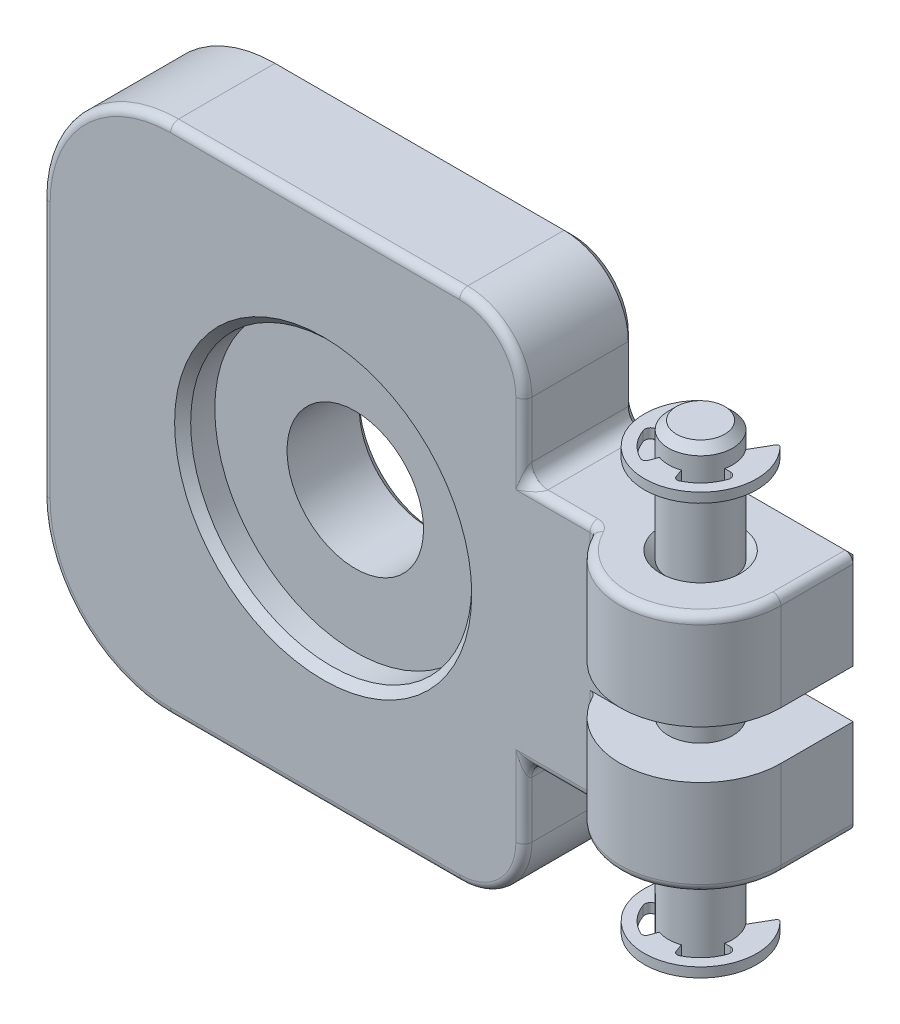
ISO-10303-21;
HEADER;
FILE_DESCRIPTION(('STEP AP214'),'2;1');
FILE_NAME('part.step','',(''),(''),'','','');
FILE_SCHEMA(('AUTOMOTIVE_DESIGN { 1 0 10303 214 1 1 1 1 }'));
ENDSEC;
DATA;
#1=APPLICATION_CONTEXT('core data for automotive mechanical design processes');
#2=APPLICATION_PROTOCOL_DEFINITION('international standard','automotive_design',2000,#1);
#3=PRODUCT_CONTEXT('',#1,'mechanical');
#4=PRODUCT('Part','Part','',(#3));
#5=PRODUCT_RELATED_PRODUCT_CATEGORY('part','',(#4));
#6=PRODUCT_DEFINITION_FORMATION('','',#4);
#7=PRODUCT_DEFINITION_CONTEXT('part definition',#1,'design');
#8=PRODUCT_DEFINITION('design','',#6,#7);
#9=PRODUCT_DEFINITION_SHAPE('','',#8);
#10=(LENGTH_UNIT() NAMED_UNIT(*) SI_UNIT(.MILLI.,.METRE.));
#11=(NAMED_UNIT(*) PLANE_ANGLE_UNIT() SI_UNIT($,.RADIAN.));
#12=(NAMED_UNIT(*) SI_UNIT($,.STERADIAN.) SOLID_ANGLE_UNIT());
#13=UNCERTAINTY_MEASURE_WITH_UNIT(LENGTH_MEASURE(1.E-05),#10,'distance_accuracy_value','');
#14=(GEOMETRIC_REPRESENTATION_CONTEXT(3) GLOBAL_UNCERTAINTY_ASSIGNED_CONTEXT((#13)) GLOBAL_UNIT_ASSIGNED_CONTEXT((#10,
#11,#12)) REPRESENTATION_CONTEXT('',''));
#15=CARTESIAN_POINT('',(0.,0.,0.));
#16=DIRECTION('',(0.,0.,1.));
#17=DIRECTION('',(1.,0.,0.));
#18=AXIS2_PLACEMENT_3D('',#15,#16,#17);
#19=CARTESIAN_POINT('',(21.500000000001,-13.1000000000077,5.70328163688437));
#20=DIRECTION('',(0.,-1.,0.));
#21=DIRECTION('',(0.,0.,-1.));
#22=AXIS2_PLACEMENT_3D('',#19,#20,#21);
#23=PLANE('',#22);
#24=DIRECTION('',(-0.5,0.,-0.866025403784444));
#25=VECTOR('',#24,1.);
#26=CARTESIAN_POINT('',(20.1997982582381,-13.1000000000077,4.25131909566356));
#27=LINE('',#26,#25);
#28=CARTESIAN_POINT('',(19.9223498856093,-13.1000000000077,3.77076441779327));
#29=VERTEX_POINT('',#28);
#30=CARTESIAN_POINT('',(19.2292739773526,-13.1000000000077,2.5703217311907));
#31=VERTEX_POINT('',#30);
#32=EDGE_CURVE('E677',#29,#31,#27,.T.);
#33=ORIENTED_EDGE('',*,*,#32,.F.);
#34=CARTESIAN_POINT('',(21.5,-13.1000000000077,5.));
#35=DIRECTION('',(0.,-1.,0.));
#36=DIRECTION('',(1.,0.,0.));
#37=AXIS2_PLACEMENT_3D('',#34,#35,#36);
#38=CIRCLE('',#37,2.);
#39=CARTESIAN_POINT('',(19.551303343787,-13.1000000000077,5.45009037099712));
#40=VERTEX_POINT('',#39);
#41=EDGE_CURVE('E9',#29,#40,#38,.F.);
#42=ORIENTED_EDGE('',*,*,#41,.T.);
#43=DIRECTION('',(0.999999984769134,0.,-0.000174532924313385));
#44=VECTOR('',#43,1.);
#45=CARTESIAN_POINT('',(19.1983607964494,-13.1000000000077,5.45015197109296));
#46=LINE('',#45,#44);
#47=CARTESIAN_POINT('',(19.1983607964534,-13.1000000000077,5.45015197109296));
#48=VERTEX_POINT('',#47);
#49=EDGE_CURVE('E531',#48,#40,#46,.T.);
#50=ORIENTED_EDGE('',*,*,#49,.F.);
#51=CARTESIAN_POINT('',(19.1984236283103,-13.1000000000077,5.81015196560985));
#52=DIRECTION('',(0.,-1.,0.));
#53=DIRECTION('',(0.,0.,-1.));
#54=AXIS2_PLACEMENT_3D('',#51,#52,#53);
#55=CIRCLE('',#54,0.36);
#56=CARTESIAN_POINT('',(18.8588467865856,-13.1000000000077,5.92968258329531));
#57=VERTEX_POINT('',#56);
#58=EDGE_CURVE('E595',#48,#57,#55,.F.);
#59=ORIENTED_EDGE('',*,*,#58,.T.);
#60=CARTESIAN_POINT('',(21.5,-13.1000000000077,5.0000000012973));
#61=DIRECTION('',(0.,-1.,0.));
#62=DIRECTION('',(0.,0.,-1.));
#63=AXIS2_PLACEMENT_3D('',#60,#61,#62);
#64=CIRCLE('',#63,2.8);
#65=CARTESIAN_POINT('',(20.2998920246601,-13.1000000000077,7.52977090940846));
#66=VERTEX_POINT('',#65);
#67=EDGE_CURVE('E600',#57,#66,#64,.F.);
#68=ORIENTED_EDGE('',*,*,#67,.T.);
#69=CARTESIAN_POINT('',(20.4027584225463,-13.1000000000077,7.31293340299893));
#70=DIRECTION('',(0.,-1.,0.));
#71=DIRECTION('',(0.,0.,-1.));
#72=AXIS2_PLACEMENT_3D('',#69,#70,#71);
#73=CIRCLE('',#72,0.24);
#74=CARTESIAN_POINT('',(20.6282846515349,-13.1000000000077,7.39501823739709));
#75=VERTEX_POINT('',#74);
#76=EDGE_CURVE('E604',#66,#75,#73,.F.);
#77=ORIENTED_EDGE('',*,*,#76,.T.);
#78=DIRECTION('',(-0.34202014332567,0.,0.939692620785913));
#79=VECTOR('',#78,1.);
#80=CARTESIAN_POINT('',(20.9869697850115,-13.1000000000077,6.40953893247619));
#81=LINE('',#80,#79);
#82=CARTESIAN_POINT('',(20.8159597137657,-13.1000000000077,6.87938524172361));
#83=VERTEX_POINT('',#82);
#84=EDGE_CURVE('E607',#83,#75,#81,.T.);
#85=ORIENTED_EDGE('',*,*,#84,.F.);
#86=CARTESIAN_POINT('',(22.1840402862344,-13.1000000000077,6.87938524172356));
#87=VERTEX_POINT('',#86);
#88=EDGE_CURVE('E24',#83,#87,#38,.F.);
#89=ORIENTED_EDGE('',*,*,#88,.T.);
#90=DIRECTION('',(-0.34202014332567,0.,-0.939692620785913));
#91=VECTOR('',#90,1.);
#92=CARTESIAN_POINT('',(22.3717153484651,-13.1000000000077,7.39501823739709));
#93=LINE('',#92,#91);
#94=CARTESIAN_POINT('',(22.3717153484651,-13.1000000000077,7.39501823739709));
#95=VERTEX_POINT('',#94);
#96=EDGE_CURVE('E664',#95,#87,#93,.T.);
#97=ORIENTED_EDGE('',*,*,#96,.F.);
#98=CARTESIAN_POINT('',(22.5972415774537,-13.1000000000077,7.31293340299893));
#99=DIRECTION('',(0.,-1.,0.));
#100=DIRECTION('',(0.,0.,-1.));
#101=AXIS2_PLACEMENT_3D('',#98,#99,#100);
#102=CIRCLE('',#101,0.24);
#103=CARTESIAN_POINT('',(22.70010797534,-13.1000000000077,7.52977090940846));
#104=VERTEX_POINT('',#103);
#105=EDGE_CURVE('E608',#95,#104,#102,.F.);
#106=ORIENTED_EDGE('',*,*,#105,.T.);
#107=CARTESIAN_POINT('',(21.5,-13.1000000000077,5.0000000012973));
#108=DIRECTION('',(0.,-1.,0.));
#109=DIRECTION('',(0.,0.,-1.));
#110=AXIS2_PLACEMENT_3D('',#107,#108,#109);
#111=CIRCLE('',#110,2.8);
#112=CARTESIAN_POINT('',(24.1411532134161,-13.1000000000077,5.9296825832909));
#113=VERTEX_POINT('',#112);
#114=EDGE_CURVE('E613',#104,#113,#111,.F.);
#115=ORIENTED_EDGE('',*,*,#114,.T.);
#116=CARTESIAN_POINT('',(23.8015763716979,-13.1000000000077,5.81015196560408));
#117=DIRECTION('',(0.,-1.,0.));
#118=DIRECTION('',(0.,0.,-1.));
#119=AXIS2_PLACEMENT_3D('',#116,#117,#118);
#120=CIRCLE('',#119,0.359999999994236);
#121=CARTESIAN_POINT('',(23.8016392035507,-13.1000000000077,5.45015197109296));
#122=VERTEX_POINT('',#121);
#123=EDGE_CURVE('E617',#113,#122,#120,.F.);
#124=ORIENTED_EDGE('',*,*,#123,.T.);
#125=DIRECTION('',(0.999999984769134,0.,0.000174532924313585));
#126=VECTOR('',#125,1.);
#127=CARTESIAN_POINT('',(23.04868865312,-13.1000000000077,5.45002055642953));
#128=LINE('',#127,#126);
#129=CARTESIAN_POINT('',(23.4486966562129,-13.1000000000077,5.45009037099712));
#130=VERTEX_POINT('',#129);
#131=EDGE_CURVE('E620',#130,#122,#128,.T.);
#132=ORIENTED_EDGE('',*,*,#131,.F.);
#133=CARTESIAN_POINT('',(23.0776501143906,-13.1000000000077,3.77076441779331));
#134=VERTEX_POINT('',#133);
#135=EDGE_CURVE('E26',#130,#134,#38,.F.);
#136=ORIENTED_EDGE('',*,*,#135,.T.);
#137=DIRECTION('',(-0.5,0.,0.866025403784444));
#138=VECTOR('',#137,1.);
#139=CARTESIAN_POINT('',(23.7707260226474,-13.1000000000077,2.57032173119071));
#140=LINE('',#139,#138);
#141=CARTESIAN_POINT('',(23.7707260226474,-13.1000000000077,2.5703217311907));
#142=VERTEX_POINT('',#141);
#143=EDGE_CURVE('E625',#142,#134,#140,.T.);
#144=ORIENTED_EDGE('',*,*,#143,.F.);
#145=CARTESIAN_POINT('',(23.8919695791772,-13.1000000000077,2.6403217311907));
#146=DIRECTION('',(0.,-1.,0.));
#147=DIRECTION('',(0.,0.,-1.));
#148=AXIS2_PLACEMENT_3D('',#145,#146,#147);
#149=CIRCLE('',#148,0.14);
#150=CARTESIAN_POINT('',(23.9916349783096,-13.1000000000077,2.54200180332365));
#151=VERTEX_POINT('',#150);
#152=EDGE_CURVE('E621',#151,#142,#149,.F.);
#153=ORIENTED_EDGE('',*,*,#152,.F.);
#154=CARTESIAN_POINT('',(21.5,-13.1000000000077,5.));
#155=DIRECTION('',(0.,-1.,0.));
#156=DIRECTION('',(0.,0.,-1.));
#157=AXIS2_PLACEMENT_3D('',#154,#155,#156);
#158=CIRCLE('',#157,3.5);
#159=CARTESIAN_POINT('',(19.0083650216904,-13.1000000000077,2.54200180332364));
#160=VERTEX_POINT('',#159);
#161=EDGE_CURVE('E626',#160,#151,#158,.F.);
#162=ORIENTED_EDGE('',*,*,#161,.F.);
#163=CARTESIAN_POINT('',(19.1080304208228,-13.1000000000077,2.64032173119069));
#164=DIRECTION('',(0.,-1.,0.));
#165=DIRECTION('',(0.,0.,-1.));
#166=AXIS2_PLACEMENT_3D('',#163,#164,#165);
#167=CIRCLE('',#166,0.139999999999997);
#168=EDGE_CURVE('E629',#31,#160,#167,.F.);
#169=ORIENTED_EDGE('',*,*,#168,.F.);
#170=EDGE_LOOP('',(#33,#42,#50,#59,#68,#77,#85,#89,#97,#106,#115,#124,#132,#136,#144,#153,#162,#169));
#171=FACE_BOUND('',#170,.T.);
#172=ADVANCED_FACE('F14',(#171),#23,.T.);
#173=CARTESIAN_POINT('',(19.1983607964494,-12.5000000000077,5.45015197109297));
#174=DIRECTION('',(0.000174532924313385,0.,0.999999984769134));
#175=DIRECTION('',(0.999999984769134,0.,-0.000174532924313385));
#176=AXIS2_PLACEMENT_3D('',#173,#174,#175);
#177=PLANE('',#176);
#178=ORIENTED_EDGE('',*,*,#49,.T.);
#179=DIRECTION('',(0.,1.,0.));
#180=VECTOR('',#179,1.);
#181=CARTESIAN_POINT('',(19.551303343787,55.5530185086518,5.45009037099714));
#182=LINE('',#181,#180);
#183=CARTESIAN_POINT('',(19.551303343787,-12.5000000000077,5.45009037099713));
#184=VERTEX_POINT('',#183);
#185=EDGE_CURVE('E18',#40,#184,#182,.T.);
#186=ORIENTED_EDGE('',*,*,#185,.T.);
#187=DIRECTION('',(-0.999999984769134,0.,0.000174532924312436));
#188=VECTOR('',#187,1.);
#189=CARTESIAN_POINT('',(19.95131134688,-12.5000000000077,5.45002055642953));
#190=LINE('',#189,#188);
#191=CARTESIAN_POINT('',(19.1983607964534,-12.5000000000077,5.45015197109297));
#192=VERTEX_POINT('',#191);
#193=EDGE_CURVE('E638',#184,#192,#190,.T.);
#194=ORIENTED_EDGE('',*,*,#193,.T.);
#195=DIRECTION('',(0.,-1.,0.));
#196=VECTOR('',#195,1.);
#197=CARTESIAN_POINT('',(19.1983607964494,-12.5000000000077,5.45015197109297));
#198=LINE('',#197,#196);
#199=EDGE_CURVE('E599',#192,#48,#198,.T.);
#200=ORIENTED_EDGE('',*,*,#199,.T.);
#201=EDGE_LOOP('',(#178,#186,#194,#200));
#202=FACE_BOUND('',#201,.T.);
#203=ADVANCED_FACE('F1810',(#202),#177,.T.);
#204=CARTESIAN_POINT('',(19.1984236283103,-12.5000000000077,5.81015196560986));
#205=DIRECTION('',(0.,-1.,0.));
#206=DIRECTION('',(0.,0.,-1.));
#207=AXIS2_PLACEMENT_3D('',#204,#205,#206);
#208=CYLINDRICAL_SURFACE('',#207,0.36);
#209=ORIENTED_EDGE('',*,*,#199,.F.);
#210=CARTESIAN_POINT('',(19.1984236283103,-12.5000000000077,5.81015196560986));
#211=DIRECTION('',(0.,-1.,0.));
#212=DIRECTION('',(0.,0.,-1.));
#213=AXIS2_PLACEMENT_3D('',#210,#211,#212);
#214=CIRCLE('',#213,0.36);
#215=CARTESIAN_POINT('',(18.8588467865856,-12.5000000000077,5.92968258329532));
#216=VERTEX_POINT('',#215);
#217=EDGE_CURVE('E634',#192,#216,#214,.F.);
#218=ORIENTED_EDGE('',*,*,#217,.T.);
#219=DIRECTION('',(0.,-1.,0.));
#220=VECTOR('',#219,1.);
#221=CARTESIAN_POINT('',(18.8588467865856,-12.5000000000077,5.92968258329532));
#222=LINE('',#221,#220);
#223=EDGE_CURVE('E598',#216,#57,#222,.T.);
#224=ORIENTED_EDGE('',*,*,#223,.T.);
#225=ORIENTED_EDGE('',*,*,#58,.F.);
#226=EDGE_LOOP('',(#209,#218,#224,#225));
#227=FACE_BOUND('',#226,.T.);
#228=ADVANCED_FACE('F1821',(#227),#208,.F.);
#229=CARTESIAN_POINT('',(21.5,-12.5000000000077,5.00000000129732));
#230=DIRECTION('',(0.,-1.,0.));
#231=DIRECTION('',(0.,0.,-1.));
#232=AXIS2_PLACEMENT_3D('',#229,#230,#231);
#233=CYLINDRICAL_SURFACE('',#232,2.8);
#234=ORIENTED_EDGE('',*,*,#223,.F.);
#235=CARTESIAN_POINT('',(21.5,-12.5000000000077,5.00000000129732));
#236=DIRECTION('',(0.,-1.,0.));
#237=DIRECTION('',(0.,0.,-1.));
#238=AXIS2_PLACEMENT_3D('',#235,#236,#237);
#239=CIRCLE('',#238,2.8);
#240=CARTESIAN_POINT('',(20.2998920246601,-12.5000000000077,7.52977090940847));
#241=VERTEX_POINT('',#240);
#242=EDGE_CURVE('E637',#216,#241,#239,.F.);
#243=ORIENTED_EDGE('',*,*,#242,.T.);
#244=DIRECTION('',(0.,-1.,0.));
#245=VECTOR('',#244,1.);
#246=CARTESIAN_POINT('',(20.2998920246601,-12.5000000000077,7.52977090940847));
#247=LINE('',#246,#245);
#248=EDGE_CURVE('E603',#241,#66,#247,.T.);
#249=ORIENTED_EDGE('',*,*,#248,.T.);
#250=ORIENTED_EDGE('',*,*,#67,.F.);
#251=EDGE_LOOP('',(#234,#243,#249,#250));
#252=FACE_BOUND('',#251,.T.);
#253=ADVANCED_FACE('F1832',(#252),#233,.F.);
#254=CARTESIAN_POINT('',(20.4027584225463,-12.5000000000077,7.31293340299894));
#255=DIRECTION('',(0.,-1.,0.));
#256=DIRECTION('',(0.,0.,-1.));
#257=AXIS2_PLACEMENT_3D('',#254,#255,#256);
#258=CYLINDRICAL_SURFACE('',#257,0.24);
#259=ORIENTED_EDGE('',*,*,#248,.F.);
#260=CARTESIAN_POINT('',(20.4027584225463,-12.5000000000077,7.31293340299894));
#261=DIRECTION('',(0.,-1.,0.));
#262=DIRECTION('',(0.,0.,-1.));
#263=AXIS2_PLACEMENT_3D('',#260,#261,#262);
#264=CIRCLE('',#263,0.24);
#265=CARTESIAN_POINT('',(20.6282846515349,-12.5000000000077,7.3950182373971));
#266=VERTEX_POINT('',#265);
#267=EDGE_CURVE('E641',#241,#266,#264,.F.);
#268=ORIENTED_EDGE('',*,*,#267,.T.);
#269=DIRECTION('',(0.,1.,0.));
#270=VECTOR('',#269,1.);
#271=CARTESIAN_POINT('',(20.6282846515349,-12.5000000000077,7.3950182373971));
#272=LINE('',#271,#270);
#273=EDGE_CURVE('E663',#75,#266,#272,.T.);
#274=ORIENTED_EDGE('',*,*,#273,.F.);
#275=ORIENTED_EDGE('',*,*,#76,.F.);
#276=EDGE_LOOP('',(#259,#268,#274,#275));
#277=FACE_BOUND('',#276,.T.);
#278=ADVANCED_FACE('F1842',(#277),#258,.F.);
#279=CARTESIAN_POINT('',(20.9869697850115,-12.5000000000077,6.40953893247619));
#280=DIRECTION('',(-0.939692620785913,0.,-0.34202014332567));
#281=DIRECTION('',(-0.34202014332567,0.,0.939692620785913));
#282=AXIS2_PLACEMENT_3D('',#279,#280,#281);
#283=PLANE('',#282);
#284=DIRECTION('',(0.342020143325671,0.,-0.939692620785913));
#285=VECTOR('',#284,1.);
#286=CARTESIAN_POINT('',(20.6282846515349,-12.5000000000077,7.3950182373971));
#287=LINE('',#286,#285);
#288=CARTESIAN_POINT('',(20.8159597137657,-12.5000000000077,6.87938524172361));
#289=VERTEX_POINT('',#288);
#290=EDGE_CURVE('E644',#266,#289,#287,.T.);
#291=ORIENTED_EDGE('',*,*,#290,.T.);
#292=DIRECTION('',(0.,1.,0.));
#293=VECTOR('',#292,1.);
#294=CARTESIAN_POINT('',(20.8159597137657,55.5530185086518,6.87938524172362));
#295=LINE('',#294,#293);
#296=EDGE_CURVE('E552',#289,#83,#295,.F.);
#297=ORIENTED_EDGE('',*,*,#296,.T.);
#298=ORIENTED_EDGE('',*,*,#84,.T.);
#299=ORIENTED_EDGE('',*,*,#273,.T.);
#300=EDGE_LOOP('',(#291,#297,#298,#299));
#301=FACE_BOUND('',#300,.T.);
#302=ADVANCED_FACE('F1852',(#301),#283,.T.);
#303=CARTESIAN_POINT('',(22.3717153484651,-12.5000000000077,7.3950182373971));
#304=DIRECTION('',(0.939692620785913,0.,-0.34202014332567));
#305=DIRECTION('',(-0.34202014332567,0.,-0.939692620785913));
#306=AXIS2_PLACEMENT_3D('',#303,#304,#305);
#307=PLANE('',#306);
#308=ORIENTED_EDGE('',*,*,#96,.T.);
#309=DIRECTION('',(0.,1.,0.));
#310=VECTOR('',#309,1.);
#311=CARTESIAN_POINT('',(22.1840402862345,55.5530185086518,6.87938524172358));
#312=LINE('',#311,#310);
#313=CARTESIAN_POINT('',(22.1840402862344,-12.5000000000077,6.87938524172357));
#314=VERTEX_POINT('',#313);
#315=EDGE_CURVE('E548',#87,#314,#312,.T.);
#316=ORIENTED_EDGE('',*,*,#315,.T.);
#317=DIRECTION('',(0.342020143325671,0.,0.939692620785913));
#318=VECTOR('',#317,1.);
#319=CARTESIAN_POINT('',(22.0130302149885,-12.5000000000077,6.40953893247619));
#320=LINE('',#319,#318);
#321=CARTESIAN_POINT('',(22.3717153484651,-12.5000000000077,7.3950182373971));
#322=VERTEX_POINT('',#321);
#323=EDGE_CURVE('E649',#314,#322,#320,.T.);
#324=ORIENTED_EDGE('',*,*,#323,.T.);
#325=DIRECTION('',(0.,-1.,0.));
#326=VECTOR('',#325,1.);
#327=CARTESIAN_POINT('',(22.3717153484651,-12.5000000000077,7.3950182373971));
#328=LINE('',#327,#326);
#329=EDGE_CURVE('E612',#322,#95,#328,.T.);
#330=ORIENTED_EDGE('',*,*,#329,.T.);
#331=EDGE_LOOP('',(#308,#316,#324,#330));
#332=FACE_BOUND('',#331,.T.);
#333=ADVANCED_FACE('F1862',(#332),#307,.T.);
#334=CARTESIAN_POINT('',(22.5972415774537,-12.5000000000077,7.31293340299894));
#335=DIRECTION('',(0.,-1.,0.));
#336=DIRECTION('',(0.,0.,-1.));
#337=AXIS2_PLACEMENT_3D('',#334,#335,#336);
#338=CYLINDRICAL_SURFACE('',#337,0.24);
#339=ORIENTED_EDGE('',*,*,#329,.F.);
#340=CARTESIAN_POINT('',(22.5972415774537,-12.5000000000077,7.31293340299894));
#341=DIRECTION('',(0.,-1.,0.));
#342=DIRECTION('',(0.,0.,-1.));
#343=AXIS2_PLACEMENT_3D('',#340,#341,#342);
#344=CIRCLE('',#343,0.24);
#345=CARTESIAN_POINT('',(22.70010797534,-12.5000000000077,7.52977090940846));
#346=VERTEX_POINT('',#345);
#347=EDGE_CURVE('E645',#322,#346,#344,.F.);
#348=ORIENTED_EDGE('',*,*,#347,.T.);
#349=DIRECTION('',(0.,-1.,0.));
#350=VECTOR('',#349,1.);
#351=CARTESIAN_POINT('',(22.70010797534,-12.5000000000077,7.52977090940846));
#352=LINE('',#351,#350);
#353=EDGE_CURVE('E611',#346,#104,#352,.T.);
#354=ORIENTED_EDGE('',*,*,#353,.T.);
#355=ORIENTED_EDGE('',*,*,#105,.F.);
#356=EDGE_LOOP('',(#339,#348,#354,#355));
#357=FACE_BOUND('',#356,.T.);
#358=ADVANCED_FACE('F1872',(#357),#338,.F.);
#359=CARTESIAN_POINT('',(21.5,-12.5000000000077,5.00000000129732));
#360=DIRECTION('',(0.,-1.,0.));
#361=DIRECTION('',(0.,0.,-1.));
#362=AXIS2_PLACEMENT_3D('',#359,#360,#361);
#363=CYLINDRICAL_SURFACE('',#362,2.8);
#364=ORIENTED_EDGE('',*,*,#353,.F.);
#365=CARTESIAN_POINT('',(21.5,-12.5000000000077,5.00000000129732));
#366=DIRECTION('',(0.,-1.,0.));
#367=DIRECTION('',(0.,0.,-1.));
#368=AXIS2_PLACEMENT_3D('',#365,#366,#367);
#369=CIRCLE('',#368,2.8);
#370=CARTESIAN_POINT('',(24.1411532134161,-12.5000000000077,5.92968258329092));
#371=VERTEX_POINT('',#370);
#372=EDGE_CURVE('E648',#346,#371,#369,.F.);
#373=ORIENTED_EDGE('',*,*,#372,.T.);
#374=DIRECTION('',(0.,-1.,0.));
#375=VECTOR('',#374,1.);
#376=CARTESIAN_POINT('',(24.1411532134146,-12.5000000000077,5.92968258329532));
#377=LINE('',#376,#375);
#378=EDGE_CURVE('E616',#371,#113,#377,.T.);
#379=ORIENTED_EDGE('',*,*,#378,.T.);
#380=ORIENTED_EDGE('',*,*,#114,.F.);
#381=EDGE_LOOP('',(#364,#373,#379,#380));
#382=FACE_BOUND('',#381,.T.);
#383=ADVANCED_FACE('F1882',(#382),#363,.F.);
#384=CARTESIAN_POINT('',(23.8015763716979,-12.5000000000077,5.81015196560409));
#385=DIRECTION('',(0.,-1.,0.));
#386=DIRECTION('',(0.,0.,-1.));
#387=AXIS2_PLACEMENT_3D('',#384,#385,#386);
#388=CYLINDRICAL_SURFACE('',#387,0.359999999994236);
#389=ORIENTED_EDGE('',*,*,#378,.F.);
#390=CARTESIAN_POINT('',(23.8015763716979,-12.5000000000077,5.81015196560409));
#391=DIRECTION('',(0.,-1.,0.));
#392=DIRECTION('',(0.,0.,-1.));
#393=AXIS2_PLACEMENT_3D('',#390,#391,#392);
#394=CIRCLE('',#393,0.359999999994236);
#395=CARTESIAN_POINT('',(23.8016392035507,-12.5000000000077,5.45015197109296));
#396=VERTEX_POINT('',#395);
#397=EDGE_CURVE('E652',#371,#396,#394,.F.);
#398=ORIENTED_EDGE('',*,*,#397,.T.);
#399=DIRECTION('',(0.,1.,0.));
#400=VECTOR('',#399,1.);
#401=CARTESIAN_POINT('',(23.8016392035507,-12.5000000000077,5.45015197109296));
#402=LINE('',#401,#400);
#403=EDGE_CURVE('E669',#122,#396,#402,.T.);
#404=ORIENTED_EDGE('',*,*,#403,.F.);
#405=ORIENTED_EDGE('',*,*,#123,.F.);
#406=EDGE_LOOP('',(#389,#398,#404,#405));
#407=FACE_BOUND('',#406,.T.);
#408=ADVANCED_FACE('F1892',(#407),#388,.F.);
#409=CARTESIAN_POINT('',(23.04868865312,-12.5000000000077,5.45002055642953));
#410=DIRECTION('',(-0.000174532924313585,0.,0.999999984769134));
#411=DIRECTION('',(0.999999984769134,0.,0.000174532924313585));
#412=AXIS2_PLACEMENT_3D('',#409,#410,#411);
#413=PLANE('',#412);
#414=DIRECTION('',(-0.999999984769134,0.,-0.000174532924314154));
#415=VECTOR('',#414,1.);
#416=CARTESIAN_POINT('',(23.8016392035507,-12.5000000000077,5.45015197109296));
#417=LINE('',#416,#415);
#418=CARTESIAN_POINT('',(23.4486966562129,-12.5000000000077,5.45009037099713));
#419=VERTEX_POINT('',#418);
#420=EDGE_CURVE('E589',#396,#419,#417,.T.);
#421=ORIENTED_EDGE('',*,*,#420,.T.);
#422=DIRECTION('',(0.,1.,0.));
#423=VECTOR('',#422,1.);
#424=CARTESIAN_POINT('',(23.448696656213,55.5530185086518,5.45009037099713));
#425=LINE('',#424,#423);
#426=EDGE_CURVE('E545',#419,#130,#425,.F.);
#427=ORIENTED_EDGE('',*,*,#426,.T.);
#428=ORIENTED_EDGE('',*,*,#131,.T.);
#429=ORIENTED_EDGE('',*,*,#403,.T.);
#430=EDGE_LOOP('',(#421,#427,#428,#429));
#431=FACE_BOUND('',#430,.T.);
#432=ADVANCED_FACE('F1902',(#431),#413,.T.);
#433=CARTESIAN_POINT('',(23.7707260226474,-12.5000000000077,2.57032173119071));
#434=DIRECTION('',(-0.866025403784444,0.,-0.5));
#435=DIRECTION('',(-0.5,0.,0.866025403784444));
#436=AXIS2_PLACEMENT_3D('',#433,#434,#435);
#437=PLANE('',#436);
#438=ORIENTED_EDGE('',*,*,#143,.T.);
#439=DIRECTION('',(0.,1.,0.));
#440=VECTOR('',#439,1.);
#441=CARTESIAN_POINT('',(23.0776501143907,55.5530185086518,3.77076441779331));
#442=LINE('',#441,#440);
#443=CARTESIAN_POINT('',(23.0776501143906,-12.5000000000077,3.77076441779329));
#444=VERTEX_POINT('',#443);
#445=EDGE_CURVE('E542',#134,#444,#442,.T.);
#446=ORIENTED_EDGE('',*,*,#445,.T.);
#447=DIRECTION('',(0.5,0.,-0.866025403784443));
#448=VECTOR('',#447,1.);
#449=CARTESIAN_POINT('',(22.8002017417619,-12.5000000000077,4.25131909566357));
#450=LINE('',#449,#448);
#451=CARTESIAN_POINT('',(23.7707260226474,-12.5000000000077,2.57032173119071));
#452=VERTEX_POINT('',#451);
#453=EDGE_CURVE('E591',#444,#452,#450,.T.);
#454=ORIENTED_EDGE('',*,*,#453,.T.);
#455=DIRECTION('',(0.,-1.,0.));
#456=VECTOR('',#455,1.);
#457=CARTESIAN_POINT('',(23.7707260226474,-12.5000000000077,2.57032173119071));
#458=LINE('',#457,#456);
#459=EDGE_CURVE('E624',#142,#452,#458,.F.);
#460=ORIENTED_EDGE('',*,*,#459,.F.);
#461=EDGE_LOOP('',(#438,#446,#454,#460));
#462=FACE_BOUND('',#461,.T.);
#463=ADVANCED_FACE('F1912',(#462),#437,.T.);
#464=CARTESIAN_POINT('',(23.8919695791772,-12.5000000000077,2.64032173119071));
#465=DIRECTION('',(0.,-1.,0.));
#466=DIRECTION('',(0.,0.,-1.));
#467=AXIS2_PLACEMENT_3D('',#464,#465,#466);
#468=CYLINDRICAL_SURFACE('',#467,0.14);
#469=CARTESIAN_POINT('',(23.8919695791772,-12.5000000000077,2.64032173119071));
#470=DIRECTION('',(0.,-1.,0.));
#471=DIRECTION('',(0.,0.,-1.));
#472=AXIS2_PLACEMENT_3D('',#469,#470,#471);
#473=CIRCLE('',#472,0.14);
#474=CARTESIAN_POINT('',(23.9916349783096,-12.5000000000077,2.54200180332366));
#475=VERTEX_POINT('',#474);
#476=EDGE_CURVE('E594',#452,#475,#473,.T.);
#477=ORIENTED_EDGE('',*,*,#476,.T.);
#478=DIRECTION('',(0.,-1.,0.));
#479=VECTOR('',#478,1.);
#480=CARTESIAN_POINT('',(23.9916349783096,-12.5000000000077,2.54200180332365));
#481=LINE('',#480,#479);
#482=EDGE_CURVE('E630',#151,#475,#481,.F.);
#483=ORIENTED_EDGE('',*,*,#482,.F.);
#484=ORIENTED_EDGE('',*,*,#152,.T.);
#485=ORIENTED_EDGE('',*,*,#459,.T.);
#486=EDGE_LOOP('',(#477,#483,#484,#485));
#487=FACE_BOUND('',#486,.T.);
#488=ADVANCED_FACE('F1922',(#487),#468,.T.);
#489=CARTESIAN_POINT('',(21.5,-12.5000000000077,5.));
#490=DIRECTION('',(0.,-1.,0.));
#491=DIRECTION('',(0.,0.,-1.));
#492=AXIS2_PLACEMENT_3D('',#489,#490,#491);
#493=CYLINDRICAL_SURFACE('',#492,3.5);
#494=DIRECTION('',(0.,-1.,0.));
#495=VECTOR('',#494,1.);
#496=CARTESIAN_POINT('',(19.0083650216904,-12.5000000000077,2.54200180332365));
#497=LINE('',#496,#495);
#498=CARTESIAN_POINT('',(19.0083650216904,-12.5000000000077,2.54200180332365));
#499=VERTEX_POINT('',#498);
#500=EDGE_CURVE('E633',#160,#499,#497,.F.);
#501=ORIENTED_EDGE('',*,*,#500,.F.);
#502=ORIENTED_EDGE('',*,*,#161,.T.);
#503=ORIENTED_EDGE('',*,*,#482,.T.);
#504=CARTESIAN_POINT('',(21.5,-12.5000000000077,5.));
#505=DIRECTION('',(0.,-1.,0.));
#506=DIRECTION('',(0.,0.,-1.));
#507=AXIS2_PLACEMENT_3D('',#504,#505,#506);
#508=CIRCLE('',#507,3.5);
#509=EDGE_CURVE('E582',#475,#499,#508,.T.);
#510=ORIENTED_EDGE('',*,*,#509,.T.);
#511=EDGE_LOOP('',(#501,#502,#503,#510));
#512=FACE_BOUND('',#511,.T.);
#513=ADVANCED_FACE('F1932',(#512),#493,.T.);
#514=CARTESIAN_POINT('',(19.1080304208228,-12.5000000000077,2.64032173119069));
#515=DIRECTION('',(0.,-1.,0.));
#516=DIRECTION('',(0.,0.,-1.));
#517=AXIS2_PLACEMENT_3D('',#514,#515,#516);
#518=CYLINDRICAL_SURFACE('',#517,0.139999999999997);
#519=CARTESIAN_POINT('',(19.1080304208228,-12.5000000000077,2.64032173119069));
#520=DIRECTION('',(0.,-1.,0.));
#521=DIRECTION('',(0.,0.,-1.));
#522=AXIS2_PLACEMENT_3D('',#519,#520,#521);
#523=CIRCLE('',#522,0.139999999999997);
#524=CARTESIAN_POINT('',(19.2292739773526,-12.5000000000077,2.5703217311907));
#525=VERTEX_POINT('',#524);
#526=EDGE_CURVE('E576',#499,#525,#523,.T.);
#527=ORIENTED_EDGE('',*,*,#526,.T.);
#528=DIRECTION('',(0.,1.,0.));
#529=VECTOR('',#528,1.);
#530=CARTESIAN_POINT('',(19.2292739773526,-12.5000000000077,2.57032173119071));
#531=LINE('',#530,#529);
#532=EDGE_CURVE('E679',#31,#525,#531,.T.);
#533=ORIENTED_EDGE('',*,*,#532,.F.);
#534=ORIENTED_EDGE('',*,*,#168,.T.);
#535=ORIENTED_EDGE('',*,*,#500,.T.);
#536=EDGE_LOOP('',(#527,#533,#534,#535));
#537=FACE_BOUND('',#536,.T.);
#538=ADVANCED_FACE('F1942',(#537),#518,.T.);
#539=CARTESIAN_POINT('',(20.1997982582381,-12.5000000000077,4.25131909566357));
#540=DIRECTION('',(0.866025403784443,0.,-0.5));
#541=DIRECTION('',(-0.5,0.,-0.866025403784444));
#542=AXIS2_PLACEMENT_3D('',#539,#540,#541);
#543=PLANE('',#542);
#544=DIRECTION('',(0.5,0.,0.866025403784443));
#545=VECTOR('',#544,1.);
#546=CARTESIAN_POINT('',(19.2292739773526,-12.5000000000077,2.57032173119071));
#547=LINE('',#546,#545);
#548=CARTESIAN_POINT('',(19.9223498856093,-12.5000000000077,3.77076441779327));
#549=VERTEX_POINT('',#548);
#550=EDGE_CURVE('E570',#525,#549,#547,.T.);
#551=ORIENTED_EDGE('',*,*,#550,.T.);
#552=DIRECTION('',(0.,1.,0.));
#553=VECTOR('',#552,1.);
#554=CARTESIAN_POINT('',(19.9223498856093,55.5530185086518,3.77076441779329));
#555=LINE('',#554,#553);
#556=EDGE_CURVE('E546',#549,#29,#555,.F.);
#557=ORIENTED_EDGE('',*,*,#556,.T.);
#558=ORIENTED_EDGE('',*,*,#32,.T.);
#559=ORIENTED_EDGE('',*,*,#532,.T.);
#560=EDGE_LOOP('',(#551,#557,#558,#559));
#561=FACE_BOUND('',#560,.T.);
#562=ADVANCED_FACE('F891',(#561),#543,.T.);
#563=CARTESIAN_POINT('',(21.500000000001,-12.5000000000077,5.70328163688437));
#564=DIRECTION('',(0.,-1.,0.));
#565=DIRECTION('',(0.,0.,-1.));
#566=AXIS2_PLACEMENT_3D('',#563,#564,#565);
#567=PLANE('',#566);
#568=CARTESIAN_POINT('',(21.5,-12.5000000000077,5.));
#569=DIRECTION('',(0.,-1.,0.));
#570=DIRECTION('',(1.,0.,0.));
#571=AXIS2_PLACEMENT_3D('',#568,#569,#570);
#572=CIRCLE('',#571,2.);
#573=EDGE_CURVE('E554',#549,#184,#572,.F.);
#574=ORIENTED_EDGE('',*,*,#573,.F.);
#575=ORIENTED_EDGE('',*,*,#550,.F.);
#576=ORIENTED_EDGE('',*,*,#526,.F.);
#577=ORIENTED_EDGE('',*,*,#509,.F.);
#578=ORIENTED_EDGE('',*,*,#476,.F.);
#579=ORIENTED_EDGE('',*,*,#453,.F.);
#580=EDGE_CURVE('E562',#419,#444,#572,.F.);
#581=ORIENTED_EDGE('',*,*,#580,.F.);
#582=ORIENTED_EDGE('',*,*,#420,.F.);
#583=ORIENTED_EDGE('',*,*,#397,.F.);
#584=ORIENTED_EDGE('',*,*,#372,.F.);
#585=ORIENTED_EDGE('',*,*,#347,.F.);
#586=ORIENTED_EDGE('',*,*,#323,.F.);
#587=EDGE_CURVE('E560',#289,#314,#572,.F.);
#588=ORIENTED_EDGE('',*,*,#587,.F.);
#589=ORIENTED_EDGE('',*,*,#290,.F.);
#590=ORIENTED_EDGE('',*,*,#267,.F.);
#591=ORIENTED_EDGE('',*,*,#242,.F.);
#592=ORIENTED_EDGE('',*,*,#217,.F.);
#593=ORIENTED_EDGE('',*,*,#193,.F.);
#594=EDGE_LOOP('',(#574,#575,#576,#577,#578,#579,#581,#582,#583,#584,#585,#586,#588,#589,#590,
#591,#592,#593));
#595=FACE_BOUND('',#594,.T.);
#596=ADVANCED_FACE('F880',(#595),#567,.F.);
#597=CARTESIAN_POINT('',(21.5,14.5,5.));
#598=DIRECTION('',(0.,-1.,0.));
#599=DIRECTION('',(1.,0.,0.));
#600=AXIS2_PLACEMENT_3D('',#597,#598,#599);
#601=PLANE('',#600);
#602=CARTESIAN_POINT('',(21.5,14.5,5.));
#603=DIRECTION('',(0.,-1.,0.));
#604=DIRECTION('',(1.,0.,0.));
#605=AXIS2_PLACEMENT_3D('',#602,#603,#604);
#606=CIRCLE('',#605,1.5);
#607=CARTESIAN_POINT('',(23.,14.5,5.));
#608=VERTEX_POINT('',#607);
#609=EDGE_CURVE('E520',#608,#608,#606,.F.);
#610=ORIENTED_EDGE('',*,*,#609,.T.);
#611=EDGE_LOOP('',(#610));
#612=FACE_BOUND('',#611,.T.);
#613=ADVANCED_FACE('F877',(#612),#601,.F.);
#614=CARTESIAN_POINT('',(19.1080304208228,13.1,2.6403217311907));
#615=DIRECTION('',(0.,-1.,0.));
#616=DIRECTION('',(0.,0.,-1.));
#617=AXIS2_PLACEMENT_3D('',#614,#615,#616);
#618=CYLINDRICAL_SURFACE('',#617,0.139999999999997);
#619=CARTESIAN_POINT('',(19.1080304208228,13.1,2.6403217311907));
#620=DIRECTION('',(0.,-1.,0.));
#621=DIRECTION('',(0.,0.,-1.));
#622=AXIS2_PLACEMENT_3D('',#619,#620,#621);
#623=CIRCLE('',#622,0.139999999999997);
#624=CARTESIAN_POINT('',(19.0083650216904,13.1,2.54200180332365));
#625=VERTEX_POINT('',#624);
#626=CARTESIAN_POINT('',(19.2292739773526,13.1,2.5703217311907));
#627=VERTEX_POINT('',#626);
#628=EDGE_CURVE('E684',#625,#627,#623,.T.);
#629=ORIENTED_EDGE('',*,*,#628,.T.);
#630=DIRECTION('',(0.,1.,0.));
#631=VECTOR('',#630,1.);
#632=CARTESIAN_POINT('',(19.2292739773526,13.1,2.57032173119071));
#633=LINE('',#632,#631);
#634=CARTESIAN_POINT('',(19.2292739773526,12.5,2.57032173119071));
#635=VERTEX_POINT('',#634);
#636=EDGE_CURVE('E703',#635,#627,#633,.T.);
#637=ORIENTED_EDGE('',*,*,#636,.F.);
#638=CARTESIAN_POINT('',(19.1080304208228,12.5,2.64032173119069));
#639=DIRECTION('',(0.,-1.,0.));
#640=DIRECTION('',(0.,0.,-1.));
#641=AXIS2_PLACEMENT_3D('',#638,#639,#640);
#642=CIRCLE('',#641,0.139999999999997);
#643=CARTESIAN_POINT('',(19.0083650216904,12.5,2.54200180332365));
#644=VERTEX_POINT('',#643);
#645=EDGE_CURVE('E760',#635,#644,#642,.F.);
#646=ORIENTED_EDGE('',*,*,#645,.T.);
#647=DIRECTION('',(0.,-1.,0.));
#648=VECTOR('',#647,1.);
#649=CARTESIAN_POINT('',(19.0083650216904,13.1,2.54200180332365));
#650=LINE('',#649,#648);
#651=EDGE_CURVE('E704',#644,#625,#650,.F.);
#652=ORIENTED_EDGE('',*,*,#651,.T.);
#653=EDGE_LOOP('',(#629,#637,#646,#652));
#654=FACE_BOUND('',#653,.T.);
#655=ADVANCED_FACE('F879',(#654),#618,.T.);
#656=CARTESIAN_POINT('',(21.5,13.1,5.));
#657=DIRECTION('',(0.,-1.,0.));
#658=DIRECTION('',(0.,0.,-1.));
#659=AXIS2_PLACEMENT_3D('',#656,#657,#658);
#660=CYLINDRICAL_SURFACE('',#659,3.5);
#661=ORIENTED_EDGE('',*,*,#651,.F.);
#662=CARTESIAN_POINT('',(21.5,12.5,5.));
#663=DIRECTION('',(0.,-1.,0.));
#664=DIRECTION('',(0.,0.,-1.));
#665=AXIS2_PLACEMENT_3D('',#662,#663,#664);
#666=CIRCLE('',#665,3.5);
#667=CARTESIAN_POINT('',(23.9916349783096,12.5,2.54200180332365));
#668=VERTEX_POINT('',#667);
#669=EDGE_CURVE('E762',#644,#668,#666,.F.);
#670=ORIENTED_EDGE('',*,*,#669,.T.);
#671=DIRECTION('',(0.,-1.,0.));
#672=VECTOR('',#671,1.);
#673=CARTESIAN_POINT('',(23.9916349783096,13.1,2.54200180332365));
#674=LINE('',#673,#672);
#675=CARTESIAN_POINT('',(23.9916349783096,13.1,2.54200180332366));
#676=VERTEX_POINT('',#675);
#677=EDGE_CURVE('E764',#668,#676,#674,.F.);
#678=ORIENTED_EDGE('',*,*,#677,.T.);
#679=CARTESIAN_POINT('',(21.5,13.1,5.));
#680=DIRECTION('',(0.,-1.,0.));
#681=DIRECTION('',(0.,0.,-1.));
#682=AXIS2_PLACEMENT_3D('',#679,#680,#681);
#683=CIRCLE('',#682,3.5);
#684=EDGE_CURVE('E735',#676,#625,#683,.T.);
#685=ORIENTED_EDGE('',*,*,#684,.T.);
#686=EDGE_LOOP('',(#661,#670,#678,#685));
#687=FACE_BOUND('',#686,.T.);
#688=ADVANCED_FACE('F888',(#687),#660,.T.);
#689=CARTESIAN_POINT('',(23.8919695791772,13.1,2.64032173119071));
#690=DIRECTION('',(0.,-1.,0.));
#691=DIRECTION('',(0.,0.,-1.));
#692=AXIS2_PLACEMENT_3D('',#689,#690,#691);
#693=CYLINDRICAL_SURFACE('',#692,0.14);
#694=CARTESIAN_POINT('',(23.8919695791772,13.1,2.64032173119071));
#695=DIRECTION('',(0.,-1.,0.));
#696=DIRECTION('',(0.,0.,-1.));
#697=AXIS2_PLACEMENT_3D('',#694,#695,#696);
#698=CIRCLE('',#697,0.14);
#699=CARTESIAN_POINT('',(23.7707260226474,13.1,2.57032173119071));
#700=VERTEX_POINT('',#699);
#701=EDGE_CURVE('E695',#700,#676,#698,.T.);
#702=ORIENTED_EDGE('',*,*,#701,.T.);
#703=ORIENTED_EDGE('',*,*,#677,.F.);
#704=CARTESIAN_POINT('',(23.8919695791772,12.5,2.64032173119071));
#705=DIRECTION('',(0.,-1.,0.));
#706=DIRECTION('',(0.,0.,-1.));
#707=AXIS2_PLACEMENT_3D('',#704,#705,#706);
#708=CIRCLE('',#707,0.14);
#709=CARTESIAN_POINT('',(23.7707260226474,12.5,2.57032173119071));
#710=VERTEX_POINT('',#709);
#711=EDGE_CURVE('E714',#668,#710,#708,.F.);
#712=ORIENTED_EDGE('',*,*,#711,.T.);
#713=DIRECTION('',(0.,-1.,0.));
#714=VECTOR('',#713,1.);
#715=CARTESIAN_POINT('',(23.7707260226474,13.1,2.57032173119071));
#716=LINE('',#715,#714);
#717=EDGE_CURVE('E766',#710,#700,#716,.F.);
#718=ORIENTED_EDGE('',*,*,#717,.T.);
#719=EDGE_LOOP('',(#702,#703,#712,#718));
#720=FACE_BOUND('',#719,.T.);
#721=ADVANCED_FACE('F2019',(#720),#693,.T.);
#722=CARTESIAN_POINT('',(23.8015763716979,13.1,5.81015196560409));
#723=DIRECTION('',(0.,-1.,0.));
#724=DIRECTION('',(0.,0.,-1.));
#725=AXIS2_PLACEMENT_3D('',#722,#723,#724);
#726=CYLINDRICAL_SURFACE('',#725,0.359999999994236);
#727=DIRECTION('',(0.,-1.,0.));
#728=VECTOR('',#727,1.);
#729=CARTESIAN_POINT('',(24.1411532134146,13.1,5.92968258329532));
#730=LINE('',#729,#728);
#731=CARTESIAN_POINT('',(24.1411532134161,13.1,5.92968258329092));
#732=VERTEX_POINT('',#731);
#733=CARTESIAN_POINT('',(24.1411532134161,12.5,5.92968258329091));
#734=VERTEX_POINT('',#733);
#735=EDGE_CURVE('E769',#732,#734,#730,.T.);
#736=ORIENTED_EDGE('',*,*,#735,.F.);
#737=CARTESIAN_POINT('',(23.8015763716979,13.1,5.81015196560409));
#738=DIRECTION('',(0.,-1.,0.));
#739=DIRECTION('',(0.,0.,-1.));
#740=AXIS2_PLACEMENT_3D('',#737,#738,#739);
#741=CIRCLE('',#740,0.359999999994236);
#742=CARTESIAN_POINT('',(23.8016392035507,13.1,5.45015197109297));
#743=VERTEX_POINT('',#742);
#744=EDGE_CURVE('E739',#732,#743,#741,.F.);
#745=ORIENTED_EDGE('',*,*,#744,.T.);
#746=DIRECTION('',(0.,1.,0.));
#747=VECTOR('',#746,1.);
#748=CARTESIAN_POINT('',(23.8016392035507,13.1,5.45015197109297));
#749=LINE('',#748,#747);
#750=CARTESIAN_POINT('',(23.8016392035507,12.5,5.45015197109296));
#751=VERTEX_POINT('',#750);
#752=EDGE_CURVE('E715',#751,#743,#749,.T.);
#753=ORIENTED_EDGE('',*,*,#752,.F.);
#754=CARTESIAN_POINT('',(23.8015763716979,12.5,5.81015196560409));
#755=DIRECTION('',(0.,-1.,0.));
#756=DIRECTION('',(0.,0.,-1.));
#757=AXIS2_PLACEMENT_3D('',#754,#755,#756);
#758=CIRCLE('',#757,0.359999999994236);
#759=EDGE_CURVE('E720',#734,#751,#758,.F.);
#760=ORIENTED_EDGE('',*,*,#759,.F.);
#761=EDGE_LOOP('',(#736,#745,#753,#760));
#762=FACE_BOUND('',#761,.T.);
#763=ADVANCED_FACE('F827',(#762),#726,.F.);
#764=CARTESIAN_POINT('',(21.5,13.1,5.00000000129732));
#765=DIRECTION('',(0.,-1.,0.));
#766=DIRECTION('',(0.,0.,-1.));
#767=AXIS2_PLACEMENT_3D('',#764,#765,#766);
#768=CYLINDRICAL_SURFACE('',#767,2.8);
#769=DIRECTION('',(0.,-1.,0.));
#770=VECTOR('',#769,1.);
#771=CARTESIAN_POINT('',(22.70010797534,13.1,7.52977090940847));
#772=LINE('',#771,#770);
#773=CARTESIAN_POINT('',(22.70010797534,13.1,7.52977090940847));
#774=VERTEX_POINT('',#773);
#775=CARTESIAN_POINT('',(22.70010797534,12.5,7.52977090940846));
#776=VERTEX_POINT('',#775);
#777=EDGE_CURVE('E772',#774,#776,#772,.T.);
#778=ORIENTED_EDGE('',*,*,#777,.F.);
#779=CARTESIAN_POINT('',(21.5,13.1,5.00000000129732));
#780=DIRECTION('',(0.,-1.,0.));
#781=DIRECTION('',(0.,0.,-1.));
#782=AXIS2_PLACEMENT_3D('',#779,#780,#781);
#783=CIRCLE('',#782,2.8);
#784=EDGE_CURVE('E742',#774,#732,#783,.F.);
#785=ORIENTED_EDGE('',*,*,#784,.T.);
#786=ORIENTED_EDGE('',*,*,#735,.T.);
#787=CARTESIAN_POINT('',(21.5,12.5,5.00000000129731));
#788=DIRECTION('',(0.,-1.,0.));
#789=DIRECTION('',(0.,0.,-1.));
#790=AXIS2_PLACEMENT_3D('',#787,#788,#789);
#791=CIRCLE('',#790,2.8);
#792=EDGE_CURVE('E770',#776,#734,#791,.F.);
#793=ORIENTED_EDGE('',*,*,#792,.F.);
#794=EDGE_LOOP('',(#778,#785,#786,#793));
#795=FACE_BOUND('',#794,.T.);
#796=ADVANCED_FACE('F819',(#795),#768,.F.);
#797=CARTESIAN_POINT('',(22.5972415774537,13.1,7.31293340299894));
#798=DIRECTION('',(0.,-1.,0.));
#799=DIRECTION('',(0.,0.,-1.));
#800=AXIS2_PLACEMENT_3D('',#797,#798,#799);
#801=CYLINDRICAL_SURFACE('',#800,0.24);
#802=DIRECTION('',(0.,-1.,0.));
#803=VECTOR('',#802,1.);
#804=CARTESIAN_POINT('',(22.3717153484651,13.1,7.3950182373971));
#805=LINE('',#804,#803);
#806=CARTESIAN_POINT('',(22.3717153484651,13.1,7.3950182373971));
#807=VERTEX_POINT('',#806);
#808=CARTESIAN_POINT('',(22.3717153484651,12.5,7.3950182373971));
#809=VERTEX_POINT('',#808);
#810=EDGE_CURVE('E724',#807,#809,#805,.T.);
#811=ORIENTED_EDGE('',*,*,#810,.F.);
#812=CARTESIAN_POINT('',(22.5972415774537,13.1,7.31293340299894));
#813=DIRECTION('',(0.,-1.,0.));
#814=DIRECTION('',(0.,0.,-1.));
#815=AXIS2_PLACEMENT_3D('',#812,#813,#814);
#816=CIRCLE('',#815,0.24);
#817=EDGE_CURVE('E745',#807,#774,#816,.F.);
#818=ORIENTED_EDGE('',*,*,#817,.T.);
#819=ORIENTED_EDGE('',*,*,#777,.T.);
#820=CARTESIAN_POINT('',(22.5972415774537,12.5,7.31293340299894));
#821=DIRECTION('',(0.,-1.,0.));
#822=DIRECTION('',(0.,0.,-1.));
#823=AXIS2_PLACEMENT_3D('',#820,#821,#822);
#824=CIRCLE('',#823,0.24);
#825=EDGE_CURVE('E773',#809,#776,#824,.F.);
#826=ORIENTED_EDGE('',*,*,#825,.F.);
#827=EDGE_LOOP('',(#811,#818,#819,#826));
#828=FACE_BOUND('',#827,.T.);
#829=ADVANCED_FACE('F812',(#828),#801,.F.);
#830=CARTESIAN_POINT('',(20.4027584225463,13.1,7.31293340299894));
#831=DIRECTION('',(0.,-1.,0.));
#832=DIRECTION('',(0.,0.,-1.));
#833=AXIS2_PLACEMENT_3D('',#830,#831,#832);
#834=CYLINDRICAL_SURFACE('',#833,0.24);
#835=DIRECTION('',(0.,-1.,0.));
#836=VECTOR('',#835,1.);
#837=CARTESIAN_POINT('',(20.2998920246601,13.1,7.52977090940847));
#838=LINE('',#837,#836);
#839=CARTESIAN_POINT('',(20.2998920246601,13.1,7.52977090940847));
#840=VERTEX_POINT('',#839);
#841=CARTESIAN_POINT('',(20.2998920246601,12.5,7.52977090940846));
#842=VERTEX_POINT('',#841);
#843=EDGE_CURVE('E776',#840,#842,#838,.T.);
#844=ORIENTED_EDGE('',*,*,#843,.F.);
#845=CARTESIAN_POINT('',(20.4027584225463,13.1,7.31293340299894));
#846=DIRECTION('',(0.,-1.,0.));
#847=DIRECTION('',(0.,0.,-1.));
#848=AXIS2_PLACEMENT_3D('',#845,#846,#847);
#849=CIRCLE('',#848,0.24);
#850=CARTESIAN_POINT('',(20.6282846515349,13.1,7.3950182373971));
#851=VERTEX_POINT('',#850);
#852=EDGE_CURVE('E749',#840,#851,#849,.F.);
#853=ORIENTED_EDGE('',*,*,#852,.T.);
#854=DIRECTION('',(0.,1.,0.));
#855=VECTOR('',#854,1.);
#856=CARTESIAN_POINT('',(20.6282846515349,13.1,7.3950182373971));
#857=LINE('',#856,#855);
#858=CARTESIAN_POINT('',(20.6282846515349,12.5,7.3950182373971));
#859=VERTEX_POINT('',#858);
#860=EDGE_CURVE('E725',#859,#851,#857,.T.);
#861=ORIENTED_EDGE('',*,*,#860,.F.);
#862=CARTESIAN_POINT('',(20.4027584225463,12.5,7.31293340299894));
#863=DIRECTION('',(0.,-1.,0.));
#864=DIRECTION('',(0.,0.,-1.));
#865=AXIS2_PLACEMENT_3D('',#862,#863,#864);
#866=CIRCLE('',#865,0.24);
#867=EDGE_CURVE('E728',#842,#859,#866,.F.);
#868=ORIENTED_EDGE('',*,*,#867,.F.);
#869=EDGE_LOOP('',(#844,#853,#861,#868));
#870=FACE_BOUND('',#869,.T.);
#871=ADVANCED_FACE('F862',(#870),#834,.F.);
#872=CARTESIAN_POINT('',(21.5,13.1,5.00000000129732));
#873=DIRECTION('',(0.,-1.,0.));
#874=DIRECTION('',(0.,0.,-1.));
#875=AXIS2_PLACEMENT_3D('',#872,#873,#874);
#876=CYLINDRICAL_SURFACE('',#875,2.8);
#877=DIRECTION('',(0.,-1.,0.));
#878=VECTOR('',#877,1.);
#879=CARTESIAN_POINT('',(18.8588467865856,13.1,5.92968258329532));
#880=LINE('',#879,#878);
#881=CARTESIAN_POINT('',(18.8588467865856,13.1,5.92968258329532));
#882=VERTEX_POINT('',#881);
#883=CARTESIAN_POINT('',(18.8588467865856,12.5,5.92968258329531));
#884=VERTEX_POINT('',#883);
#885=EDGE_CURVE('E778',#882,#884,#880,.T.);
#886=ORIENTED_EDGE('',*,*,#885,.F.);
#887=CARTESIAN_POINT('',(21.5,13.1,5.00000000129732));
#888=DIRECTION('',(0.,-1.,0.));
#889=DIRECTION('',(0.,0.,-1.));
#890=AXIS2_PLACEMENT_3D('',#887,#888,#889);
#891=CIRCLE('',#890,2.8);
#892=EDGE_CURVE('E753',#882,#840,#891,.F.);
#893=ORIENTED_EDGE('',*,*,#892,.T.);
#894=ORIENTED_EDGE('',*,*,#843,.T.);
#895=CARTESIAN_POINT('',(21.5,12.5,5.0000000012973));
#896=DIRECTION('',(0.,-1.,0.));
#897=DIRECTION('',(0.,0.,-1.));
#898=AXIS2_PLACEMENT_3D('',#895,#896,#897);
#899=CIRCLE('',#898,2.8);
#900=EDGE_CURVE('E777',#884,#842,#899,.F.);
#901=ORIENTED_EDGE('',*,*,#900,.F.);
#902=EDGE_LOOP('',(#886,#893,#894,#901));
#903=FACE_BOUND('',#902,.T.);
#904=ADVANCED_FACE('F859',(#903),#876,.F.);
#905=CARTESIAN_POINT('',(19.1984236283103,13.1,5.81015196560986));
#906=DIRECTION('',(0.,-1.,0.));
#907=DIRECTION('',(0.,0.,-1.));
#908=AXIS2_PLACEMENT_3D('',#905,#906,#907);
#909=CYLINDRICAL_SURFACE('',#908,0.36);
#910=DIRECTION('',(0.,-1.,0.));
#911=VECTOR('',#910,1.);
#912=CARTESIAN_POINT('',(19.1983607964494,13.1,5.45015197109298));
#913=LINE('',#912,#911);
#914=CARTESIAN_POINT('',(19.1983607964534,13.1,5.45015197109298));
#915=VERTEX_POINT('',#914);
#916=CARTESIAN_POINT('',(19.1983607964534,12.5,5.45015197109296));
#917=VERTEX_POINT('',#916);
#918=EDGE_CURVE('E709',#915,#917,#913,.T.);
#919=ORIENTED_EDGE('',*,*,#918,.F.);
#920=CARTESIAN_POINT('',(19.1984236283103,13.1,5.81015196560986));
#921=DIRECTION('',(0.,-1.,0.));
#922=DIRECTION('',(0.,0.,-1.));
#923=AXIS2_PLACEMENT_3D('',#920,#921,#922);
#924=CIRCLE('',#923,0.36);
#925=EDGE_CURVE('E756',#915,#882,#924,.F.);
#926=ORIENTED_EDGE('',*,*,#925,.T.);
#927=ORIENTED_EDGE('',*,*,#885,.T.);
#928=CARTESIAN_POINT('',(19.1984236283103,12.5,5.81015196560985));
#929=DIRECTION('',(0.,-1.,0.));
#930=DIRECTION('',(0.,0.,-1.));
#931=AXIS2_PLACEMENT_3D('',#928,#929,#930);
#932=CIRCLE('',#931,0.36);
#933=EDGE_CURVE('E696',#917,#884,#932,.F.);
#934=ORIENTED_EDGE('',*,*,#933,.F.);
#935=EDGE_LOOP('',(#919,#926,#927,#934));
#936=FACE_BOUND('',#935,.T.);
#937=ADVANCED_FACE('F857',(#936),#909,.F.);
#938=CARTESIAN_POINT('',(21.5,14.5,5.));
#939=DIRECTION('',(0.,-1.,0.));
#940=DIRECTION('',(1.,0.,0.));
#941=AXIS2_PLACEMENT_3D('',#938,#939,#940);
#942=CONICAL_SURFACE('',#941,1.5,0.785398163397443);
#943=CARTESIAN_POINT('',(21.5,14.,5.));
#944=DIRECTION('',(0.,-1.,0.));
#945=DIRECTION('',(1.,0.,0.));
#946=AXIS2_PLACEMENT_3D('',#943,#944,#945);
#947=CIRCLE('',#946,2.);
#948=CARTESIAN_POINT('',(23.5,14.,5.));
#949=VERTEX_POINT('',#948);
#950=EDGE_CURVE('E2240',#949,#949,#947,.T.);
#951=ORIENTED_EDGE('',*,*,#950,.F.);
#952=EDGE_LOOP('',(#951));
#953=FACE_BOUND('',#952,.T.);
#954=ORIENTED_EDGE('',*,*,#609,.F.);
#955=EDGE_LOOP('',(#954));
#956=FACE_BOUND('',#955,.T.);
#957=ADVANCED_FACE('F904',(#953,#956),#942,.T.);
#958=CARTESIAN_POINT('',(23.7707260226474,13.1,2.57032173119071));
#959=DIRECTION('',(-0.866025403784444,0.,-0.5));
#960=DIRECTION('',(-0.5,0.,0.866025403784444));
#961=AXIS2_PLACEMENT_3D('',#958,#959,#960);
#962=PLANE('',#961);
#963=DIRECTION('',(-0.5,0.,0.866025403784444));
#964=VECTOR('',#963,1.);
#965=CARTESIAN_POINT('',(23.7707260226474,12.5,2.57032173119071));
#966=LINE('',#965,#964);
#967=CARTESIAN_POINT('',(23.0776501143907,12.5,3.77076441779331));
#968=VERTEX_POINT('',#967);
#969=EDGE_CURVE('E711',#710,#968,#966,.T.);
#970=ORIENTED_EDGE('',*,*,#969,.T.);
#971=DIRECTION('',(0.,1.,0.));
#972=VECTOR('',#971,1.);
#973=CARTESIAN_POINT('',(23.0776501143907,55.5530185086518,3.77076441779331));
#974=LINE('',#973,#972);
#975=CARTESIAN_POINT('',(23.0776501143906,13.1,3.77076441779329));
#976=VERTEX_POINT('',#975);
#977=EDGE_CURVE('E521',#968,#976,#974,.T.);
#978=ORIENTED_EDGE('',*,*,#977,.T.);
#979=DIRECTION('',(0.5,0.,-0.866025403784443));
#980=VECTOR('',#979,1.);
#981=CARTESIAN_POINT('',(22.8002017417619,13.1,4.25131909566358));
#982=LINE('',#981,#980);
#983=EDGE_CURVE('E692',#976,#700,#982,.T.);
#984=ORIENTED_EDGE('',*,*,#983,.T.);
#985=ORIENTED_EDGE('',*,*,#717,.F.);
#986=EDGE_LOOP('',(#970,#978,#984,#985));
#987=FACE_BOUND('',#986,.T.);
#988=ADVANCED_FACE('F907',(#987),#962,.T.);
#989=CARTESIAN_POINT('',(23.04868865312,13.1,5.45002055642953));
#990=DIRECTION('',(-0.000174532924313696,0.,0.999999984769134));
#991=DIRECTION('',(0.999999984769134,0.,0.000174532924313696));
#992=AXIS2_PLACEMENT_3D('',#989,#990,#991);
#993=PLANE('',#992);
#994=DIRECTION('',(-0.999999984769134,0.,-0.000174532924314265));
#995=VECTOR('',#994,1.);
#996=CARTESIAN_POINT('',(23.8016392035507,13.1,5.45015197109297));
#997=LINE('',#996,#995);
#998=CARTESIAN_POINT('',(23.448696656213,13.1,5.45009037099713));
#999=VERTEX_POINT('',#998);
#1000=EDGE_CURVE('E689',#743,#999,#997,.T.);
#1001=ORIENTED_EDGE('',*,*,#1000,.T.);
#1002=DIRECTION('',(0.,1.,0.));
#1003=VECTOR('',#1002,1.);
#1004=CARTESIAN_POINT('',(23.448696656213,55.5530185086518,5.45009037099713));
#1005=LINE('',#1004,#1003);
#1006=CARTESIAN_POINT('',(23.448696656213,12.5,5.45009037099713));
#1007=VERTEX_POINT('',#1006);
#1008=EDGE_CURVE('E524',#999,#1007,#1005,.F.);
#1009=ORIENTED_EDGE('',*,*,#1008,.T.);
#1010=DIRECTION('',(0.999999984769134,0.,0.000174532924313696));
#1011=VECTOR('',#1010,1.);
#1012=CARTESIAN_POINT('',(23.04868865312,12.5,5.45002055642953));
#1013=LINE('',#1012,#1011);
#1014=EDGE_CURVE('E718',#1007,#751,#1013,.T.);
#1015=ORIENTED_EDGE('',*,*,#1014,.T.);
#1016=ORIENTED_EDGE('',*,*,#752,.T.);
#1017=EDGE_LOOP('',(#1001,#1009,#1015,#1016));
#1018=FACE_BOUND('',#1017,.T.);
#1019=ADVANCED_FACE('F830',(#1018),#993,.T.);
#1020=CARTESIAN_POINT('',(22.3717153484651,13.1,7.3950182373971));
#1021=DIRECTION('',(0.939692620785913,0.,-0.342020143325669));
#1022=DIRECTION('',(-0.342020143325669,0.,-0.939692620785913));
#1023=AXIS2_PLACEMENT_3D('',#1020,#1021,#1022);
#1024=PLANE('',#1023);
#1025=DIRECTION('',(-0.342020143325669,0.,-0.939692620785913));
#1026=VECTOR('',#1025,1.);
#1027=CARTESIAN_POINT('',(22.3717153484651,12.5,7.3950182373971));
#1028=LINE('',#1027,#1026);
#1029=CARTESIAN_POINT('',(22.1840402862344,12.5,6.87938524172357));
#1030=VERTEX_POINT('',#1029);
#1031=EDGE_CURVE('E721',#809,#1030,#1028,.T.);
#1032=ORIENTED_EDGE('',*,*,#1031,.T.);
#1033=DIRECTION('',(0.,1.,0.));
#1034=VECTOR('',#1033,1.);
#1035=CARTESIAN_POINT('',(22.1840402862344,55.5530185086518,6.87938524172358));
#1036=LINE('',#1035,#1034);
#1037=CARTESIAN_POINT('',(22.1840402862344,13.1,6.87938524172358));
#1038=VERTEX_POINT('',#1037);
#1039=EDGE_CURVE('E527',#1030,#1038,#1036,.T.);
#1040=ORIENTED_EDGE('',*,*,#1039,.T.);
#1041=DIRECTION('',(0.34202014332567,0.,0.939692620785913));
#1042=VECTOR('',#1041,1.);
#1043=CARTESIAN_POINT('',(22.0130302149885,13.1,6.4095389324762));
#1044=LINE('',#1043,#1042);
#1045=EDGE_CURVE('E748',#1038,#807,#1044,.T.);
#1046=ORIENTED_EDGE('',*,*,#1045,.T.);
#1047=ORIENTED_EDGE('',*,*,#810,.T.);
#1048=EDGE_LOOP('',(#1032,#1040,#1046,#1047));
#1049=FACE_BOUND('',#1048,.T.);
#1050=ADVANCED_FACE('F807',(#1049),#1024,.T.);
#1051=CARTESIAN_POINT('',(20.9869697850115,13.1,6.4095389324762));
#1052=DIRECTION('',(-0.939692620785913,0.,-0.34202014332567));
#1053=DIRECTION('',(-0.34202014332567,0.,0.939692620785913));
#1054=AXIS2_PLACEMENT_3D('',#1051,#1052,#1053);
#1055=PLANE('',#1054);
#1056=DIRECTION('',(0.342020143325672,0.,-0.939692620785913));
#1057=VECTOR('',#1056,1.);
#1058=CARTESIAN_POINT('',(20.6282846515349,13.1,7.3950182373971));
#1059=LINE('',#1058,#1057);
#1060=CARTESIAN_POINT('',(20.8159597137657,13.1,6.87938524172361));
#1061=VERTEX_POINT('',#1060);
#1062=EDGE_CURVE('E752',#851,#1061,#1059,.T.);
#1063=ORIENTED_EDGE('',*,*,#1062,.T.);
#1064=DIRECTION('',(0.,1.,0.));
#1065=VECTOR('',#1064,1.);
#1066=CARTESIAN_POINT('',(20.8159597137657,55.5530185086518,6.87938524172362));
#1067=LINE('',#1066,#1065);
#1068=CARTESIAN_POINT('',(20.8159597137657,12.5,6.87938524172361));
#1069=VERTEX_POINT('',#1068);
#1070=EDGE_CURVE('E536',#1061,#1069,#1067,.F.);
#1071=ORIENTED_EDGE('',*,*,#1070,.T.);
#1072=DIRECTION('',(-0.34202014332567,0.,0.939692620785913));
#1073=VECTOR('',#1072,1.);
#1074=CARTESIAN_POINT('',(20.9869697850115,12.5,6.40953893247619));
#1075=LINE('',#1074,#1073);
#1076=EDGE_CURVE('E726',#1069,#859,#1075,.T.);
#1077=ORIENTED_EDGE('',*,*,#1076,.T.);
#1078=ORIENTED_EDGE('',*,*,#860,.T.);
#1079=EDGE_LOOP('',(#1063,#1071,#1077,#1078));
#1080=FACE_BOUND('',#1079,.T.);
#1081=ADVANCED_FACE('F865',(#1080),#1055,.T.);
#1082=CARTESIAN_POINT('',(19.1983607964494,13.1,5.45015197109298));
#1083=DIRECTION('',(0.000174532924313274,0.,0.999999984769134));
#1084=DIRECTION('',(0.999999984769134,0.,-0.000174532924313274));
#1085=AXIS2_PLACEMENT_3D('',#1082,#1083,#1084);
#1086=PLANE('',#1085);
#1087=DIRECTION('',(0.999999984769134,0.,-0.000174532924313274));
#1088=VECTOR('',#1087,1.);
#1089=CARTESIAN_POINT('',(19.1983607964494,12.5,5.45015197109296));
#1090=LINE('',#1089,#1088);
#1091=CARTESIAN_POINT('',(19.551303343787,12.5,5.45009037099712));
#1092=VERTEX_POINT('',#1091);
#1093=EDGE_CURVE('E729',#917,#1092,#1090,.T.);
#1094=ORIENTED_EDGE('',*,*,#1093,.T.);
#1095=DIRECTION('',(0.,1.,0.));
#1096=VECTOR('',#1095,1.);
#1097=CARTESIAN_POINT('',(19.551303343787,55.5530185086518,5.45009037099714));
#1098=LINE('',#1097,#1096);
#1099=CARTESIAN_POINT('',(19.551303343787,13.1,5.45009037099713));
#1100=VERTEX_POINT('',#1099);
#1101=EDGE_CURVE('E538',#1092,#1100,#1098,.T.);
#1102=ORIENTED_EDGE('',*,*,#1101,.T.);
#1103=DIRECTION('',(-0.999999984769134,0.,0.000174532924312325));
#1104=VECTOR('',#1103,1.);
#1105=CARTESIAN_POINT('',(19.95131134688,13.1,5.45002055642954));
#1106=LINE('',#1105,#1104);
#1107=EDGE_CURVE('E759',#1100,#915,#1106,.T.);
#1108=ORIENTED_EDGE('',*,*,#1107,.T.);
#1109=ORIENTED_EDGE('',*,*,#918,.T.);
#1110=EDGE_LOOP('',(#1094,#1102,#1108,#1109));
#1111=FACE_BOUND('',#1110,.T.);
#1112=ADVANCED_FACE('F856',(#1111),#1086,.T.);
#1113=CARTESIAN_POINT('',(21.500000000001,13.1,5.70328163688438));
#1114=DIRECTION('',(0.,-1.,0.));
#1115=DIRECTION('',(0.,0.,-1.));
#1116=AXIS2_PLACEMENT_3D('',#1113,#1114,#1115);
#1117=PLANE('',#1116);
#1118=CARTESIAN_POINT('',(21.5,13.1,5.));
#1119=DIRECTION('',(0.,-1.,0.));
#1120=DIRECTION('',(1.,0.,0.));
#1121=AXIS2_PLACEMENT_3D('',#1118,#1119,#1120);
#1122=CIRCLE('',#1121,2.);
#1123=CARTESIAN_POINT('',(19.9223498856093,13.1,3.77076441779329));
#1124=VERTEX_POINT('',#1123);
#1125=EDGE_CURVE('E540',#1124,#1100,#1122,.F.);
#1126=ORIENTED_EDGE('',*,*,#1125,.F.);
#1127=DIRECTION('',(0.5,0.,0.866025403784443));
#1128=VECTOR('',#1127,1.);
#1129=CARTESIAN_POINT('',(19.2292739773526,13.1,2.57032173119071));
#1130=LINE('',#1129,#1128);
#1131=EDGE_CURVE('E680',#627,#1124,#1130,.T.);
#1132=ORIENTED_EDGE('',*,*,#1131,.F.);
#1133=ORIENTED_EDGE('',*,*,#628,.F.);
#1134=ORIENTED_EDGE('',*,*,#684,.F.);
#1135=ORIENTED_EDGE('',*,*,#701,.F.);
#1136=ORIENTED_EDGE('',*,*,#983,.F.);
#1137=EDGE_CURVE('E683',#999,#976,#1122,.F.);
#1138=ORIENTED_EDGE('',*,*,#1137,.F.);
#1139=ORIENTED_EDGE('',*,*,#1000,.F.);
#1140=ORIENTED_EDGE('',*,*,#744,.F.);
#1141=ORIENTED_EDGE('',*,*,#784,.F.);
#1142=ORIENTED_EDGE('',*,*,#817,.F.);
#1143=ORIENTED_EDGE('',*,*,#1045,.F.);
#1144=EDGE_CURVE('E699',#1061,#1038,#1122,.F.);
#1145=ORIENTED_EDGE('',*,*,#1144,.F.);
#1146=ORIENTED_EDGE('',*,*,#1062,.F.);
#1147=ORIENTED_EDGE('',*,*,#852,.F.);
#1148=ORIENTED_EDGE('',*,*,#892,.F.);
#1149=ORIENTED_EDGE('',*,*,#925,.F.);
#1150=ORIENTED_EDGE('',*,*,#1107,.F.);
#1151=EDGE_LOOP('',(#1126,#1132,#1133,#1134,#1135,#1136,#1138,#1139,#1140,#1141,#1142,#1143,
#1145,#1146,#1147,#1148,#1149,#1150));
#1152=FACE_BOUND('',#1151,.T.);
#1153=ADVANCED_FACE('F815',(#1152),#1117,.F.);
#1154=CARTESIAN_POINT('',(20.1997982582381,13.1,4.25131909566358));
#1155=DIRECTION('',(0.866025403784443,0.,-0.5));
#1156=DIRECTION('',(-0.5,0.,-0.866025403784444));
#1157=AXIS2_PLACEMENT_3D('',#1154,#1155,#1156);
#1158=PLANE('',#1157);
#1159=ORIENTED_EDGE('',*,*,#1131,.T.);
#1160=DIRECTION('',(0.,1.,0.));
#1161=VECTOR('',#1160,1.);
#1162=CARTESIAN_POINT('',(19.9223498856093,55.5530185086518,3.77076441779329));
#1163=LINE('',#1162,#1161);
#1164=CARTESIAN_POINT('',(19.9223498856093,12.5,3.77076441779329));
#1165=VERTEX_POINT('',#1164);
#1166=EDGE_CURVE('E525',#1124,#1165,#1163,.F.);
#1167=ORIENTED_EDGE('',*,*,#1166,.T.);
#1168=DIRECTION('',(-0.5,0.,-0.866025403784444));
#1169=VECTOR('',#1168,1.);
#1170=CARTESIAN_POINT('',(20.1997982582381,12.5,4.25131909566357));
#1171=LINE('',#1170,#1169);
#1172=EDGE_CURVE('E700',#1165,#635,#1171,.T.);
#1173=ORIENTED_EDGE('',*,*,#1172,.T.);
#1174=ORIENTED_EDGE('',*,*,#636,.T.);
#1175=EDGE_LOOP('',(#1159,#1167,#1173,#1174));
#1176=FACE_BOUND('',#1175,.T.);
#1177=ADVANCED_FACE('F1967',(#1176),#1158,.T.);
#1178=CARTESIAN_POINT('',(21.500000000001,12.5,5.70328163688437));
#1179=DIRECTION('',(0.,-1.,0.));
#1180=DIRECTION('',(0.,0.,-1.));
#1181=AXIS2_PLACEMENT_3D('',#1178,#1179,#1180);
#1182=PLANE('',#1181);
#1183=ORIENTED_EDGE('',*,*,#1172,.F.);
#1184=CARTESIAN_POINT('',(21.5,12.5,5.));
#1185=DIRECTION('',(0.,-1.,0.));
#1186=DIRECTION('',(1.,0.,0.));
#1187=AXIS2_PLACEMENT_3D('',#1184,#1185,#1186);
#1188=CIRCLE('',#1187,2.);
#1189=EDGE_CURVE('E528',#1165,#1092,#1188,.F.);
#1190=ORIENTED_EDGE('',*,*,#1189,.T.);
#1191=ORIENTED_EDGE('',*,*,#1093,.F.);
#1192=ORIENTED_EDGE('',*,*,#933,.T.);
#1193=ORIENTED_EDGE('',*,*,#900,.T.);
#1194=ORIENTED_EDGE('',*,*,#867,.T.);
#1195=ORIENTED_EDGE('',*,*,#1076,.F.);
#1196=EDGE_CURVE('E532',#1069,#1030,#1188,.F.);
#1197=ORIENTED_EDGE('',*,*,#1196,.T.);
#1198=ORIENTED_EDGE('',*,*,#1031,.F.);
#1199=ORIENTED_EDGE('',*,*,#825,.T.);
#1200=ORIENTED_EDGE('',*,*,#792,.T.);
#1201=ORIENTED_EDGE('',*,*,#759,.T.);
#1202=ORIENTED_EDGE('',*,*,#1014,.F.);
#1203=EDGE_CURVE('E533',#1007,#968,#1188,.F.);
#1204=ORIENTED_EDGE('',*,*,#1203,.T.);
#1205=ORIENTED_EDGE('',*,*,#969,.F.);
#1206=ORIENTED_EDGE('',*,*,#711,.F.);
#1207=ORIENTED_EDGE('',*,*,#669,.F.);
#1208=ORIENTED_EDGE('',*,*,#645,.F.);
#1209=EDGE_LOOP('',(#1183,#1190,#1191,#1192,#1193,#1194,#1195,#1197,#1198,#1199,#1200,#1201,
#1202,#1204,#1205,#1206,#1207,#1208));
#1210=FACE_BOUND('',#1209,.T.);
#1211=ADVANCED_FACE('F823',(#1210),#1182,.T.);
#1212=CARTESIAN_POINT('',(21.5,55.5530185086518,5.));
#1213=DIRECTION('',(0.,1.,0.));
#1214=DIRECTION('',(-1.,0.,0.));
#1215=AXIS2_PLACEMENT_3D('',#1212,#1213,#1214);
#1216=CYLINDRICAL_SURFACE('',#1215,2.);
#1217=ORIENTED_EDGE('',*,*,#1189,.F.);
#1218=ORIENTED_EDGE('',*,*,#1166,.F.);
#1219=ORIENTED_EDGE('',*,*,#1125,.T.);
#1220=ORIENTED_EDGE('',*,*,#1101,.F.);
#1221=EDGE_LOOP('',(#1217,#1218,#1219,#1220));
#1222=FACE_BOUND('',#1221,.T.);
#1223=ORIENTED_EDGE('',*,*,#1196,.F.);
#1224=ORIENTED_EDGE('',*,*,#1070,.F.);
#1225=ORIENTED_EDGE('',*,*,#1144,.T.);
#1226=ORIENTED_EDGE('',*,*,#1039,.F.);
#1227=EDGE_LOOP('',(#1223,#1224,#1225,#1226));
#1228=FACE_BOUND('',#1227,.T.);
#1229=ORIENTED_EDGE('',*,*,#1203,.F.);
#1230=ORIENTED_EDGE('',*,*,#1008,.F.);
#1231=ORIENTED_EDGE('',*,*,#1137,.T.);
#1232=ORIENTED_EDGE('',*,*,#977,.F.);
#1233=EDGE_LOOP('',(#1229,#1230,#1231,#1232));
#1234=FACE_BOUND('',#1233,.T.);
#1235=CARTESIAN_POINT('',(21.5,7.,5.));
#1236=DIRECTION('',(0.,1.,0.));
#1237=DIRECTION('',(0.,0.,1.));
#1238=AXIS2_PLACEMENT_3D('',#1235,#1236,#1237);
#1239=CIRCLE('',#1238,2.);
#1240=CARTESIAN_POINT('',(21.5,7.,7.));
#1241=VERTEX_POINT('',#1240);
#1242=EDGE_CURVE('E2232',#1241,#1241,#1239,.T.);
#1243=ORIENTED_EDGE('',*,*,#1242,.T.);
#1244=EDGE_LOOP('',(#1243));
#1245=FACE_BOUND('',#1244,.T.);
#1246=ORIENTED_EDGE('',*,*,#950,.T.);
#1247=EDGE_LOOP('',(#1246));
#1248=FACE_BOUND('',#1247,.T.);
#1249=ADVANCED_FACE('F836',(#1222,#1228,#1234,#1245,#1248),#1216,.T.);
#1250=CARTESIAN_POINT('',(0.,0.,5.));
#1251=DIRECTION('',(0.,0.,1.));
#1252=DIRECTION('',(1.,0.,0.));
#1253=AXIS2_PLACEMENT_3D('',#1250,#1251,#1252);
#1254=PLANE('',#1253);
#1255=CARTESIAN_POINT('',(0.,0.,5.));
#1256=DIRECTION('',(0.,0.,1.));
#1257=DIRECTION('',(1.,0.,0.));
#1258=AXIS2_PLACEMENT_3D('',#1255,#1256,#1257);
#1259=CIRCLE('',#1258,8.75);
#1260=CARTESIAN_POINT('',(8.75000000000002,0.,5.));
#1261=VERTEX_POINT('',#1260);
#1262=EDGE_CURVE('E514',#1261,#1261,#1259,.T.);
#1263=ORIENTED_EDGE('',*,*,#1262,.T.);
#1264=EDGE_LOOP('',(#1263));
#1265=FACE_BOUND('',#1264,.T.);
#1266=CARTESIAN_POINT('',(0.,0.,5.));
#1267=DIRECTION('',(0.,0.,1.));
#1268=DIRECTION('',(1.,0.,0.));
#1269=AXIS2_PLACEMENT_3D('',#1266,#1267,#1268);
#1270=CIRCLE('',#1269,4.25);
#1271=CARTESIAN_POINT('',(4.25000000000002,0.,5.));
#1272=VERTEX_POINT('',#1271);
#1273=EDGE_CURVE('E457',#1272,#1272,#1270,.F.);
#1274=ORIENTED_EDGE('',*,*,#1273,.T.);
#1275=EDGE_LOOP('',(#1274));
#1276=FACE_BOUND('',#1275,.T.);
#1277=ADVANCED_FACE('F914',(#1265,#1276),#1254,.T.);
#1278=CARTESIAN_POINT('',(21.5,7.,5.));
#1279=DIRECTION('',(0.,-1.,0.));
#1280=DIRECTION('',(1.,0.,0.));
#1281=AXIS2_PLACEMENT_3D('',#1278,#1279,#1280);
#1282=TOROIDAL_SURFACE('',#1281,4.5,0.5);
#1283=CARTESIAN_POINT('',(21.5,7.5,5.));
#1284=DIRECTION('',(0.,-1.,0.));
#1285=DIRECTION('',(1.,0.,0.));
#1286=AXIS2_PLACEMENT_3D('',#1283,#1284,#1285);
#1287=CIRCLE('',#1286,4.5);
#1288=CARTESIAN_POINT('',(17.4917440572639,7.5,7.04545454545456));
#1289=VERTEX_POINT('',#1288);
#1290=CARTESIAN_POINT('',(26.,7.5,5.));
#1291=VERTEX_POINT('',#1290);
#1292=EDGE_CURVE('E1198',#1289,#1291,#1287,.F.);
#1293=ORIENTED_EDGE('',*,*,#1292,.F.);
#1294=CARTESIAN_POINT('',(17.4917440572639,7.,7.04545454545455));
#1295=DIRECTION('',(-0.454545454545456,0.,-0.890723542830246));
#1296=DIRECTION('',(-0.890723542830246,0.,0.454545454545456));
#1297=AXIS2_PLACEMENT_3D('',#1294,#1295,#1296);
#1298=CIRCLE('',#1297,0.5);
#1299=CARTESIAN_POINT('',(17.0463822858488,7.,7.27272727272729));
#1300=VERTEX_POINT('',#1299);
#1301=EDGE_CURVE('E1245',#1300,#1289,#1298,.T.);
#1302=ORIENTED_EDGE('',*,*,#1301,.F.);
#1303=CARTESIAN_POINT('',(21.5,7.,5.));
#1304=DIRECTION('',(0.,-1.,0.));
#1305=DIRECTION('',(1.,0.,0.));
#1306=AXIS2_PLACEMENT_3D('',#1303,#1304,#1305);
#1307=CIRCLE('',#1306,5.);
#1308=CARTESIAN_POINT('',(26.5,7.,5.));
#1309=VERTEX_POINT('',#1308);
#1310=EDGE_CURVE('E1212',#1309,#1300,#1307,.T.);
#1311=ORIENTED_EDGE('',*,*,#1310,.F.);
#1312=CARTESIAN_POINT('',(26.,7.,5.));
#1313=DIRECTION('',(0.,0.,-1.));
#1314=DIRECTION('',(0.,-1.,0.));
#1315=AXIS2_PLACEMENT_3D('',#1312,#1313,#1314);
#1316=CIRCLE('',#1315,0.5);
#1317=EDGE_CURVE('E1217',#1291,#1309,#1316,.T.);
#1318=ORIENTED_EDGE('',*,*,#1317,.F.);
#1319=EDGE_LOOP('',(#1293,#1302,#1311,#1318));
#1320=FACE_BOUND('',#1319,.T.);
#1321=ADVANCED_FACE('F917',(#1320),#1282,.T.);
#1322=CARTESIAN_POINT('',(26.,7.,10.));
#1323=DIRECTION('',(0.,0.,-1.));
#1324=DIRECTION('',(0.,-1.,0.));
#1325=AXIS2_PLACEMENT_3D('',#1322,#1323,#1324);
#1326=CYLINDRICAL_SURFACE('',#1325,0.5);
#1327=DIRECTION('',(0.,0.,-1.));
#1328=VECTOR('',#1327,1.);
#1329=CARTESIAN_POINT('',(26.5,7.,0.));
#1330=LINE('',#1329,#1328);
#1331=CARTESIAN_POINT('',(26.5,7.,0.500000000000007));
#1332=VERTEX_POINT('',#1331);
#1333=EDGE_CURVE('E1203',#1332,#1309,#1330,.F.);
#1334=ORIENTED_EDGE('',*,*,#1333,.F.);
#1335=CARTESIAN_POINT('',(26.,7.,0.500000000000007));
#1336=DIRECTION('',(0.,0.,1.));
#1337=DIRECTION('',(0.,1.,0.));
#1338=AXIS2_PLACEMENT_3D('',#1335,#1336,#1337);
#1339=CIRCLE('',#1338,0.5);
#1340=CARTESIAN_POINT('',(26.,7.5,0.500000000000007));
#1341=VERTEX_POINT('',#1340);
#1342=EDGE_CURVE('E1140',#1332,#1341,#1339,.T.);
#1343=ORIENTED_EDGE('',*,*,#1342,.T.);
#1344=DIRECTION('',(0.,0.,-1.));
#1345=VECTOR('',#1344,1.);
#1346=CARTESIAN_POINT('',(26.,7.5,10.));
#1347=LINE('',#1346,#1345);
#1348=EDGE_CURVE('E1200',#1291,#1341,#1347,.T.);
#1349=ORIENTED_EDGE('',*,*,#1348,.F.);
#1350=ORIENTED_EDGE('',*,*,#1317,.T.);
#1351=EDGE_LOOP('',(#1334,#1343,#1349,#1350));
#1352=FACE_BOUND('',#1351,.T.);
#1353=ADVANCED_FACE('F1002',(#1352),#1326,.T.);
#1354=CARTESIAN_POINT('',(21.5,7.,5.));
#1355=DIRECTION('',(0.,1.,0.));
#1356=DIRECTION('',(-1.,0.,0.));
#1357=AXIS2_PLACEMENT_3D('',#1354,#1355,#1356);
#1358=CONICAL_SURFACE('',#1357,2.,0.785398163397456);
#1359=CARTESIAN_POINT('',(21.5,7.5,5.));
#1360=DIRECTION('',(0.,-1.,0.));
#1361=DIRECTION('',(1.,0.,0.));
#1362=AXIS2_PLACEMENT_3D('',#1359,#1360,#1361);
#1363=CIRCLE('',#1362,2.5);
#1364=CARTESIAN_POINT('',(24.,7.5,5.));
#1365=VERTEX_POINT('',#1364);
#1366=EDGE_CURVE('E1269',#1365,#1365,#1363,.T.);
#1367=ORIENTED_EDGE('',*,*,#1366,.F.);
#1368=EDGE_LOOP('',(#1367));
#1369=FACE_BOUND('',#1368,.T.);
#1370=ORIENTED_EDGE('',*,*,#1242,.F.);
#1371=EDGE_LOOP('',(#1370));
#1372=FACE_BOUND('',#1371,.T.);
#1373=ADVANCED_FACE('F1005',(#1369,#1372),#1358,.F.);
#1374=CARTESIAN_POINT('',(12.,7.,7.));
#1375=CARTESIAN_POINT('',(12.,7.,7.));
#1376=CARTESIAN_POINT('',(12.,7.,7.));
#1377=CARTESIAN_POINT('',(12.0217823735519,7.06534712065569,6.99999123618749));
#1378=CARTESIAN_POINT('',(12.0435737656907,7.04357376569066,7.00011021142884));
#1379=CARTESIAN_POINT('',(12.0653471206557,7.0217823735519,6.99999123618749));
#1380=CARTESIAN_POINT('',(12.0435703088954,7.13071092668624,6.99857587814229));
#1381=CARTESIAN_POINT('',(12.087266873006,7.08726687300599,6.99572756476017));
#1382=CARTESIAN_POINT('',(12.1307109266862,7.04357030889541,6.99857587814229));
#1383=CARTESIAN_POINT('',(12.0867714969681,7.26031449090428,6.99289323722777));
#1384=CARTESIAN_POINT('',(12.172542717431,7.17254271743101,6.97870506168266));
#1385=CARTESIAN_POINT('',(12.2603144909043,7.08677149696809,6.99289323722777));
#1386=CARTESIAN_POINT('',(12.1081863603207,7.32455908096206,6.98865029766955));
#1387=CARTESIAN_POINT('',(12.2143726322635,7.21437263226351,6.96604052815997));
#1388=CARTESIAN_POINT('',(12.3245590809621,7.10818636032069,6.98865029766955));
#1389=CARTESIAN_POINT('',(12.1502767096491,7.45083012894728,6.97737092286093));
#1390=CARTESIAN_POINT('',(12.2940713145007,7.29407131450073,6.93303139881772));
#1391=CARTESIAN_POINT('',(12.4508301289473,7.15027670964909,6.97737092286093));
#1392=CARTESIAN_POINT('',(12.1709585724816,7.51287571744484,6.97038253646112));
#1393=CARTESIAN_POINT('',(12.3321842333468,7.33218423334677,6.91263807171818));
#1394=CARTESIAN_POINT('',(12.5128757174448,7.17095857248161,6.97038253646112));
#1395=CARTESIAN_POINT('',(12.2112227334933,7.63366820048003,6.95370497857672));
#1396=CARTESIAN_POINT('',(12.4026542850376,7.40265428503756,6.86544890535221));
#1397=CARTESIAN_POINT('',(12.63366820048,7.21122273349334,6.95370497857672));
#1398=CARTESIAN_POINT('',(12.2308195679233,7.69245870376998,6.94408658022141));
#1399=CARTESIAN_POINT('',(12.4352478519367,7.43524785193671,6.83857946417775));
#1400=CARTESIAN_POINT('',(12.69245870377,7.23081956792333,6.94408658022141));
#1401=CARTESIAN_POINT('',(12.26856991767,7.80570975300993,6.92229130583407));
#1402=CARTESIAN_POINT('',(12.4930122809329,7.49301228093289,6.78032405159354));
#1403=CARTESIAN_POINT('',(12.8057097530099,7.26856991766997,6.92229130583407));
#1404=CARTESIAN_POINT('',(12.2867495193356,7.8602485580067,6.91020561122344));
#1405=CARTESIAN_POINT('',(12.5184062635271,7.51840626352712,6.74884120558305));
#1406=CARTESIAN_POINT('',(12.8602485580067,7.28674951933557,6.91020561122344));
#1407=CARTESIAN_POINT('',(12.3213420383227,7.96402611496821,6.88366174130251));
#1408=CARTESIAN_POINT('',(12.5603902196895,7.5603902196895,6.68405148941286));
#1409=CARTESIAN_POINT('',(12.9640261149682,7.32134203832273,6.88366174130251));
#1410=CARTESIAN_POINT('',(12.3377958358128,8.01338750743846,6.86931115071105));
#1411=CARTESIAN_POINT('',(12.5771828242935,7.57718282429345,6.65062823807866));
#1412=CARTESIAN_POINT('',(13.0133875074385,7.33779583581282,6.86931115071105));
#1413=CARTESIAN_POINT('',(12.3686396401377,8.10591892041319,6.8384669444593));
#1414=CARTESIAN_POINT('',(12.6011551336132,7.60115513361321,6.5855446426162));
#1415=CARTESIAN_POINT('',(13.1059189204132,7.36863964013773,6.8384669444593));
#1416=CARTESIAN_POINT('',(12.383087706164,8.14926311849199,6.82209067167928));
#1417=CARTESIAN_POINT('',(12.6085102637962,7.60851026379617,6.55375522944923));
#1418=CARTESIAN_POINT('',(13.149263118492,7.383087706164,6.82209067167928));
#1419=CARTESIAN_POINT('',(12.4096548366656,8.22896450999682,6.78746678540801));
#1420=CARTESIAN_POINT('',(12.6138281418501,7.61382814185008,6.49632678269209));
#1421=CARTESIAN_POINT('',(13.2289645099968,7.4096548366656,6.78746678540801));
#1422=CARTESIAN_POINT('',(12.4218493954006,8.26554818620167,6.76933637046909));
#1423=CARTESIAN_POINT('',(12.6119358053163,7.6119358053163,6.47055360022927));
#1424=CARTESIAN_POINT('',(13.2655481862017,7.42184939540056,6.76933637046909));
#1425=CARTESIAN_POINT('',(12.4436829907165,8.33104897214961,6.73151760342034));
#1426=CARTESIAN_POINT('',(12.6005844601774,7.60058446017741,6.42975085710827));
#1427=CARTESIAN_POINT('',(13.3310489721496,7.44368299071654,6.73151760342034));
#1428=CARTESIAN_POINT('',(12.4534111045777,8.36023331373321,6.71193341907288));
#1429=CARTESIAN_POINT('',(12.5912425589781,7.59124255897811,6.4145844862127));
#1430=CARTESIAN_POINT('',(13.3602333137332,7.45341110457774,6.71193341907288));
#1431=CARTESIAN_POINT('',(12.4701326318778,8.41039789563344,6.67156076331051));
#1432=CARTESIAN_POINT('',(12.5688172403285,7.56881724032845,6.39837456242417));
#1433=CARTESIAN_POINT('',(13.4103978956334,7.47013263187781,6.67156076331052));
#1434=CARTESIAN_POINT('',(12.4772186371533,8.43165591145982,6.65085006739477));
#1435=CARTESIAN_POINT('',(12.5558299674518,7.55582996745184,6.39718108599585));
#1436=CARTESIAN_POINT('',(13.4316559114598,7.47721863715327,6.65085006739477));
#1437=CARTESIAN_POINT('',(12.4885347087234,8.46560412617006,6.6086127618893));
#1438=CARTESIAN_POINT('',(12.5315025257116,7.53150252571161,6.40893747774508));
#1439=CARTESIAN_POINT('',(13.4656041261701,7.48853470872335,6.6086127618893));
#1440=CARTESIAN_POINT('',(12.492844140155,8.47853242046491,6.58712932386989));
#1441=CARTESIAN_POINT('',(12.5202394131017,7.52023941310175,6.42170240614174));
#1442=CARTESIAN_POINT('',(13.4785324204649,7.49284414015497,6.58712932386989));
#1443=CARTESIAN_POINT('',(12.4985534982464,8.49566049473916,6.5437556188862));
#1444=CARTESIAN_POINT('',(12.5044649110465,7.5044649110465,6.45642351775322));
#1445=CARTESIAN_POINT('',(13.4956604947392,7.49855349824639,6.5437556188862));
#1446=CARTESIAN_POINT('',(12.5,8.5,6.5218778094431));
#1447=CARTESIAN_POINT('',(12.5,7.5,6.47814817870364));
#1448=CARTESIAN_POINT('',(13.5,7.5,6.5218778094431));
#1449=CARTESIAN_POINT('',(12.5,8.5,6.4781221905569));
#1450=CARTESIAN_POINT('',(12.5,7.5,6.52185182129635));
#1451=CARTESIAN_POINT('',(13.5,7.5,6.4781221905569));
#1452=CARTESIAN_POINT('',(12.4985534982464,8.49566049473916,6.4562443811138));
#1453=CARTESIAN_POINT('',(12.5044649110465,7.5044649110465,6.54357648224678));
#1454=CARTESIAN_POINT('',(13.4956604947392,7.49855349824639,6.4562443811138));
#1455=CARTESIAN_POINT('',(12.492844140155,8.47853242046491,6.41287067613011));
#1456=CARTESIAN_POINT('',(12.5202394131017,7.52023941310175,6.57829759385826));
#1457=CARTESIAN_POINT('',(13.4785324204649,7.49284414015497,6.41287067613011));
#1458=CARTESIAN_POINT('',(12.4885347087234,8.46560412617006,6.3913872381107));
#1459=CARTESIAN_POINT('',(12.5315025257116,7.53150252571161,6.59106252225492));
#1460=CARTESIAN_POINT('',(13.4656041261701,7.48853470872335,6.3913872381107));
#1461=CARTESIAN_POINT('',(12.4772186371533,8.43165591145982,6.34914993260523));
#1462=CARTESIAN_POINT('',(12.5558299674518,7.55582996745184,6.60281891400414));
#1463=CARTESIAN_POINT('',(13.4316559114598,7.47721863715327,6.34914993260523));
#1464=CARTESIAN_POINT('',(12.4701326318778,8.41039789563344,6.32843923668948));
#1465=CARTESIAN_POINT('',(12.5688172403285,7.56881724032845,6.60162543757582));
#1466=CARTESIAN_POINT('',(13.4103978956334,7.47013263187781,6.32843923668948));
#1467=CARTESIAN_POINT('',(12.4534111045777,8.36023331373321,6.28806658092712));
#1468=CARTESIAN_POINT('',(12.5912425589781,7.59124255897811,6.58541551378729));
#1469=CARTESIAN_POINT('',(13.3602333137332,7.45341110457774,6.28806658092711));
#1470=CARTESIAN_POINT('',(12.4436829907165,8.33104897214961,6.26848239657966));
#1471=CARTESIAN_POINT('',(12.6005844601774,7.6005844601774,6.57024914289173));
#1472=CARTESIAN_POINT('',(13.3310489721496,7.44368299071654,6.26848239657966));
#1473=CARTESIAN_POINT('',(12.4218493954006,8.26554818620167,6.2306636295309));
#1474=CARTESIAN_POINT('',(12.6119358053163,7.61193580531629,6.52944639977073));
#1475=CARTESIAN_POINT('',(13.2655481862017,7.42184939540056,6.2306636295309));
#1476=CARTESIAN_POINT('',(12.4096548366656,8.22896450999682,6.21253321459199));
#1477=CARTESIAN_POINT('',(12.6138281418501,7.61382814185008,6.50367321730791));
#1478=CARTESIAN_POINT('',(13.2289645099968,7.40965483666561,6.21253321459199));
#1479=CARTESIAN_POINT('',(12.383087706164,8.14926311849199,6.17790932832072));
#1480=CARTESIAN_POINT('',(12.6085102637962,7.60851026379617,6.44624477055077));
#1481=CARTESIAN_POINT('',(13.149263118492,7.383087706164,6.17790932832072));
#1482=CARTESIAN_POINT('',(12.3686396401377,8.10591892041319,6.1615330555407));
#1483=CARTESIAN_POINT('',(12.6011551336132,7.60115513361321,6.4144553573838));
#1484=CARTESIAN_POINT('',(13.1059189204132,7.36863964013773,6.1615330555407));
#1485=CARTESIAN_POINT('',(12.3377958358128,8.01338750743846,6.13068884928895));
#1486=CARTESIAN_POINT('',(12.5771828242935,7.57718282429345,6.34937176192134));
#1487=CARTESIAN_POINT('',(13.0133875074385,7.33779583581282,6.13068884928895));
#1488=CARTESIAN_POINT('',(12.3213420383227,7.96402611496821,6.11633825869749));
#1489=CARTESIAN_POINT('',(12.5603902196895,7.5603902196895,6.31594851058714));
#1490=CARTESIAN_POINT('',(12.9640261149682,7.32134203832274,6.11633825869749));
#1491=CARTESIAN_POINT('',(12.2867495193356,7.8602485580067,6.08979438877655));
#1492=CARTESIAN_POINT('',(12.5184062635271,7.51840626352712,6.25115879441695));
#1493=CARTESIAN_POINT('',(12.8602485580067,7.28674951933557,6.08979438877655));
#1494=CARTESIAN_POINT('',(12.26856991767,7.80570975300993,6.07770869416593));
#1495=CARTESIAN_POINT('',(12.4930122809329,7.49301228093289,6.21967594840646));
#1496=CARTESIAN_POINT('',(12.8057097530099,7.26856991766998,6.07770869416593));
#1497=CARTESIAN_POINT('',(12.2308195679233,7.69245870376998,6.05591341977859));
#1498=CARTESIAN_POINT('',(12.4352478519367,7.43524785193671,6.16142053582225));
#1499=CARTESIAN_POINT('',(12.69245870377,7.23081956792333,6.05591341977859));
#1500=CARTESIAN_POINT('',(12.2112227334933,7.63366820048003,6.04629502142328));
#1501=CARTESIAN_POINT('',(12.4026542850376,7.40265428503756,6.13455109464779));
#1502=CARTESIAN_POINT('',(12.63366820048,7.21122273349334,6.04629502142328));
#1503=CARTESIAN_POINT('',(12.1709585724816,7.51287571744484,6.02961746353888));
#1504=CARTESIAN_POINT('',(12.3321842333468,7.33218423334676,6.08736192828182));
#1505=CARTESIAN_POINT('',(12.5128757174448,7.17095857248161,6.02961746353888));
#1506=CARTESIAN_POINT('',(12.1502767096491,7.45083012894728,6.02262907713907));
#1507=CARTESIAN_POINT('',(12.2940713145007,7.29407131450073,6.06696860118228));
#1508=CARTESIAN_POINT('',(12.4508301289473,7.1502767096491,6.02262907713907));
#1509=CARTESIAN_POINT('',(12.1081863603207,7.32455908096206,6.01134970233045));
#1510=CARTESIAN_POINT('',(12.2143726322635,7.21437263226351,6.03395947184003));
#1511=CARTESIAN_POINT('',(12.3245590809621,7.10818636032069,6.01134970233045));
#1512=CARTESIAN_POINT('',(12.0867714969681,7.26031449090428,6.00710676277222));
#1513=CARTESIAN_POINT('',(12.172542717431,7.17254271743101,6.02129493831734));
#1514=CARTESIAN_POINT('',(12.2603144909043,7.08677149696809,6.00710676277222));
#1515=CARTESIAN_POINT('',(12.0435703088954,7.13071092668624,6.00142412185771));
#1516=CARTESIAN_POINT('',(12.087266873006,7.08726687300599,6.00427243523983));
#1517=CARTESIAN_POINT('',(12.1307109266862,7.04357030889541,6.00142412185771));
#1518=CARTESIAN_POINT('',(12.0217823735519,7.06534712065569,6.0000087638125));
#1519=CARTESIAN_POINT('',(12.0435737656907,7.04357376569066,5.99988978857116));
#1520=CARTESIAN_POINT('',(12.0653471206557,7.0217823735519,6.0000087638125));
#1521=CARTESIAN_POINT('',(12.,7.,6.));
#1522=CARTESIAN_POINT('',(12.,7.,6.));
#1523=CARTESIAN_POINT('',(12.,7.,6.));
#1524=(BOUNDED_SURFACE() B_SPLINE_SURFACE(3,2,((#1374,#1375,#1376),(#1377,#1378,#1379),(#1380,
#1381,#1382),(#1383,#1384,#1385),(#1386,#1387,#1388),(#1389,#1390,#1391),(#1392,#1393,#1394),
(#1395,#1396,#1397),(#1398,#1399,#1400),(#1401,#1402,#1403),(#1404,#1405,#1406),(#1407,#1408,
#1409),(#1410,#1411,#1412),(#1413,#1414,#1415),(#1416,#1417,#1418),(#1419,#1420,#1421),(#1422,
#1423,#1424),(#1425,#1426,#1427),(#1428,#1429,#1430),(#1431,#1432,#1433),(#1434,#1435,#1436),
(#1437,#1438,#1439),(#1440,#1441,#1442),(#1443,#1444,#1445),(#1446,#1447,#1448),(#1449,#1450,
#1451),(#1452,#1453,#1454),(#1455,#1456,#1457),(#1458,#1459,#1460),(#1461,#1462,#1463),(#1464,
#1465,#1466),(#1467,#1468,#1469),(#1470,#1471,#1472),(#1473,#1474,#1475),(#1476,#1477,#1478),
(#1479,#1480,#1481),(#1482,#1483,#1484),(#1485,#1486,#1487),(#1488,#1489,#1490),(#1491,#1492,
#1493),(#1494,#1495,#1496),(#1497,#1498,#1499),(#1500,#1501,#1502),(#1503,#1504,#1505),(#1506,
#1507,#1508),(#1509,#1510,#1511),(#1512,#1513,#1514),(#1515,#1516,#1517),(#1518,#1519,#1520),
(#1521,#1522,#1523)),.UNSPECIFIED.,.F.,.F.,.F.) B_SPLINE_SURFACE_WITH_KNOTS((4,2,2,2,2,2,2,2,2,
2,2,2,2,2,2,2,2,2,2,2,2,2,2,2,4),(3,3),(0.,0.277185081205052,0.552014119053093,
0.822233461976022,1.08579611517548,1.34096955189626,1.58644804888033,1.82146864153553,
2.04592551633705,2.26046944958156,2.46656621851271,2.66647462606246,2.86310321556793,
3.05973180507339,3.25964021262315,3.4657369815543,3.68028091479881,3.90473778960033,
4.13975838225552,4.3852368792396,4.64041031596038,4.90397296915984,5.17419231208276,
5.44902134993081,5.72620643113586),(0.,1.),
.UNSPECIFIED.) GEOMETRIC_REPRESENTATION_ITEM() RATIONAL_B_SPLINE_SURFACE(((1.,1.,1.),(1.,
1.00000566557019,1.),(1.,0.998576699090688,1.),(1.,0.992910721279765,1.),(1.,0.988697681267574,
1.),(1.,0.97761712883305,1.),(1.,0.970795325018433,1.),(1.,0.954789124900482,1.),(1.,
0.945667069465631,1.),(1.,0.92548796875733,1.),(1.,0.914501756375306,1.),(1.,0.891169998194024,
1.),(1.,0.878891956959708,1.),(1.,0.853706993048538,1.),(1.,0.84084914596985,1.),(1.,
0.815387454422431,1.),(1.,0.802798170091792,1.),(1.,0.778880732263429,1.),(1.,0.767521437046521,
1.),(1.,0.747118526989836,1.),(1.,0.738001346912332,1.),(1.,0.723039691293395,1.),(1.,
0.717105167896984,1.),(1.,0.709170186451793,1.),(1.,0.707106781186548,1.),(1.,0.707106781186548,
1.),(1.,0.709170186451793,1.),(1.,0.717105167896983,1.),(1.,0.723039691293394,1.),(1.,
0.738001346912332,1.),(1.,0.747118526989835,1.),(1.,0.767521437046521,1.),(1.,0.778880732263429,
1.),(1.,0.802798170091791,1.),(1.,0.81538745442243,1.),(1.,0.84084914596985,1.),(1.,
0.853706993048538,1.),(1.,0.878891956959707,1.),(1.,0.891169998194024,1.),(1.,0.914501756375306,
1.),(1.,0.925487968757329,1.),(1.,0.94566706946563,1.),(1.,0.954789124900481,1.),(1.,
0.970795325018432,1.),(1.,0.977617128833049,1.),(1.,0.988697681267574,1.),(1.,0.992910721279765,
1.),(1.,0.998576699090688,1.),(1.,1.00000566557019,1.),(1.,1.,1.))) REPRESENTATION_ITEM('') SURFACE());
#1525=CARTESIAN_POINT('',(12.,7.,6.5));
#1526=DIRECTION('',(0.948683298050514,-0.316227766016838,0.));
#1527=DIRECTION('',(0.316227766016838,0.948683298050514,0.));
#1528=AXIS2_PLACEMENT_3D('',#1525,#1526,#1527);
#1529=ELLIPSE('',#1528,1.58113883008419,0.5);
#1530=CARTESIAN_POINT('',(12.,7.,7.));
#1531=VERTEX_POINT('',#1530);
#1532=CARTESIAN_POINT('',(12.5,8.5,6.5));
#1533=VERTEX_POINT('',#1532);
#1534=EDGE_CURVE('E1325',#1531,#1533,#1529,.F.);
#1535=ORIENTED_EDGE('',*,*,#1534,.F.);
#1536=CARTESIAN_POINT('',(12.,7.,6.5));
#1537=DIRECTION('',(0.316227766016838,-0.948683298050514,0.));
#1538=DIRECTION('',(0.948683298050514,0.316227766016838,0.));
#1539=AXIS2_PLACEMENT_3D('',#1536,#1537,#1538);
#1540=ELLIPSE('',#1539,1.58113883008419,0.5);
#1541=CARTESIAN_POINT('',(13.5,7.5,6.5));
#1542=VERTEX_POINT('',#1541);
#1543=EDGE_CURVE('E1363',#1542,#1531,#1540,.T.);
#1544=ORIENTED_EDGE('',*,*,#1543,.F.);
#1545=CARTESIAN_POINT('',(13.5,8.5,6.5));
#1546=DIRECTION('',(0.,0.,-1.));
#1547=DIRECTION('',(0.,-1.,0.));
#1548=AXIS2_PLACEMENT_3D('',#1545,#1546,#1547);
#1549=CIRCLE('',#1548,1.);
#1550=EDGE_CURVE('E1330',#1542,#1533,#1549,.T.);
#1551=ORIENTED_EDGE('',*,*,#1550,.T.);
#1552=EDGE_LOOP('',(#1535,#1544,#1551));
#1553=FACE_BOUND('',#1552,.T.);
#1554=ADVANCED_FACE('F1045',(#1553),#1524,.F.);
#1555=CARTESIAN_POINT('',(16.6010205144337,7.,7.5));
#1556=DIRECTION('',(0.,-1.,0.));
#1557=DIRECTION('',(1.,0.,0.));
#1558=AXIS2_PLACEMENT_3D('',#1555,#1556,#1557);
#1559=TOROIDAL_SURFACE('',#1558,1.,0.5);
#1560=ORIENTED_EDGE('',*,*,#1301,.T.);
#1561=CARTESIAN_POINT('',(16.6010205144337,7.5,7.5));
#1562=DIRECTION('',(0.,-1.,0.));
#1563=DIRECTION('',(1.,0.,0.));
#1564=AXIS2_PLACEMENT_3D('',#1561,#1562,#1563);
#1565=CIRCLE('',#1564,1.);
#1566=CARTESIAN_POINT('',(16.6010205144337,7.5,6.5));
#1567=VERTEX_POINT('',#1566);
#1568=EDGE_CURVE('E431',#1289,#1567,#1565,.F.);
#1569=ORIENTED_EDGE('',*,*,#1568,.T.);
#1570=CARTESIAN_POINT('',(16.6010205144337,7.,6.5));
#1571=DIRECTION('',(1.,0.,0.));
#1572=DIRECTION('',(0.,1.,0.));
#1573=AXIS2_PLACEMENT_3D('',#1570,#1571,#1572);
#1574=CIRCLE('',#1573,0.5);
#1575=CARTESIAN_POINT('',(16.6010205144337,7.,7.));
#1576=VERTEX_POINT('',#1575);
#1577=EDGE_CURVE('E1356',#1576,#1567,#1574,.F.);
#1578=ORIENTED_EDGE('',*,*,#1577,.F.);
#1579=CARTESIAN_POINT('',(16.6010205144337,7.,7.5));
#1580=DIRECTION('',(0.,-1.,0.));
#1581=DIRECTION('',(1.,0.,0.));
#1582=AXIS2_PLACEMENT_3D('',#1579,#1580,#1581);
#1583=CIRCLE('',#1582,0.5);
#1584=EDGE_CURVE('E1235',#1576,#1300,#1583,.T.);
#1585=ORIENTED_EDGE('',*,*,#1584,.T.);
#1586=EDGE_LOOP('',(#1560,#1569,#1578,#1585));
#1587=FACE_BOUND('',#1586,.T.);
#1588=ADVANCED_FACE('F1386',(#1587),#1559,.T.);
#1589=CARTESIAN_POINT('',(21.5,16.,5.));
#1590=DIRECTION('',(0.,-1.,0.));
#1591=DIRECTION('',(1.,0.,0.));
#1592=AXIS2_PLACEMENT_3D('',#1589,#1590,#1591);
#1593=CYLINDRICAL_SURFACE('',#1592,5.);
#1594=ORIENTED_EDGE('',*,*,#1310,.T.);
#1595=DIRECTION('',(0.,-1.,0.));
#1596=VECTOR('',#1595,1.);
#1597=CARTESIAN_POINT('',(17.0463822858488,16.,7.27272727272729));
#1598=LINE('',#1597,#1596);
#1599=CARTESIAN_POINT('',(17.0463822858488,1.5,7.27272727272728));
#1600=VERTEX_POINT('',#1599);
#1601=EDGE_CURVE('E1237',#1300,#1600,#1598,.T.);
#1602=ORIENTED_EDGE('',*,*,#1601,.T.);
#1603=CARTESIAN_POINT('',(21.5,1.5,5.));
#1604=DIRECTION('',(0.,1.,0.));
#1605=DIRECTION('',(-1.,0.,0.));
#1606=AXIS2_PLACEMENT_3D('',#1603,#1604,#1605);
#1607=CIRCLE('',#1606,5.);
#1608=CARTESIAN_POINT('',(26.5,1.5,5.));
#1609=VERTEX_POINT('',#1608);
#1610=EDGE_CURVE('E1543',#1600,#1609,#1607,.T.);
#1611=ORIENTED_EDGE('',*,*,#1610,.T.);
#1612=DIRECTION('',(0.,-1.,0.));
#1613=VECTOR('',#1612,1.);
#1614=CARTESIAN_POINT('',(26.5,16.,5.));
#1615=LINE('',#1614,#1613);
#1616=EDGE_CURVE('E1542',#1309,#1609,#1615,.T.);
#1617=ORIENTED_EDGE('',*,*,#1616,.F.);
#1618=EDGE_LOOP('',(#1594,#1602,#1611,#1617));
#1619=FACE_BOUND('',#1618,.T.);
#1620=ADVANCED_FACE('F923',(#1619),#1593,.T.);
#1621=CARTESIAN_POINT('',(0.,0.,5.));
#1622=DIRECTION('',(0.,0.,1.));
#1623=DIRECTION('',(1.,0.,0.));
#1624=AXIS2_PLACEMENT_3D('',#1621,#1622,#1623);
#1625=CYLINDRICAL_SURFACE('',#1624,8.75);
#1626=CARTESIAN_POINT('',(0.,0.,6.5));
#1627=DIRECTION('',(0.,0.,-1.));
#1628=DIRECTION('',(0.,-1.,0.));
#1629=AXIS2_PLACEMENT_3D('',#1626,#1627,#1628);
#1630=CIRCLE('',#1629,8.75);
#1631=CARTESIAN_POINT('',(0.,-8.75000000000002,6.5));
#1632=VERTEX_POINT('',#1631);
#1633=EDGE_CURVE('E420',#1632,#1632,#1630,.F.);
#1634=ORIENTED_EDGE('',*,*,#1633,.T.);
#1635=EDGE_LOOP('',(#1634));
#1636=FACE_BOUND('',#1635,.T.);
#1637=ORIENTED_EDGE('',*,*,#1262,.F.);
#1638=EDGE_LOOP('',(#1637));
#1639=FACE_BOUND('',#1638,.T.);
#1640=ADVANCED_FACE('F919',(#1636,#1639),#1625,.F.);
#1641=CARTESIAN_POINT('',(21.5,-1.5,5.));
#1642=DIRECTION('',(0.,-1.,0.));
#1643=DIRECTION('',(0.,0.,-1.));
#1644=AXIS2_PLACEMENT_3D('',#1641,#1642,#1643);
#1645=CIRCLE('',#1644,2.);
#1646=CARTESIAN_POINT('',(21.5,-1.5,3.));
#1647=VERTEX_POINT('',#1646);
#1648=EDGE_CURVE('E2226',#1647,#1647,#1645,.T.);
#1649=ORIENTED_EDGE('',*,*,#1648,.F.);
#1650=EDGE_LOOP('',(#1649));
#1651=FACE_BOUND('',#1650,.T.);
#1652=CARTESIAN_POINT('',(21.5,1.5,5.));
#1653=DIRECTION('',(0.,1.,0.));
#1654=DIRECTION('',(0.,0.,1.));
#1655=AXIS2_PLACEMENT_3D('',#1652,#1653,#1654);
#1656=CIRCLE('',#1655,2.);
#1657=CARTESIAN_POINT('',(21.5,1.5,7.));
#1658=VERTEX_POINT('',#1657);
#1659=EDGE_CURVE('E732',#1658,#1658,#1656,.T.);
#1660=ORIENTED_EDGE('',*,*,#1659,.F.);
#1661=EDGE_LOOP('',(#1660));
#1662=FACE_BOUND('',#1661,.T.);
#1663=ADVANCED_FACE('F922',(#1651,#1662),#1216,.T.);
#1664=CARTESIAN_POINT('',(0.,0.,0.));
#1665=DIRECTION('',(0.,0.,1.));
#1666=DIRECTION('',(0.,1.,0.));
#1667=AXIS2_PLACEMENT_3D('',#1664,#1665,#1666);
#1668=CYLINDRICAL_SURFACE('',#1667,4.25);
#1669=CARTESIAN_POINT('',(0.,0.,0.499999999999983));
#1670=DIRECTION('',(0.,0.,1.));
#1671=DIRECTION('',(0.,1.,0.));
#1672=AXIS2_PLACEMENT_3D('',#1669,#1670,#1671);
#1673=CIRCLE('',#1672,4.25);
#1674=CARTESIAN_POINT('',(0.,4.24999999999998,0.499999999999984));
#1675=VERTEX_POINT('',#1674);
#1676=EDGE_CURVE('E1260',#1675,#1675,#1673,.F.);
#1677=ORIENTED_EDGE('',*,*,#1676,.T.);
#1678=EDGE_LOOP('',(#1677));
#1679=FACE_BOUND('',#1678,.T.);
#1680=ORIENTED_EDGE('',*,*,#1273,.F.);
#1681=EDGE_LOOP('',(#1680));
#1682=FACE_BOUND('',#1681,.T.);
#1683=ADVANCED_FACE('F925',(#1679,#1682),#1668,.F.);
#1684=CARTESIAN_POINT('',(26.5,16.,0.));
#1685=DIRECTION('',(-1.,0.,0.));
#1686=DIRECTION('',(0.,-1.,0.));
#1687=AXIS2_PLACEMENT_3D('',#1684,#1685,#1686);
#1688=PLANE('',#1687);
#1689=DIRECTION('',(0.,0.,-1.));
#1690=VECTOR('',#1689,1.);
#1691=CARTESIAN_POINT('',(26.5,1.5,0.));
#1692=LINE('',#1691,#1690);
#1693=CARTESIAN_POINT('',(26.5,1.49999999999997,0.500000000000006));
#1694=VERTEX_POINT('',#1693);
#1695=EDGE_CURVE('E1187',#1609,#1694,#1692,.T.);
#1696=ORIENTED_EDGE('',*,*,#1695,.T.);
#1697=DIRECTION('',(0.,1.,0.));
#1698=VECTOR('',#1697,1.);
#1699=CARTESIAN_POINT('',(26.5,16.,0.500000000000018));
#1700=LINE('',#1699,#1698);
#1701=EDGE_CURVE('E1136',#1694,#1332,#1700,.T.);
#1702=ORIENTED_EDGE('',*,*,#1701,.T.);
#1703=ORIENTED_EDGE('',*,*,#1333,.T.);
#1704=ORIENTED_EDGE('',*,*,#1616,.T.);
#1705=EDGE_LOOP('',(#1696,#1702,#1703,#1704));
#1706=FACE_BOUND('',#1705,.T.);
#1707=ADVANCED_FACE('F928',(#1706),#1688,.F.);
#1708=CARTESIAN_POINT('',(26.,7.,0.500000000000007));
#1709=DIRECTION('',(0.,0.,1.));
#1710=DIRECTION('',(0.,1.,0.));
#1711=AXIS2_PLACEMENT_3D('',#1708,#1709,#1710);
#1712=CONICAL_SURFACE('',#1711,0.5,0.785398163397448);
#1713=DIRECTION('',(0.,0.707106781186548,0.707106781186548));
#1714=VECTOR('',#1713,1.);
#1715=CARTESIAN_POINT('',(26.,7.,0.));
#1716=LINE('',#1715,#1714);
#1717=CARTESIAN_POINT('',(26.,7.,0.));
#1718=VERTEX_POINT('',#1717);
#1719=EDGE_CURVE('E489',#1718,#1341,#1716,.T.);
#1720=ORIENTED_EDGE('',*,*,#1719,.T.);
#1721=ORIENTED_EDGE('',*,*,#1342,.F.);
#1722=DIRECTION('',(0.707106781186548,0.,0.707106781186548));
#1723=VECTOR('',#1722,1.);
#1724=CARTESIAN_POINT('',(26.,7.,0.));
#1725=LINE('',#1724,#1723);
#1726=EDGE_CURVE('E483',#1718,#1332,#1725,.T.);
#1727=ORIENTED_EDGE('',*,*,#1726,.F.);
#1728=EDGE_LOOP('',(#1720,#1721,#1727));
#1729=FACE_BOUND('',#1728,.T.);
#1730=ADVANCED_FACE('F964',(#1729),#1712,.T.);
#1731=CARTESIAN_POINT('',(26.5,7.5,10.));
#1732=DIRECTION('',(0.,-1.,0.));
#1733=DIRECTION('',(1.,0.,0.));
#1734=AXIS2_PLACEMENT_3D('',#1731,#1732,#1733);
#1735=PLANE('',#1734);
#1736=ORIENTED_EDGE('',*,*,#1366,.T.);
#1737=EDGE_LOOP('',(#1736));
#1738=FACE_BOUND('',#1737,.T.);
#1739=ORIENTED_EDGE('',*,*,#1348,.T.);
#1740=DIRECTION('',(-1.,0.,0.));
#1741=VECTOR('',#1740,1.);
#1742=CARTESIAN_POINT('',(26.5,7.5,0.500000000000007));
#1743=LINE('',#1742,#1741);
#1744=CARTESIAN_POINT('',(13.5,7.5,0.5));
#1745=VERTEX_POINT('',#1744);
#1746=EDGE_CURVE('E1144',#1341,#1745,#1743,.T.);
#1747=ORIENTED_EDGE('',*,*,#1746,.T.);
#1748=DIRECTION('',(0.,0.,-1.));
#1749=VECTOR('',#1748,1.);
#1750=CARTESIAN_POINT('',(13.5,7.5,6.5));
#1751=LINE('',#1750,#1749);
#1752=EDGE_CURVE('E1373',#1745,#1542,#1751,.F.);
#1753=ORIENTED_EDGE('',*,*,#1752,.T.);
#1754=DIRECTION('',(-1.,0.,0.));
#1755=VECTOR('',#1754,1.);
#1756=CARTESIAN_POINT('',(26.5,7.5,6.5));
#1757=LINE('',#1756,#1755);
#1758=EDGE_CURVE('E1276',#1542,#1567,#1757,.F.);
#1759=ORIENTED_EDGE('',*,*,#1758,.T.);
#1760=ORIENTED_EDGE('',*,*,#1568,.F.);
#1761=ORIENTED_EDGE('',*,*,#1292,.T.);
#1762=EDGE_LOOP('',(#1739,#1747,#1753,#1759,#1760,#1761));
#1763=FACE_BOUND('',#1762,.T.);
#1764=ADVANCED_FACE('F961',(#1738,#1763),#1735,.F.);
#1765=CARTESIAN_POINT('',(13.5,8.5,10.));
#1766=DIRECTION('',(0.,0.,1.));
#1767=DIRECTION('',(1.,0.,0.));
#1768=AXIS2_PLACEMENT_3D('',#1765,#1766,#1767);
#1769=CYLINDRICAL_SURFACE('',#1768,1.);
#1770=ORIENTED_EDGE('',*,*,#1752,.F.);
#1771=CARTESIAN_POINT('',(13.5,8.5,0.5));
#1772=DIRECTION('',(0.,0.,1.));
#1773=DIRECTION('',(0.,1.,0.));
#1774=AXIS2_PLACEMENT_3D('',#1771,#1772,#1773);
#1775=CIRCLE('',#1774,1.);
#1776=CARTESIAN_POINT('',(12.5,8.5,0.5));
#1777=VERTEX_POINT('',#1776);
#1778=EDGE_CURVE('E1148',#1745,#1777,#1775,.F.);
#1779=ORIENTED_EDGE('',*,*,#1778,.T.);
#1780=DIRECTION('',(0.,0.,-1.));
#1781=VECTOR('',#1780,1.);
#1782=CARTESIAN_POINT('',(12.5,8.5,0.));
#1783=LINE('',#1782,#1781);
#1784=EDGE_CURVE('E1370',#1533,#1777,#1783,.T.);
#1785=ORIENTED_EDGE('',*,*,#1784,.F.);
#1786=ORIENTED_EDGE('',*,*,#1550,.F.);
#1787=EDGE_LOOP('',(#1770,#1779,#1785,#1786));
#1788=FACE_BOUND('',#1787,.T.);
#1789=ADVANCED_FACE('F959',(#1788),#1769,.F.);
#1790=CARTESIAN_POINT('',(12.5,16.,10.));
#1791=DIRECTION('',(-1.,0.,0.));
#1792=DIRECTION('',(0.,0.,1.));
#1793=AXIS2_PLACEMENT_3D('',#1790,#1791,#1792);
#1794=PLANE('',#1793);
#1795=ORIENTED_EDGE('',*,*,#1784,.T.);
#1796=DIRECTION('',(0.,1.,0.));
#1797=VECTOR('',#1796,1.);
#1798=CARTESIAN_POINT('',(12.5,16.,0.500000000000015));
#1799=LINE('',#1798,#1797);
#1800=CARTESIAN_POINT('',(12.5,12.,0.500000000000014));
#1801=VERTEX_POINT('',#1800);
#1802=EDGE_CURVE('E1152',#1777,#1801,#1799,.T.);
#1803=ORIENTED_EDGE('',*,*,#1802,.T.);
#1804=DIRECTION('',(0.,0.,1.));
#1805=VECTOR('',#1804,1.);
#1806=CARTESIAN_POINT('',(12.5,12.,7.));
#1807=LINE('',#1806,#1805);
#1808=CARTESIAN_POINT('',(12.5,12.,6.5));
#1809=VERTEX_POINT('',#1808);
#1810=EDGE_CURVE('E1189',#1801,#1809,#1807,.T.);
#1811=ORIENTED_EDGE('',*,*,#1810,.T.);
#1812=DIRECTION('',(0.,1.,0.));
#1813=VECTOR('',#1812,1.);
#1814=CARTESIAN_POINT('',(12.5,16.,6.5));
#1815=LINE('',#1814,#1813);
#1816=EDGE_CURVE('E1308',#1809,#1533,#1815,.F.);
#1817=ORIENTED_EDGE('',*,*,#1816,.T.);
#1818=EDGE_LOOP('',(#1795,#1803,#1811,#1817));
#1819=FACE_BOUND('',#1818,.T.);
#1820=ADVANCED_FACE('F955',(#1819),#1794,.F.);
#1821=CARTESIAN_POINT('',(8.5,12.,10.));
#1822=DIRECTION('',(0.,0.,-1.));
#1823=DIRECTION('',(-1.,0.,0.));
#1824=AXIS2_PLACEMENT_3D('',#1821,#1822,#1823);
#1825=CYLINDRICAL_SURFACE('',#1824,4.);
#1826=ORIENTED_EDGE('',*,*,#1810,.F.);
#1827=CARTESIAN_POINT('',(8.5,12.,0.500000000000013));
#1828=DIRECTION('',(0.,0.,1.));
#1829=DIRECTION('',(0.,1.,0.));
#1830=AXIS2_PLACEMENT_3D('',#1827,#1828,#1829);
#1831=CIRCLE('',#1830,4.);
#1832=CARTESIAN_POINT('',(8.5,16.,0.500000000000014));
#1833=VERTEX_POINT('',#1832);
#1834=EDGE_CURVE('E405',#1801,#1833,#1831,.T.);
#1835=ORIENTED_EDGE('',*,*,#1834,.T.);
#1836=DIRECTION('',(0.,0.,1.));
#1837=VECTOR('',#1836,1.);
#1838=CARTESIAN_POINT('',(8.5,16.,0.));
#1839=LINE('',#1838,#1837);
#1840=CARTESIAN_POINT('',(8.5,16.,6.5));
#1841=VERTEX_POINT('',#1840);
#1842=EDGE_CURVE('E415',#1841,#1833,#1839,.F.);
#1843=ORIENTED_EDGE('',*,*,#1842,.F.);
#1844=CARTESIAN_POINT('',(8.5,12.,6.5));
#1845=DIRECTION('',(0.,0.,-1.));
#1846=DIRECTION('',(-1.,0.,0.));
#1847=AXIS2_PLACEMENT_3D('',#1844,#1845,#1846);
#1848=CIRCLE('',#1847,4.);
#1849=EDGE_CURVE('E1311',#1841,#1809,#1848,.T.);
#1850=ORIENTED_EDGE('',*,*,#1849,.T.);
#1851=EDGE_LOOP('',(#1826,#1835,#1843,#1850));
#1852=FACE_BOUND('',#1851,.T.);
#1853=ADVANCED_FACE('F958',(#1852),#1825,.T.);
#1854=CARTESIAN_POINT('',(21.5,16.,5.));
#1855=DIRECTION('',(0.,1.,0.));
#1856=DIRECTION('',(-1.,0.,0.));
#1857=AXIS2_PLACEMENT_3D('',#1854,#1855,#1856);
#1858=PLANE('',#1857);
#1859=ORIENTED_EDGE('',*,*,#1842,.T.);
#1860=DIRECTION('',(-1.,0.,0.));
#1861=VECTOR('',#1860,1.);
#1862=CARTESIAN_POINT('',(-9.5,16.,0.50000000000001));
#1863=LINE('',#1862,#1861);
#1864=CARTESIAN_POINT('',(-9.5,16.,0.50000000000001));
#1865=VERTEX_POINT('',#1864);
#1866=EDGE_CURVE('E410',#1833,#1865,#1863,.T.);
#1867=ORIENTED_EDGE('',*,*,#1866,.T.);
#1868=DIRECTION('',(0.,0.,1.));
#1869=VECTOR('',#1868,1.);
#1870=CARTESIAN_POINT('',(-9.5,16.,7.));
#1871=LINE('',#1870,#1869);
#1872=CARTESIAN_POINT('',(-9.5,16.,6.5));
#1873=VERTEX_POINT('',#1872);
#1874=EDGE_CURVE('E413',#1865,#1873,#1871,.T.);
#1875=ORIENTED_EDGE('',*,*,#1874,.T.);
#1876=DIRECTION('',(1.,0.,0.));
#1877=VECTOR('',#1876,1.);
#1878=CARTESIAN_POINT('',(8.5,16.,6.5));
#1879=LINE('',#1878,#1877);
#1880=EDGE_CURVE('E1314',#1873,#1841,#1879,.T.);
#1881=ORIENTED_EDGE('',*,*,#1880,.T.);
#1882=EDGE_LOOP('',(#1859,#1867,#1875,#1881));
#1883=FACE_BOUND('',#1882,.T.);
#1884=ADVANCED_FACE('F412',(#1883),#1858,.T.);
#1885=CARTESIAN_POINT('',(-9.5,8.,5.));
#1886=DIRECTION('',(0.,0.,-1.));
#1887=DIRECTION('',(0.,-1.,0.));
#1888=AXIS2_PLACEMENT_3D('',#1885,#1886,#1887);
#1889=CYLINDRICAL_SURFACE('',#1888,8.);
#1890=ORIENTED_EDGE('',*,*,#1874,.F.);
#1891=CARTESIAN_POINT('',(-9.5,8.,0.5));
#1892=DIRECTION('',(0.,0.,1.));
#1893=DIRECTION('',(0.,1.,0.));
#1894=AXIS2_PLACEMENT_3D('',#1891,#1892,#1893);
#1895=CIRCLE('',#1894,8.);
#1896=CARTESIAN_POINT('',(-17.5,8.,0.5));
#1897=VERTEX_POINT('',#1896);
#1898=EDGE_CURVE('E421',#1865,#1897,#1895,.T.);
#1899=ORIENTED_EDGE('',*,*,#1898,.T.);
#1900=DIRECTION('',(0.,0.,1.));
#1901=VECTOR('',#1900,1.);
#1902=CARTESIAN_POINT('',(-17.5,8.,0.));
#1903=LINE('',#1902,#1901);
#1904=CARTESIAN_POINT('',(-17.5,8.,6.5));
#1905=VERTEX_POINT('',#1904);
#1906=EDGE_CURVE('E1156',#1905,#1897,#1903,.F.);
#1907=ORIENTED_EDGE('',*,*,#1906,.F.);
#1908=CARTESIAN_POINT('',(-9.5,8.,6.5));
#1909=DIRECTION('',(0.,0.,-1.));
#1910=DIRECTION('',(-1.,0.,0.));
#1911=AXIS2_PLACEMENT_3D('',#1908,#1909,#1910);
#1912=CIRCLE('',#1911,8.);
#1913=EDGE_CURVE('E429',#1905,#1873,#1912,.T.);
#1914=ORIENTED_EDGE('',*,*,#1913,.T.);
#1915=EDGE_LOOP('',(#1890,#1899,#1907,#1914));
#1916=FACE_BOUND('',#1915,.T.);
#1917=ADVANCED_FACE('F424',(#1916),#1889,.T.);
#1918=CARTESIAN_POINT('',(-17.5,16.,7.));
#1919=DIRECTION('',(1.,0.,0.));
#1920=DIRECTION('',(0.,1.,0.));
#1921=AXIS2_PLACEMENT_3D('',#1918,#1919,#1920);
#1922=PLANE('',#1921);
#1923=ORIENTED_EDGE('',*,*,#1906,.T.);
#1924=DIRECTION('',(0.,-1.,0.));
#1925=VECTOR('',#1924,1.);
#1926=CARTESIAN_POINT('',(-17.5,16.,0.500000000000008));
#1927=LINE('',#1926,#1925);
#1928=CARTESIAN_POINT('',(-17.5,-8.,0.5));
#1929=VERTEX_POINT('',#1928);
#1930=EDGE_CURVE('E450',#1897,#1929,#1927,.T.);
#1931=ORIENTED_EDGE('',*,*,#1930,.T.);
#1932=DIRECTION('',(0.,0.,1.));
#1933=VECTOR('',#1932,1.);
#1934=CARTESIAN_POINT('',(-17.5,-8.,7.));
#1935=LINE('',#1934,#1933);
#1936=CARTESIAN_POINT('',(-17.5,-8.,6.5));
#1937=VERTEX_POINT('',#1936);
#1938=EDGE_CURVE('E1154',#1929,#1937,#1935,.T.);
#1939=ORIENTED_EDGE('',*,*,#1938,.T.);
#1940=DIRECTION('',(0.,-1.,0.));
#1941=VECTOR('',#1940,1.);
#1942=CARTESIAN_POINT('',(-17.5,16.,6.5));
#1943=LINE('',#1942,#1941);
#1944=EDGE_CURVE('E1322',#1937,#1905,#1943,.F.);
#1945=ORIENTED_EDGE('',*,*,#1944,.T.);
#1946=EDGE_LOOP('',(#1923,#1931,#1939,#1945));
#1947=FACE_BOUND('',#1946,.T.);
#1948=ADVANCED_FACE('F987',(#1947),#1922,.F.);
#1949=CARTESIAN_POINT('',(-9.5,-8.,7.));
#1950=DIRECTION('',(0.,0.,1.));
#1951=DIRECTION('',(0.,1.,0.));
#1952=AXIS2_PLACEMENT_3D('',#1949,#1950,#1951);
#1953=CYLINDRICAL_SURFACE('',#1952,8.);
#1954=ORIENTED_EDGE('',*,*,#1938,.F.);
#1955=CARTESIAN_POINT('',(-9.5,-8.,0.5));
#1956=DIRECTION('',(0.,0.,1.));
#1957=DIRECTION('',(0.,1.,0.));
#1958=AXIS2_PLACEMENT_3D('',#1955,#1956,#1957);
#1959=CIRCLE('',#1958,8.);
#1960=CARTESIAN_POINT('',(-9.5,-16.,0.5));
#1961=VERTEX_POINT('',#1960);
#1962=EDGE_CURVE('E1150',#1929,#1961,#1959,.T.);
#1963=ORIENTED_EDGE('',*,*,#1962,.T.);
#1964=DIRECTION('',(0.,0.,1.));
#1965=VECTOR('',#1964,1.);
#1966=CARTESIAN_POINT('',(-9.5,-16.,5.));
#1967=LINE('',#1966,#1965);
#1968=CARTESIAN_POINT('',(-9.5,-16.,6.5));
#1969=VERTEX_POINT('',#1968);
#1970=EDGE_CURVE('E432',#1969,#1961,#1967,.F.);
#1971=ORIENTED_EDGE('',*,*,#1970,.F.);
#1972=CARTESIAN_POINT('',(-9.5,-8.,6.5));
#1973=DIRECTION('',(0.,0.,-1.));
#1974=DIRECTION('',(-1.,0.,0.));
#1975=AXIS2_PLACEMENT_3D('',#1972,#1973,#1974);
#1976=CIRCLE('',#1975,8.);
#1977=EDGE_CURVE('E1163',#1969,#1937,#1976,.T.);
#1978=ORIENTED_EDGE('',*,*,#1977,.T.);
#1979=EDGE_LOOP('',(#1954,#1963,#1971,#1978));
#1980=FACE_BOUND('',#1979,.T.);
#1981=ADVANCED_FACE('F970',(#1980),#1953,.T.);
#1982=CARTESIAN_POINT('',(21.5,-16.,5.));
#1983=DIRECTION('',(0.,1.,0.));
#1984=DIRECTION('',(-1.,0.,0.));
#1985=AXIS2_PLACEMENT_3D('',#1982,#1983,#1984);
#1986=PLANE('',#1985);
#1987=ORIENTED_EDGE('',*,*,#1970,.T.);
#1988=DIRECTION('',(1.,0.,0.));
#1989=VECTOR('',#1988,1.);
#1990=CARTESIAN_POINT('',(21.5,-16.,0.5));
#1991=LINE('',#1990,#1989);
#1992=CARTESIAN_POINT('',(8.5,-16.,0.5));
#1993=VERTEX_POINT('',#1992);
#1994=EDGE_CURVE('E1146',#1961,#1993,#1991,.T.);
#1995=ORIENTED_EDGE('',*,*,#1994,.T.);
#1996=DIRECTION('',(0.,0.,1.));
#1997=VECTOR('',#1996,1.);
#1998=CARTESIAN_POINT('',(8.5,-16.,5.));
#1999=LINE('',#1998,#1997);
#2000=CARTESIAN_POINT('',(8.5,-16.,6.5));
#2001=VERTEX_POINT('',#2000);
#2002=EDGE_CURVE('E1179',#1993,#2001,#1999,.T.);
#2003=ORIENTED_EDGE('',*,*,#2002,.T.);
#2004=DIRECTION('',(1.,0.,0.));
#2005=VECTOR('',#2004,1.);
#2006=CARTESIAN_POINT('',(21.5,-16.,6.5));
#2007=LINE('',#2006,#2005);
#2008=EDGE_CURVE('E1319',#2001,#1969,#2007,.F.);
#2009=ORIENTED_EDGE('',*,*,#2008,.T.);
#2010=EDGE_LOOP('',(#1987,#1995,#2003,#2009));
#2011=FACE_BOUND('',#2010,.T.);
#2012=ADVANCED_FACE('F943',(#2011),#1986,.F.);
#2013=CARTESIAN_POINT('',(26.5,1.5,10.));
#2014=DIRECTION('',(0.,1.,0.));
#2015=DIRECTION('',(-1.,0.,0.));
#2016=AXIS2_PLACEMENT_3D('',#2013,#2014,#2015);
#2017=PLANE('',#2016);
#2018=ORIENTED_EDGE('',*,*,#1659,.T.);
#2019=EDGE_LOOP('',(#2018));
#2020=FACE_BOUND('',#2019,.T.);
#2021=DIRECTION('',(0.,0.,-1.));
#2022=VECTOR('',#2021,1.);
#2023=CARTESIAN_POINT('',(18.7,1.5,0.));
#2024=LINE('',#2023,#2022);
#2025=CARTESIAN_POINT('',(18.7,1.5,7.));
#2026=VERTEX_POINT('',#2025);
#2027=CARTESIAN_POINT('',(18.7,1.49999999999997,0.5));
#2028=VERTEX_POINT('',#2027);
#2029=EDGE_CURVE('E1242',#2026,#2028,#2024,.T.);
#2030=ORIENTED_EDGE('',*,*,#2029,.T.);
#2031=DIRECTION('',(1.,0.,0.));
#2032=VECTOR('',#2031,1.);
#2033=CARTESIAN_POINT('',(26.5,1.49999999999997,0.500000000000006));
#2034=LINE('',#2033,#2032);
#2035=EDGE_CURVE('E1126',#2028,#1694,#2034,.T.);
#2036=ORIENTED_EDGE('',*,*,#2035,.T.);
#2037=ORIENTED_EDGE('',*,*,#1695,.F.);
#2038=ORIENTED_EDGE('',*,*,#1610,.F.);
#2039=CARTESIAN_POINT('',(16.6010205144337,1.5,7.5));
#2040=DIRECTION('',(0.,1.,0.));
#2041=DIRECTION('',(-1.,0.,0.));
#2042=AXIS2_PLACEMENT_3D('',#2039,#2040,#2041);
#2043=CIRCLE('',#2042,0.5);
#2044=CARTESIAN_POINT('',(16.6010205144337,1.5,7.));
#2045=VERTEX_POINT('',#2044);
#2046=EDGE_CURVE('E1239',#1600,#2045,#2043,.T.);
#2047=ORIENTED_EDGE('',*,*,#2046,.T.);
#2048=DIRECTION('',(1.,0.,0.));
#2049=VECTOR('',#2048,1.);
#2050=CARTESIAN_POINT('',(8.2,1.5,7.));
#2051=LINE('',#2050,#2049);
#2052=EDGE_CURVE('E1429',#2045,#2026,#2051,.T.);
#2053=ORIENTED_EDGE('',*,*,#2052,.T.);
#2054=EDGE_LOOP('',(#2030,#2036,#2037,#2038,#2047,#2053));
#2055=FACE_BOUND('',#2054,.T.);
#2056=ADVANCED_FACE('F939',(#2020,#2055),#2017,.F.);
#2057=CARTESIAN_POINT('',(18.7,1.,10.));
#2058=DIRECTION('',(0.,0.,1.));
#2059=DIRECTION('',(1.,0.,0.));
#2060=AXIS2_PLACEMENT_3D('',#2057,#2058,#2059);
#2061=CYLINDRICAL_SURFACE('',#2060,0.5);
#2062=DIRECTION('',(0.,0.,-1.));
#2063=VECTOR('',#2062,1.);
#2064=CARTESIAN_POINT('',(18.2,1.,7.));
#2065=LINE('',#2064,#2063);
#2066=CARTESIAN_POINT('',(18.2,0.999999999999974,0.5));
#2067=VERTEX_POINT('',#2066);
#2068=CARTESIAN_POINT('',(18.2,1.,7.));
#2069=VERTEX_POINT('',#2068);
#2070=EDGE_CURVE('E1251',#2067,#2069,#2065,.F.);
#2071=ORIENTED_EDGE('',*,*,#2070,.F.);
#2072=CARTESIAN_POINT('',(18.7,0.999999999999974,0.5));
#2073=DIRECTION('',(0.,0.,1.));
#2074=DIRECTION('',(1.,0.,0.));
#2075=AXIS2_PLACEMENT_3D('',#2072,#2073,#2074);
#2076=CIRCLE('',#2075,0.5);
#2077=EDGE_CURVE('E1124',#2067,#2028,#2076,.F.);
#2078=ORIENTED_EDGE('',*,*,#2077,.T.);
#2079=ORIENTED_EDGE('',*,*,#2029,.F.);
#2080=CARTESIAN_POINT('',(18.7,1.,7.));
#2081=DIRECTION('',(0.,0.,-1.));
#2082=DIRECTION('',(-1.,0.,0.));
#2083=AXIS2_PLACEMENT_3D('',#2080,#2081,#2082);
#2084=CIRCLE('',#2083,0.5);
#2085=EDGE_CURVE('E1255',#2069,#2026,#2084,.T.);
#2086=ORIENTED_EDGE('',*,*,#2085,.F.);
#2087=EDGE_LOOP('',(#2071,#2078,#2079,#2086));
#2088=FACE_BOUND('',#2087,.T.);
#2089=ADVANCED_FACE('F942',(#2088),#2061,.F.);
#2090=CARTESIAN_POINT('',(18.2,-1.5,10.));
#2091=DIRECTION('',(-1.,0.,0.));
#2092=DIRECTION('',(0.,0.,1.));
#2093=AXIS2_PLACEMENT_3D('',#2090,#2091,#2092);
#2094=PLANE('',#2093);
#2095=DIRECTION('',(0.,0.,-1.));
#2096=VECTOR('',#2095,1.);
#2097=CARTESIAN_POINT('',(18.2,-1.,0.));
#2098=LINE('',#2097,#2096);
#2099=CARTESIAN_POINT('',(18.2,-1.,7.));
#2100=VERTEX_POINT('',#2099);
#2101=CARTESIAN_POINT('',(18.2,-1.00000000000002,0.5));
#2102=VERTEX_POINT('',#2101);
#2103=EDGE_CURVE('E1248',#2100,#2102,#2098,.T.);
#2104=ORIENTED_EDGE('',*,*,#2103,.T.);
#2105=DIRECTION('',(0.,1.,0.));
#2106=VECTOR('',#2105,1.);
#2107=CARTESIAN_POINT('',(18.2,-1.5,0.5));
#2108=LINE('',#2107,#2106);
#2109=EDGE_CURVE('E1122',#2102,#2067,#2108,.T.);
#2110=ORIENTED_EDGE('',*,*,#2109,.T.);
#2111=ORIENTED_EDGE('',*,*,#2070,.T.);
#2112=DIRECTION('',(0.,1.,0.));
#2113=VECTOR('',#2112,1.);
#2114=CARTESIAN_POINT('',(18.2,-1.5,7.));
#2115=LINE('',#2114,#2113);
#2116=EDGE_CURVE('E1220',#2100,#2069,#2115,.T.);
#2117=ORIENTED_EDGE('',*,*,#2116,.F.);
#2118=EDGE_LOOP('',(#2104,#2110,#2111,#2117));
#2119=FACE_BOUND('',#2118,.T.);
#2120=ADVANCED_FACE('F945',(#2119),#2094,.F.);
#2121=CARTESIAN_POINT('',(18.7,-1.,10.));
#2122=DIRECTION('',(0.,0.,1.));
#2123=DIRECTION('',(1.,0.,0.));
#2124=AXIS2_PLACEMENT_3D('',#2121,#2122,#2123);
#2125=CYLINDRICAL_SURFACE('',#2124,0.5);
#2126=DIRECTION('',(0.,0.,-1.));
#2127=VECTOR('',#2126,1.);
#2128=CARTESIAN_POINT('',(18.7,-1.5,7.));
#2129=LINE('',#2128,#2127);
#2130=CARTESIAN_POINT('',(18.7,-1.5,0.5));
#2131=VERTEX_POINT('',#2130);
#2132=CARTESIAN_POINT('',(18.7,-1.5,7.));
#2133=VERTEX_POINT('',#2132);
#2134=EDGE_CURVE('E1253',#2131,#2133,#2129,.F.);
#2135=ORIENTED_EDGE('',*,*,#2134,.F.);
#2136=CARTESIAN_POINT('',(18.7,-1.00000000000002,0.5));
#2137=DIRECTION('',(0.,0.,1.));
#2138=DIRECTION('',(1.,0.,0.));
#2139=AXIS2_PLACEMENT_3D('',#2136,#2137,#2138);
#2140=CIRCLE('',#2139,0.5);
#2141=EDGE_CURVE('E1120',#2131,#2102,#2140,.F.);
#2142=ORIENTED_EDGE('',*,*,#2141,.T.);
#2143=ORIENTED_EDGE('',*,*,#2103,.F.);
#2144=CARTESIAN_POINT('',(18.7,-1.,7.));
#2145=DIRECTION('',(0.,0.,-1.));
#2146=DIRECTION('',(-1.,0.,0.));
#2147=AXIS2_PLACEMENT_3D('',#2144,#2145,#2146);
#2148=CIRCLE('',#2147,0.5);
#2149=EDGE_CURVE('E1258',#2133,#2100,#2148,.T.);
#2150=ORIENTED_EDGE('',*,*,#2149,.F.);
#2151=EDGE_LOOP('',(#2135,#2142,#2143,#2150));
#2152=FACE_BOUND('',#2151,.T.);
#2153=ADVANCED_FACE('F948',(#2152),#2125,.F.);
#2154=CARTESIAN_POINT('',(8.5,-12.,6.5));
#2155=DIRECTION('',(0.,0.,-1.));
#2156=DIRECTION('',(-1.,0.,0.));
#2157=AXIS2_PLACEMENT_3D('',#2154,#2155,#2156);
#2158=TOROIDAL_SURFACE('',#2157,3.5,0.5);
#2159=CARTESIAN_POINT('',(8.5,-15.5,6.5));
#2160=DIRECTION('',(1.,0.,0.));
#2161=DIRECTION('',(0.,1.,0.));
#2162=AXIS2_PLACEMENT_3D('',#2159,#2160,#2161);
#2163=CIRCLE('',#2162,0.5);
#2164=CARTESIAN_POINT('',(8.5,-15.5,7.));
#2165=VERTEX_POINT('',#2164);
#2166=EDGE_CURVE('E1335',#2165,#2001,#2163,.T.);
#2167=ORIENTED_EDGE('',*,*,#2166,.T.);
#2168=CARTESIAN_POINT('',(8.5,-12.,6.5));
#2169=DIRECTION('',(0.,0.,-1.));
#2170=DIRECTION('',(-1.,0.,0.));
#2171=AXIS2_PLACEMENT_3D('',#2168,#2169,#2170);
#2172=CIRCLE('',#2171,4.);
#2173=CARTESIAN_POINT('',(12.5,-12.,6.5));
#2174=VERTEX_POINT('',#2173);
#2175=EDGE_CURVE('E1184',#2174,#2001,#2172,.T.);
#2176=ORIENTED_EDGE('',*,*,#2175,.F.);
#2177=CARTESIAN_POINT('',(12.,-12.,6.5));
#2178=DIRECTION('',(0.,1.,0.));
#2179=DIRECTION('',(-1.,0.,0.));
#2180=AXIS2_PLACEMENT_3D('',#2177,#2178,#2179);
#2181=CIRCLE('',#2180,0.5);
#2182=CARTESIAN_POINT('',(12.,-12.,7.));
#2183=VERTEX_POINT('',#2182);
#2184=EDGE_CURVE('E1332',#2183,#2174,#2181,.T.);
#2185=ORIENTED_EDGE('',*,*,#2184,.F.);
#2186=CARTESIAN_POINT('',(8.5,-12.,7.));
#2187=DIRECTION('',(0.,0.,-1.));
#2188=DIRECTION('',(-1.,0.,0.));
#2189=AXIS2_PLACEMENT_3D('',#2186,#2187,#2188);
#2190=CIRCLE('',#2189,3.5);
#2191=EDGE_CURVE('E1292',#2165,#2183,#2190,.F.);
#2192=ORIENTED_EDGE('',*,*,#2191,.F.);
#2193=EDGE_LOOP('',(#2167,#2176,#2185,#2192));
#2194=FACE_BOUND('',#2193,.T.);
#2195=ADVANCED_FACE('F1033',(#2194),#2158,.T.);
#2196=CARTESIAN_POINT('',(16.9174243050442,-15.5,6.5));
#2197=DIRECTION('',(1.,0.,0.));
#2198=DIRECTION('',(0.,0.,-1.));
#2199=AXIS2_PLACEMENT_3D('',#2196,#2197,#2198);
#2200=CYLINDRICAL_SURFACE('',#2199,0.5);
#2201=CARTESIAN_POINT('',(-9.5,-15.5,6.5));
#2202=DIRECTION('',(1.,0.,0.));
#2203=DIRECTION('',(0.,1.,0.));
#2204=AXIS2_PLACEMENT_3D('',#2201,#2202,#2203);
#2205=CIRCLE('',#2204,0.5);
#2206=CARTESIAN_POINT('',(-9.5,-15.5,7.));
#2207=VERTEX_POINT('',#2206);
#2208=EDGE_CURVE('E1338',#2207,#1969,#2205,.T.);
#2209=ORIENTED_EDGE('',*,*,#2208,.T.);
#2210=ORIENTED_EDGE('',*,*,#2008,.F.);
#2211=ORIENTED_EDGE('',*,*,#2166,.F.);
#2212=DIRECTION('',(1.,0.,0.));
#2213=VECTOR('',#2212,1.);
#2214=CARTESIAN_POINT('',(16.9174243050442,-15.5,7.));
#2215=LINE('',#2214,#2213);
#2216=EDGE_CURVE('E1290',#2207,#2165,#2215,.T.);
#2217=ORIENTED_EDGE('',*,*,#2216,.F.);
#2218=EDGE_LOOP('',(#2209,#2210,#2211,#2217));
#2219=FACE_BOUND('',#2218,.T.);
#2220=ADVANCED_FACE('F2110',(#2219),#2200,.T.);
#2221=CARTESIAN_POINT('',(-9.5,-8.,6.5));
#2222=DIRECTION('',(0.,0.,-1.));
#2223=DIRECTION('',(-1.,0.,0.));
#2224=AXIS2_PLACEMENT_3D('',#2221,#2222,#2223);
#2225=TOROIDAL_SURFACE('',#2224,7.5,0.5);
#2226=CARTESIAN_POINT('',(-17.,-8.,6.5));
#2227=DIRECTION('',(0.,-1.,0.));
#2228=DIRECTION('',(1.,0.,0.));
#2229=AXIS2_PLACEMENT_3D('',#2226,#2227,#2228);
#2230=CIRCLE('',#2229,0.5);
#2231=CARTESIAN_POINT('',(-17.,-8.,7.));
#2232=VERTEX_POINT('',#2231);
#2233=EDGE_CURVE('E1341',#2232,#1937,#2230,.T.);
#2234=ORIENTED_EDGE('',*,*,#2233,.T.);
#2235=ORIENTED_EDGE('',*,*,#1977,.F.);
#2236=ORIENTED_EDGE('',*,*,#2208,.F.);
#2237=CARTESIAN_POINT('',(-9.5,-8.,7.));
#2238=DIRECTION('',(0.,0.,-1.));
#2239=DIRECTION('',(-1.,0.,0.));
#2240=AXIS2_PLACEMENT_3D('',#2237,#2238,#2239);
#2241=CIRCLE('',#2240,7.5);
#2242=EDGE_CURVE('E1288',#2232,#2207,#2241,.F.);
#2243=ORIENTED_EDGE('',*,*,#2242,.F.);
#2244=EDGE_LOOP('',(#2234,#2235,#2236,#2243));
#2245=FACE_BOUND('',#2244,.T.);
#2246=ADVANCED_FACE('F2119',(#2245),#2225,.T.);
#2247=CARTESIAN_POINT('',(-17.,16.,6.5));
#2248=DIRECTION('',(0.,-1.,0.));
#2249=DIRECTION('',(1.,0.,0.));
#2250=AXIS2_PLACEMENT_3D('',#2247,#2248,#2249);
#2251=CYLINDRICAL_SURFACE('',#2250,0.5);
#2252=CARTESIAN_POINT('',(-17.,8.,6.5));
#2253=DIRECTION('',(0.,-1.,0.));
#2254=DIRECTION('',(1.,0.,0.));
#2255=AXIS2_PLACEMENT_3D('',#2252,#2253,#2254);
#2256=CIRCLE('',#2255,0.5);
#2257=CARTESIAN_POINT('',(-17.,8.,7.));
#2258=VERTEX_POINT('',#2257);
#2259=EDGE_CURVE('E1344',#2258,#1905,#2256,.T.);
#2260=ORIENTED_EDGE('',*,*,#2259,.T.);
#2261=ORIENTED_EDGE('',*,*,#1944,.F.);
#2262=ORIENTED_EDGE('',*,*,#2233,.F.);
#2263=DIRECTION('',(0.,-1.,0.));
#2264=VECTOR('',#2263,1.);
#2265=CARTESIAN_POINT('',(-17.,16.,7.));
#2266=LINE('',#2265,#2264);
#2267=EDGE_CURVE('E1286',#2258,#2232,#2266,.T.);
#2268=ORIENTED_EDGE('',*,*,#2267,.F.);
#2269=EDGE_LOOP('',(#2260,#2261,#2262,#2268));
#2270=FACE_BOUND('',#2269,.T.);
#2271=ADVANCED_FACE('F2129',(#2270),#2251,.T.);
#2272=CARTESIAN_POINT('',(-9.5,8.,6.5));
#2273=DIRECTION('',(0.,0.,-1.));
#2274=DIRECTION('',(-1.,0.,0.));
#2275=AXIS2_PLACEMENT_3D('',#2272,#2273,#2274);
#2276=TOROIDAL_SURFACE('',#2275,7.5,0.5);
#2277=CARTESIAN_POINT('',(-9.5,15.5,6.5));
#2278=DIRECTION('',(-1.,0.,0.));
#2279=DIRECTION('',(0.,-1.,0.));
#2280=AXIS2_PLACEMENT_3D('',#2277,#2278,#2279);
#2281=CIRCLE('',#2280,0.5);
#2282=CARTESIAN_POINT('',(-9.5,15.5,7.));
#2283=VERTEX_POINT('',#2282);
#2284=EDGE_CURVE('E1347',#2283,#1873,#2281,.T.);
#2285=ORIENTED_EDGE('',*,*,#2284,.T.);
#2286=ORIENTED_EDGE('',*,*,#1913,.F.);
#2287=ORIENTED_EDGE('',*,*,#2259,.F.);
#2288=CARTESIAN_POINT('',(-9.5,8.,7.));
#2289=DIRECTION('',(0.,0.,-1.));
#2290=DIRECTION('',(-1.,0.,0.));
#2291=AXIS2_PLACEMENT_3D('',#2288,#2289,#2290);
#2292=CIRCLE('',#2291,7.5);
#2293=EDGE_CURVE('E1284',#2283,#2258,#2292,.F.);
#2294=ORIENTED_EDGE('',*,*,#2293,.F.);
#2295=EDGE_LOOP('',(#2285,#2286,#2287,#2294));
#2296=FACE_BOUND('',#2295,.T.);
#2297=ADVANCED_FACE('F2139',(#2296),#2276,.T.);
#2298=CARTESIAN_POINT('',(21.5,15.5,6.5));
#2299=DIRECTION('',(-1.,0.,0.));
#2300=DIRECTION('',(0.,0.,1.));
#2301=AXIS2_PLACEMENT_3D('',#2298,#2299,#2300);
#2302=CYLINDRICAL_SURFACE('',#2301,0.5);
#2303=CARTESIAN_POINT('',(8.5,15.5,6.5));
#2304=DIRECTION('',(-1.,0.,0.));
#2305=DIRECTION('',(0.,-1.,0.));
#2306=AXIS2_PLACEMENT_3D('',#2303,#2304,#2305);
#2307=CIRCLE('',#2306,0.5);
#2308=CARTESIAN_POINT('',(8.5,15.5,7.));
#2309=VERTEX_POINT('',#2308);
#2310=EDGE_CURVE('E1350',#2309,#1841,#2307,.T.);
#2311=ORIENTED_EDGE('',*,*,#2310,.T.);
#2312=ORIENTED_EDGE('',*,*,#1880,.F.);
#2313=ORIENTED_EDGE('',*,*,#2284,.F.);
#2314=DIRECTION('',(1.,0.,0.));
#2315=VECTOR('',#2314,1.);
#2316=CARTESIAN_POINT('',(-9.5,15.5,7.));
#2317=LINE('',#2316,#2315);
#2318=EDGE_CURVE('E1297',#2309,#2283,#2317,.F.);
#2319=ORIENTED_EDGE('',*,*,#2318,.F.);
#2320=EDGE_LOOP('',(#2311,#2312,#2313,#2319));
#2321=FACE_BOUND('',#2320,.T.);
#2322=ADVANCED_FACE('F1422',(#2321),#2302,.T.);
#2323=CARTESIAN_POINT('',(8.5,12.,6.5));
#2324=DIRECTION('',(0.,0.,-1.));
#2325=DIRECTION('',(-1.,0.,0.));
#2326=AXIS2_PLACEMENT_3D('',#2323,#2324,#2325);
#2327=TOROIDAL_SURFACE('',#2326,3.5,0.5);
#2328=CARTESIAN_POINT('',(12.,12.,6.5));
#2329=DIRECTION('',(0.,1.,0.));
#2330=DIRECTION('',(-1.,0.,0.));
#2331=AXIS2_PLACEMENT_3D('',#2328,#2329,#2330);
#2332=CIRCLE('',#2331,0.5);
#2333=CARTESIAN_POINT('',(12.,12.,7.));
#2334=VERTEX_POINT('',#2333);
#2335=EDGE_CURVE('E1353',#2334,#1809,#2332,.T.);
#2336=ORIENTED_EDGE('',*,*,#2335,.T.);
#2337=ORIENTED_EDGE('',*,*,#1849,.F.);
#2338=ORIENTED_EDGE('',*,*,#2310,.F.);
#2339=CARTESIAN_POINT('',(8.5,12.,7.));
#2340=DIRECTION('',(0.,0.,-1.));
#2341=DIRECTION('',(-1.,0.,0.));
#2342=AXIS2_PLACEMENT_3D('',#2339,#2340,#2341);
#2343=CIRCLE('',#2342,3.5);
#2344=EDGE_CURVE('E1299',#2334,#2309,#2343,.F.);
#2345=ORIENTED_EDGE('',*,*,#2344,.F.);
#2346=EDGE_LOOP('',(#2336,#2337,#2338,#2345));
#2347=FACE_BOUND('',#2346,.T.);
#2348=ADVANCED_FACE('F1398',(#2347),#2327,.T.);
#2349=CARTESIAN_POINT('',(12.,16.,6.5));
#2350=DIRECTION('',(0.,1.,0.));
#2351=DIRECTION('',(-1.,0.,0.));
#2352=AXIS2_PLACEMENT_3D('',#2349,#2350,#2351);
#2353=CYLINDRICAL_SURFACE('',#2352,0.5);
#2354=DIRECTION('',(0.,1.,0.));
#2355=VECTOR('',#2354,1.);
#2356=CARTESIAN_POINT('',(12.,16.,7.));
#2357=LINE('',#2356,#2355);
#2358=EDGE_CURVE('E1301',#1531,#2334,#2357,.T.);
#2359=ORIENTED_EDGE('',*,*,#2358,.F.);
#2360=ORIENTED_EDGE('',*,*,#1534,.T.);
#2361=ORIENTED_EDGE('',*,*,#1816,.F.);
#2362=ORIENTED_EDGE('',*,*,#2335,.F.);
#2363=EDGE_LOOP('',(#2359,#2360,#2361,#2362));
#2364=FACE_BOUND('',#2363,.T.);
#2365=ADVANCED_FACE('F1388',(#2364),#2353,.T.);
#2366=CARTESIAN_POINT('',(16.9174243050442,7.,6.5));
#2367=DIRECTION('',(-1.,0.,0.));
#2368=DIRECTION('',(0.,0.,1.));
#2369=AXIS2_PLACEMENT_3D('',#2366,#2367,#2368);
#2370=CYLINDRICAL_SURFACE('',#2369,0.5);
#2371=ORIENTED_EDGE('',*,*,#1758,.F.);
#2372=ORIENTED_EDGE('',*,*,#1543,.T.);
#2373=DIRECTION('',(-1.,0.,0.));
#2374=VECTOR('',#2373,1.);
#2375=CARTESIAN_POINT('',(16.9174243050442,7.,7.));
#2376=LINE('',#2375,#2374);
#2377=EDGE_CURVE('E1305',#1576,#1531,#2376,.T.);
#2378=ORIENTED_EDGE('',*,*,#2377,.F.);
#2379=ORIENTED_EDGE('',*,*,#1577,.T.);
#2380=EDGE_LOOP('',(#2371,#2372,#2378,#2379));
#2381=FACE_BOUND('',#2380,.T.);
#2382=ADVANCED_FACE('F1026',(#2381),#2370,.T.);
#2383=CARTESIAN_POINT('',(16.6010205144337,16.,7.5));
#2384=DIRECTION('',(0.,-1.,0.));
#2385=DIRECTION('',(1.,0.,0.));
#2386=AXIS2_PLACEMENT_3D('',#2383,#2384,#2385);
#2387=CYLINDRICAL_SURFACE('',#2386,0.5);
#2388=ORIENTED_EDGE('',*,*,#2046,.F.);
#2389=ORIENTED_EDGE('',*,*,#1601,.F.);
#2390=ORIENTED_EDGE('',*,*,#1584,.F.);
#2391=DIRECTION('',(0.,1.,0.));
#2392=VECTOR('',#2391,1.);
#2393=CARTESIAN_POINT('',(16.6010205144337,7.,7.));
#2394=LINE('',#2393,#2392);
#2395=EDGE_CURVE('E1232',#2045,#1576,#2394,.T.);
#2396=ORIENTED_EDGE('',*,*,#2395,.F.);
#2397=EDGE_LOOP('',(#2388,#2389,#2390,#2396));
#2398=FACE_BOUND('',#2397,.T.);
#2399=ADVANCED_FACE('F1023',(#2398),#2387,.F.);
#2400=CARTESIAN_POINT('',(0.,0.,6.5));
#2401=DIRECTION('',(0.,0.,1.));
#2402=DIRECTION('',(0.,1.,0.));
#2403=AXIS2_PLACEMENT_3D('',#2400,#2401,#2402);
#2404=CONICAL_SURFACE('',#2403,8.75,0.78539816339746);
#2405=CARTESIAN_POINT('',(0.,0.,7.));
#2406=DIRECTION('',(0.,0.,-1.));
#2407=DIRECTION('',(-1.,0.,0.));
#2408=AXIS2_PLACEMENT_3D('',#2405,#2406,#2407);
#2409=CIRCLE('',#2408,9.25);
#2410=CARTESIAN_POINT('',(-9.24999999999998,0.,7.));
#2411=VERTEX_POINT('',#2410);
#2412=EDGE_CURVE('E517',#2411,#2411,#2409,.T.);
#2413=ORIENTED_EDGE('',*,*,#2412,.F.);
#2414=EDGE_LOOP('',(#2413));
#2415=FACE_BOUND('',#2414,.T.);
#2416=ORIENTED_EDGE('',*,*,#1633,.F.);
#2417=EDGE_LOOP('',(#2416));
#2418=FACE_BOUND('',#2417,.T.);
#2419=ADVANCED_FACE('F16',(#2415,#2418),#2404,.F.);
#2420=CARTESIAN_POINT('',(26.5,-1.5,10.));
#2421=DIRECTION('',(0.,-1.,0.));
#2422=DIRECTION('',(1.,0.,0.));
#2423=AXIS2_PLACEMENT_3D('',#2420,#2421,#2422);
#2424=PLANE('',#2423);
#2425=ORIENTED_EDGE('',*,*,#1648,.T.);
#2426=EDGE_LOOP('',(#2425));
#2427=FACE_BOUND('',#2426,.T.);
#2428=DIRECTION('',(0.,0.,1.));
#2429=VECTOR('',#2428,1.);
#2430=CARTESIAN_POINT('',(26.5,-1.5,0.));
#2431=LINE('',#2430,#2429);
#2432=CARTESIAN_POINT('',(26.5,-1.50000000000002,0.5));
#2433=VERTEX_POINT('',#2432);
#2434=CARTESIAN_POINT('',(26.5,-1.5,5.));
#2435=VERTEX_POINT('',#2434);
#2436=EDGE_CURVE('E1192',#2433,#2435,#2431,.T.);
#2437=ORIENTED_EDGE('',*,*,#2436,.F.);
#2438=DIRECTION('',(-1.,0.,0.));
#2439=VECTOR('',#2438,1.);
#2440=CARTESIAN_POINT('',(26.5,-1.5,0.5));
#2441=LINE('',#2440,#2439);
#2442=EDGE_CURVE('E1076',#2433,#2131,#2441,.T.);
#2443=ORIENTED_EDGE('',*,*,#2442,.T.);
#2444=ORIENTED_EDGE('',*,*,#2134,.T.);
#2445=DIRECTION('',(1.,0.,0.));
#2446=VECTOR('',#2445,1.);
#2447=CARTESIAN_POINT('',(8.2,-1.5,7.));
#2448=LINE('',#2447,#2446);
#2449=CARTESIAN_POINT('',(16.6010205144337,-1.5,7.));
#2450=VERTEX_POINT('',#2449);
#2451=EDGE_CURVE('E1496',#2450,#2133,#2448,.T.);
#2452=ORIENTED_EDGE('',*,*,#2451,.F.);
#2453=CARTESIAN_POINT('',(16.6010205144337,-1.5,7.5));
#2454=DIRECTION('',(0.,-1.,0.));
#2455=DIRECTION('',(1.,0.,0.));
#2456=AXIS2_PLACEMENT_3D('',#2453,#2454,#2455);
#2457=CIRCLE('',#2456,0.5);
#2458=CARTESIAN_POINT('',(17.0463822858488,-1.5,7.27272727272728));
#2459=VERTEX_POINT('',#2458);
#2460=EDGE_CURVE('E1230',#2450,#2459,#2457,.T.);
#2461=ORIENTED_EDGE('',*,*,#2460,.T.);
#2462=CARTESIAN_POINT('',(21.5,-1.5,5.));
#2463=DIRECTION('',(0.,-1.,0.));
#2464=DIRECTION('',(1.,0.,0.));
#2465=AXIS2_PLACEMENT_3D('',#2462,#2463,#2464);
#2466=CIRCLE('',#2465,5.);
#2467=EDGE_CURVE('E2214',#2435,#2459,#2466,.T.);
#2468=ORIENTED_EDGE('',*,*,#2467,.F.);
#2469=EDGE_LOOP('',(#2437,#2443,#2444,#2452,#2461,#2468));
#2470=FACE_BOUND('',#2469,.T.);
#2471=ADVANCED_FACE('F950',(#2427,#2470),#2424,.F.);
#2472=CARTESIAN_POINT('',(0.,0.,0.));
#2473=DIRECTION('',(0.,0.,-1.));
#2474=DIRECTION('',(0.,-1.,0.));
#2475=AXIS2_PLACEMENT_3D('',#2472,#2473,#2474);
#2476=CONICAL_SURFACE('',#2475,4.75,0.785398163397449);
#2477=ORIENTED_EDGE('',*,*,#1676,.F.);
#2478=EDGE_LOOP('',(#2477));
#2479=FACE_BOUND('',#2478,.T.);
#2480=CARTESIAN_POINT('',(0.,0.,0.));
#2481=DIRECTION('',(0.,0.,1.));
#2482=DIRECTION('',(0.,1.,0.));
#2483=AXIS2_PLACEMENT_3D('',#2480,#2481,#2482);
#2484=CIRCLE('',#2483,4.75);
#2485=CARTESIAN_POINT('',(0.,4.75,0.));
#2486=VERTEX_POINT('',#2485);
#2487=EDGE_CURVE('E1263',#2486,#2486,#2484,.T.);
#2488=ORIENTED_EDGE('',*,*,#2487,.F.);
#2489=EDGE_LOOP('',(#2488));
#2490=FACE_BOUND('',#2489,.T.);
#2491=ADVANCED_FACE('F953',(#2479,#2490),#2476,.F.);
#2492=CARTESIAN_POINT('',(18.2,-1.5,0.5));
#2493=DIRECTION('',(-0.707106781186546,0.,0.707106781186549));
#2494=DIRECTION('',(0.707106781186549,0.,0.707106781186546));
#2495=AXIS2_PLACEMENT_3D('',#2492,#2493,#2494);
#2496=PLANE('',#2495);
#2497=DIRECTION('',(0.707106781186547,0.,0.707106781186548));
#2498=VECTOR('',#2497,1.);
#2499=CARTESIAN_POINT('',(17.7,1.,0.));
#2500=LINE('',#2499,#2498);
#2501=CARTESIAN_POINT('',(17.7,1.,0.));
#2502=VERTEX_POINT('',#2501);
#2503=EDGE_CURVE('E465',#2502,#2067,#2500,.T.);
#2504=ORIENTED_EDGE('',*,*,#2503,.T.);
#2505=ORIENTED_EDGE('',*,*,#2109,.F.);
#2506=DIRECTION('',(0.707106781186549,0.,0.707106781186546));
#2507=VECTOR('',#2506,1.);
#2508=CARTESIAN_POINT('',(17.7,-1.,0.));
#2509=LINE('',#2508,#2507);
#2510=CARTESIAN_POINT('',(17.7,-1.,0.));
#2511=VERTEX_POINT('',#2510);
#2512=EDGE_CURVE('E459',#2511,#2102,#2509,.T.);
#2513=ORIENTED_EDGE('',*,*,#2512,.F.);
#2514=DIRECTION('',(0.,-1.,0.));
#2515=VECTOR('',#2514,1.);
#2516=CARTESIAN_POINT('',(17.7,16.,0.));
#2517=LINE('',#2516,#2515);
#2518=EDGE_CURVE('E1113',#2502,#2511,#2517,.T.);
#2519=ORIENTED_EDGE('',*,*,#2518,.F.);
#2520=EDGE_LOOP('',(#2504,#2505,#2513,#2519));
#2521=FACE_BOUND('',#2520,.T.);
#2522=ADVANCED_FACE('F1037',(#2521),#2496,.F.);
#2523=CARTESIAN_POINT('',(18.7,1.,0.));
#2524=DIRECTION('',(0.,0.,-1.));
#2525=DIRECTION('',(-1.,0.,0.));
#2526=AXIS2_PLACEMENT_3D('',#2523,#2524,#2525);
#2527=CONICAL_SURFACE('',#2526,1.,0.785398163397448);
#2528=DIRECTION('',(0.,-0.707106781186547,0.707106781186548));
#2529=VECTOR('',#2528,1.);
#2530=CARTESIAN_POINT('',(18.7,2.,0.));
#2531=LINE('',#2530,#2529);
#2532=CARTESIAN_POINT('',(18.7,2.,0.));
#2533=VERTEX_POINT('',#2532);
#2534=EDGE_CURVE('E471',#2533,#2028,#2531,.T.);
#2535=ORIENTED_EDGE('',*,*,#2534,.T.);
#2536=ORIENTED_EDGE('',*,*,#2077,.F.);
#2537=ORIENTED_EDGE('',*,*,#2503,.F.);
#2538=CARTESIAN_POINT('',(18.7,1.,0.));
#2539=DIRECTION('',(0.,0.,1.));
#2540=DIRECTION('',(0.,1.,0.));
#2541=AXIS2_PLACEMENT_3D('',#2538,#2539,#2540);
#2542=CIRCLE('',#2541,1.);
#2543=EDGE_CURVE('E1111',#2533,#2502,#2542,.T.);
#2544=ORIENTED_EDGE('',*,*,#2543,.F.);
#2545=EDGE_LOOP('',(#2535,#2536,#2537,#2544));
#2546=FACE_BOUND('',#2545,.T.);
#2547=ADVANCED_FACE('F2179',(#2546),#2527,.F.);
#2548=CARTESIAN_POINT('',(26.5,1.49999999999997,0.500000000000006));
#2549=DIRECTION('',(0.,0.707106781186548,0.707106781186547));
#2550=DIRECTION('',(0.,0.707106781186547,-0.707106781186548));
#2551=AXIS2_PLACEMENT_3D('',#2548,#2549,#2550);
#2552=PLANE('',#2551);
#2553=DIRECTION('',(-0.577350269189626,0.577350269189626,-0.577350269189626));
#2554=VECTOR('',#2553,1.);
#2555=CARTESIAN_POINT('',(21.3333333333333,6.66666666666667,-4.66666666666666));
#2556=LINE('',#2555,#2554);
#2557=CARTESIAN_POINT('',(26.,2.,0.));
#2558=VERTEX_POINT('',#2557);
#2559=EDGE_CURVE('E477',#2558,#1694,#2556,.F.);
#2560=ORIENTED_EDGE('',*,*,#2559,.T.);
#2561=ORIENTED_EDGE('',*,*,#2035,.F.);
#2562=ORIENTED_EDGE('',*,*,#2534,.F.);
#2563=DIRECTION('',(-1.,0.,0.));
#2564=VECTOR('',#2563,1.);
#2565=CARTESIAN_POINT('',(-17.5,2.,0.));
#2566=LINE('',#2565,#2564);
#2567=EDGE_CURVE('E1109',#2558,#2533,#2566,.T.);
#2568=ORIENTED_EDGE('',*,*,#2567,.F.);
#2569=EDGE_LOOP('',(#2560,#2561,#2562,#2568));
#2570=FACE_BOUND('',#2569,.T.);
#2571=ADVANCED_FACE('F1555',(#2570),#2552,.F.);
#2572=CARTESIAN_POINT('',(26.,16.,0.));
#2573=DIRECTION('',(-0.707106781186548,0.,0.707106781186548));
#2574=DIRECTION('',(0.707106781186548,0.,0.707106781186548));
#2575=AXIS2_PLACEMENT_3D('',#2572,#2573,#2574);
#2576=PLANE('',#2575);
#2577=ORIENTED_EDGE('',*,*,#1726,.T.);
#2578=ORIENTED_EDGE('',*,*,#1701,.F.);
#2579=ORIENTED_EDGE('',*,*,#2559,.F.);
#2580=DIRECTION('',(0.,-1.,0.));
#2581=VECTOR('',#2580,1.);
#2582=CARTESIAN_POINT('',(26.,16.,0.));
#2583=LINE('',#2582,#2581);
#2584=EDGE_CURVE('E1101',#1718,#2558,#2583,.T.);
#2585=ORIENTED_EDGE('',*,*,#2584,.F.);
#2586=EDGE_LOOP('',(#2577,#2578,#2579,#2585));
#2587=FACE_BOUND('',#2586,.T.);
#2588=ADVANCED_FACE('F1446',(#2587),#2576,.F.);
#2589=CARTESIAN_POINT('',(26.5,7.5,0.500000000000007));
#2590=DIRECTION('',(0.,-0.707106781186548,0.707106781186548));
#2591=DIRECTION('',(0.,0.707106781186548,0.707106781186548));
#2592=AXIS2_PLACEMENT_3D('',#2589,#2590,#2591);
#2593=PLANE('',#2592);
#2594=DIRECTION('',(0.,0.707106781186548,0.707106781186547));
#2595=VECTOR('',#2594,1.);
#2596=CARTESIAN_POINT('',(13.5,7.,0.));
#2597=LINE('',#2596,#2595);
#2598=CARTESIAN_POINT('',(13.5,7.,0.));
#2599=VERTEX_POINT('',#2598);
#2600=EDGE_CURVE('E495',#2599,#1745,#2597,.T.);
#2601=ORIENTED_EDGE('',*,*,#2600,.T.);
#2602=ORIENTED_EDGE('',*,*,#1746,.F.);
#2603=ORIENTED_EDGE('',*,*,#1719,.F.);
#2604=DIRECTION('',(1.,0.,0.));
#2605=VECTOR('',#2604,1.);
#2606=CARTESIAN_POINT('',(-17.5,7.,0.));
#2607=LINE('',#2606,#2605);
#2608=EDGE_CURVE('E1095',#2599,#1718,#2607,.T.);
#2609=ORIENTED_EDGE('',*,*,#2608,.F.);
#2610=EDGE_LOOP('',(#2601,#2602,#2603,#2609));
#2611=FACE_BOUND('',#2610,.T.);
#2612=ADVANCED_FACE('F1455',(#2611),#2593,.F.);
#2613=CARTESIAN_POINT('',(13.5,8.5,0.));
#2614=DIRECTION('',(0.,0.,-1.));
#2615=DIRECTION('',(0.,-1.,0.));
#2616=AXIS2_PLACEMENT_3D('',#2613,#2614,#2615);
#2617=CONICAL_SURFACE('',#2616,1.5,0.785398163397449);
#2618=DIRECTION('',(0.707106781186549,0.,0.707106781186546));
#2619=VECTOR('',#2618,1.);
#2620=CARTESIAN_POINT('',(12.,8.5,0.));
#2621=LINE('',#2620,#2619);
#2622=CARTESIAN_POINT('',(12.,8.5,0.));
#2623=VERTEX_POINT('',#2622);
#2624=EDGE_CURVE('E501',#2623,#1777,#2621,.T.);
#2625=ORIENTED_EDGE('',*,*,#2624,.T.);
#2626=ORIENTED_EDGE('',*,*,#1778,.F.);
#2627=ORIENTED_EDGE('',*,*,#2600,.F.);
#2628=CARTESIAN_POINT('',(13.5,8.5,0.));
#2629=DIRECTION('',(0.,0.,1.));
#2630=DIRECTION('',(0.,1.,0.));
#2631=AXIS2_PLACEMENT_3D('',#2628,#2629,#2630);
#2632=CIRCLE('',#2631,1.5);
#2633=EDGE_CURVE('E1091',#2623,#2599,#2632,.T.);
#2634=ORIENTED_EDGE('',*,*,#2633,.F.);
#2635=EDGE_LOOP('',(#2625,#2626,#2627,#2634));
#2636=FACE_BOUND('',#2635,.T.);
#2637=ADVANCED_FACE('F1457',(#2636),#2617,.F.);
#2638=CARTESIAN_POINT('',(12.5,16.,0.500000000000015));
#2639=DIRECTION('',(-0.707106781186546,0.,0.707106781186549));
#2640=DIRECTION('',(0.707106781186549,0.,0.707106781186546));
#2641=AXIS2_PLACEMENT_3D('',#2638,#2639,#2640);
#2642=PLANE('',#2641);
#2643=DIRECTION('',(0.707106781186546,0.,0.707106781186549));
#2644=VECTOR('',#2643,1.);
#2645=CARTESIAN_POINT('',(12.,12.,0.));
#2646=LINE('',#2645,#2644);
#2647=CARTESIAN_POINT('',(12.,12.,0.));
#2648=VERTEX_POINT('',#2647);
#2649=EDGE_CURVE('E507',#2648,#1801,#2646,.T.);
#2650=ORIENTED_EDGE('',*,*,#2649,.T.);
#2651=ORIENTED_EDGE('',*,*,#1802,.F.);
#2652=ORIENTED_EDGE('',*,*,#2624,.F.);
#2653=DIRECTION('',(0.,-1.,0.));
#2654=VECTOR('',#2653,1.);
#2655=CARTESIAN_POINT('',(12.,16.,0.));
#2656=LINE('',#2655,#2654);
#2657=EDGE_CURVE('E1087',#2648,#2623,#2656,.T.);
#2658=ORIENTED_EDGE('',*,*,#2657,.F.);
#2659=EDGE_LOOP('',(#2650,#2651,#2652,#2658));
#2660=FACE_BOUND('',#2659,.T.);
#2661=ADVANCED_FACE('F1461',(#2660),#2642,.F.);
#2662=CARTESIAN_POINT('',(8.5,12.,0.));
#2663=DIRECTION('',(0.,0.,1.));
#2664=DIRECTION('',(0.,1.,0.));
#2665=AXIS2_PLACEMENT_3D('',#2662,#2663,#2664);
#2666=CONICAL_SURFACE('',#2665,3.5,0.785398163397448);
#2667=DIRECTION('',(0.,0.707106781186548,0.707106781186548));
#2668=VECTOR('',#2667,1.);
#2669=CARTESIAN_POINT('',(8.5,15.5,0.));
#2670=LINE('',#2669,#2668);
#2671=CARTESIAN_POINT('',(8.5,15.5,0.));
#2672=VERTEX_POINT('',#2671);
#2673=EDGE_CURVE('E442',#2672,#1833,#2670,.T.);
#2674=ORIENTED_EDGE('',*,*,#2673,.T.);
#2675=ORIENTED_EDGE('',*,*,#1834,.F.);
#2676=ORIENTED_EDGE('',*,*,#2649,.F.);
#2677=CARTESIAN_POINT('',(8.5,12.,0.));
#2678=DIRECTION('',(0.,0.,1.));
#2679=DIRECTION('',(0.,1.,0.));
#2680=AXIS2_PLACEMENT_3D('',#2677,#2678,#2679);
#2681=CIRCLE('',#2680,3.5);
#2682=EDGE_CURVE('E1083',#2672,#2648,#2681,.F.);
#2683=ORIENTED_EDGE('',*,*,#2682,.F.);
#2684=EDGE_LOOP('',(#2674,#2675,#2676,#2683));
#2685=FACE_BOUND('',#2684,.T.);
#2686=ADVANCED_FACE('F1465',(#2685),#2666,.T.);
#2687=CARTESIAN_POINT('',(21.5,16.,0.500000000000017));
#2688=DIRECTION('',(0.,0.707106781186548,-0.707106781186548));
#2689=DIRECTION('',(0.,-0.707106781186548,-0.707106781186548));
#2690=AXIS2_PLACEMENT_3D('',#2687,#2688,#2689);
#2691=PLANE('',#2690);
#2692=ORIENTED_EDGE('',*,*,#2673,.F.);
#2693=DIRECTION('',(1.,0.,0.));
#2694=VECTOR('',#2693,1.);
#2695=CARTESIAN_POINT('',(8.5,15.5,0.));
#2696=LINE('',#2695,#2694);
#2697=CARTESIAN_POINT('',(-9.5,15.5,0.));
#2698=VERTEX_POINT('',#2697);
#2699=EDGE_CURVE('E438',#2698,#2672,#2696,.T.);
#2700=ORIENTED_EDGE('',*,*,#2699,.F.);
#2701=DIRECTION('',(0.,-0.707106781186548,-0.707106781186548));
#2702=VECTOR('',#2701,1.);
#2703=CARTESIAN_POINT('',(-9.5,16.,0.50000000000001));
#2704=LINE('',#2703,#2702);
#2705=EDGE_CURVE('E436',#1865,#2698,#2704,.T.);
#2706=ORIENTED_EDGE('',*,*,#2705,.F.);
#2707=ORIENTED_EDGE('',*,*,#1866,.F.);
#2708=EDGE_LOOP('',(#2692,#2700,#2706,#2707));
#2709=FACE_BOUND('',#2708,.T.);
#2710=ADVANCED_FACE('F437',(#2709),#2691,.T.);
#2711=CARTESIAN_POINT('',(-9.5,8.,0.));
#2712=DIRECTION('',(0.,0.,1.));
#2713=DIRECTION('',(0.,1.,0.));
#2714=AXIS2_PLACEMENT_3D('',#2711,#2712,#2713);
#2715=CONICAL_SURFACE('',#2714,7.5,0.785398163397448);
#2716=ORIENTED_EDGE('',*,*,#2705,.T.);
#2717=CARTESIAN_POINT('',(-9.5,8.,0.));
#2718=DIRECTION('',(0.,0.,1.));
#2719=DIRECTION('',(0.,1.,0.));
#2720=AXIS2_PLACEMENT_3D('',#2717,#2718,#2719);
#2721=CIRCLE('',#2720,7.5);
#2722=CARTESIAN_POINT('',(-17.,8.,0.));
#2723=VERTEX_POINT('',#2722);
#2724=EDGE_CURVE('E1081',#2723,#2698,#2721,.F.);
#2725=ORIENTED_EDGE('',*,*,#2724,.F.);
#2726=DIRECTION('',(0.707106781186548,0.,-0.707106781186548));
#2727=VECTOR('',#2726,1.);
#2728=CARTESIAN_POINT('',(-17.5,8.,0.5));
#2729=LINE('',#2728,#2727);
#2730=EDGE_CURVE('E447',#1897,#2723,#2729,.T.);
#2731=ORIENTED_EDGE('',*,*,#2730,.F.);
#2732=ORIENTED_EDGE('',*,*,#1898,.F.);
#2733=EDGE_LOOP('',(#2716,#2725,#2731,#2732));
#2734=FACE_BOUND('',#2733,.T.);
#2735=ADVANCED_FACE('F445',(#2734),#2715,.T.);
#2736=CARTESIAN_POINT('',(-17.5,16.,0.500000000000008));
#2737=DIRECTION('',(0.707106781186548,0.,0.707106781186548));
#2738=DIRECTION('',(0.707106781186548,0.,-0.707106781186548));
#2739=AXIS2_PLACEMENT_3D('',#2736,#2737,#2738);
#2740=PLANE('',#2739);
#2741=ORIENTED_EDGE('',*,*,#2730,.T.);
#2742=DIRECTION('',(0.,1.,0.));
#2743=VECTOR('',#2742,1.);
#2744=CARTESIAN_POINT('',(-17.,16.,0.));
#2745=LINE('',#2744,#2743);
#2746=CARTESIAN_POINT('',(-17.,-8.,0.));
#2747=VERTEX_POINT('',#2746);
#2748=EDGE_CURVE('E1085',#2747,#2723,#2745,.T.);
#2749=ORIENTED_EDGE('',*,*,#2748,.F.);
#2750=DIRECTION('',(0.707106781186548,0.,-0.707106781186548));
#2751=VECTOR('',#2750,1.);
#2752=CARTESIAN_POINT('',(-17.5,-8.,0.5));
#2753=LINE('',#2752,#2751);
#2754=EDGE_CURVE('E504',#1929,#2747,#2753,.T.);
#2755=ORIENTED_EDGE('',*,*,#2754,.F.);
#2756=ORIENTED_EDGE('',*,*,#1930,.F.);
#2757=EDGE_LOOP('',(#2741,#2749,#2755,#2756));
#2758=FACE_BOUND('',#2757,.T.);
#2759=ADVANCED_FACE('F1167',(#2758),#2740,.F.);
#2760=CARTESIAN_POINT('',(-9.5,-8.,0.));
#2761=DIRECTION('',(0.,0.,1.));
#2762=DIRECTION('',(0.,1.,0.));
#2763=AXIS2_PLACEMENT_3D('',#2760,#2761,#2762);
#2764=CONICAL_SURFACE('',#2763,7.5,0.785398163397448);
#2765=ORIENTED_EDGE('',*,*,#2754,.T.);
#2766=CARTESIAN_POINT('',(-9.5,-8.,0.));
#2767=DIRECTION('',(0.,0.,1.));
#2768=DIRECTION('',(0.,1.,0.));
#2769=AXIS2_PLACEMENT_3D('',#2766,#2767,#2768);
#2770=CIRCLE('',#2769,7.5);
#2771=CARTESIAN_POINT('',(-9.5,-15.5,0.));
#2772=VERTEX_POINT('',#2771);
#2773=EDGE_CURVE('E1089',#2772,#2747,#2770,.F.);
#2774=ORIENTED_EDGE('',*,*,#2773,.F.);
#2775=DIRECTION('',(0.,0.707106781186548,-0.707106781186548));
#2776=VECTOR('',#2775,1.);
#2777=CARTESIAN_POINT('',(-9.5,-16.,0.5));
#2778=LINE('',#2777,#2776);
#2779=EDGE_CURVE('E498',#1961,#2772,#2778,.T.);
#2780=ORIENTED_EDGE('',*,*,#2779,.F.);
#2781=ORIENTED_EDGE('',*,*,#1962,.F.);
#2782=EDGE_LOOP('',(#2765,#2774,#2780,#2781));
#2783=FACE_BOUND('',#2782,.T.);
#2784=ADVANCED_FACE('F1171',(#2783),#2764,.T.);
#2785=CARTESIAN_POINT('',(-17.5,-15.5,0.));
#2786=DIRECTION('',(0.,0.707106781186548,0.707106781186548));
#2787=DIRECTION('',(0.,0.707106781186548,-0.707106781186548));
#2788=AXIS2_PLACEMENT_3D('',#2785,#2786,#2787);
#2789=PLANE('',#2788);
#2790=ORIENTED_EDGE('',*,*,#2779,.T.);
#2791=DIRECTION('',(-1.,0.,0.));
#2792=VECTOR('',#2791,1.);
#2793=CARTESIAN_POINT('',(-17.5,-15.5,0.));
#2794=LINE('',#2793,#2792);
#2795=CARTESIAN_POINT('',(8.5,-15.5,0.));
#2796=VERTEX_POINT('',#2795);
#2797=EDGE_CURVE('E1093',#2796,#2772,#2794,.T.);
#2798=ORIENTED_EDGE('',*,*,#2797,.F.);
#2799=DIRECTION('',(0.,0.707106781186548,-0.707106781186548));
#2800=VECTOR('',#2799,1.);
#2801=CARTESIAN_POINT('',(8.5,-16.,0.5));
#2802=LINE('',#2801,#2800);
#2803=EDGE_CURVE('E492',#1993,#2796,#2802,.T.);
#2804=ORIENTED_EDGE('',*,*,#2803,.F.);
#2805=ORIENTED_EDGE('',*,*,#1994,.F.);
#2806=EDGE_LOOP('',(#2790,#2798,#2804,#2805));
#2807=FACE_BOUND('',#2806,.T.);
#2808=ADVANCED_FACE('F1176',(#2807),#2789,.F.);
#2809=CARTESIAN_POINT('',(8.5,-12.,0.));
#2810=DIRECTION('',(0.,0.,1.));
#2811=DIRECTION('',(0.,1.,0.));
#2812=AXIS2_PLACEMENT_3D('',#2809,#2810,#2811);
#2813=CONICAL_SURFACE('',#2812,3.5,0.785398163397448);
#2814=ORIENTED_EDGE('',*,*,#2803,.T.);
#2815=CARTESIAN_POINT('',(8.5,-12.,0.));
#2816=DIRECTION('',(0.,0.,1.));
#2817=DIRECTION('',(0.,1.,0.));
#2818=AXIS2_PLACEMENT_3D('',#2815,#2816,#2817);
#2819=CIRCLE('',#2818,3.5);
#2820=CARTESIAN_POINT('',(12.,-12.,0.));
#2821=VERTEX_POINT('',#2820);
#2822=EDGE_CURVE('E1097',#2821,#2796,#2819,.F.);
#2823=ORIENTED_EDGE('',*,*,#2822,.F.);
#2824=DIRECTION('',(-0.707106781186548,0.,-0.707106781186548));
#2825=VECTOR('',#2824,1.);
#2826=CARTESIAN_POINT('',(12.5,-12.,0.5));
#2827=LINE('',#2826,#2825);
#2828=CARTESIAN_POINT('',(12.5,-12.,0.5));
#2829=VERTEX_POINT('',#2828);
#2830=EDGE_CURVE('E486',#2829,#2821,#2827,.T.);
#2831=ORIENTED_EDGE('',*,*,#2830,.F.);
#2832=CARTESIAN_POINT('',(8.5,-12.,0.5));
#2833=DIRECTION('',(0.,0.,1.));
#2834=DIRECTION('',(0.,1.,0.));
#2835=AXIS2_PLACEMENT_3D('',#2832,#2833,#2834);
#2836=CIRCLE('',#2835,4.);
#2837=EDGE_CURVE('E1142',#1993,#2829,#2836,.T.);
#2838=ORIENTED_EDGE('',*,*,#2837,.F.);
#2839=EDGE_LOOP('',(#2814,#2823,#2831,#2838));
#2840=FACE_BOUND('',#2839,.T.);
#2841=ADVANCED_FACE('F1468',(#2840),#2813,.T.);
#2842=CARTESIAN_POINT('',(26.,16.,0.));
#2843=DIRECTION('',(-0.707106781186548,0.,0.707106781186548));
#2844=DIRECTION('',(0.707106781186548,0.,0.707106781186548));
#2845=AXIS2_PLACEMENT_3D('',#2842,#2843,#2844);
#2846=PLANE('',#2845);
#2847=DIRECTION('',(-0.707106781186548,0.,-0.707106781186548));
#2848=VECTOR('',#2847,1.);
#2849=CARTESIAN_POINT('',(26.5,-7.,0.5));
#2850=LINE('',#2849,#2848);
#2851=CARTESIAN_POINT('',(26.5,-7.,0.5));
#2852=VERTEX_POINT('',#2851);
#2853=CARTESIAN_POINT('',(26.,-7.,0.));
#2854=VERTEX_POINT('',#2853);
#2855=EDGE_CURVE('E462',#2852,#2854,#2850,.T.);
#2856=ORIENTED_EDGE('',*,*,#2855,.T.);
#2857=DIRECTION('',(0.,-1.,0.));
#2858=VECTOR('',#2857,1.);
#2859=CARTESIAN_POINT('',(26.,16.,0.));
#2860=LINE('',#2859,#2858);
#2861=CARTESIAN_POINT('',(26.,-2.,0.));
#2862=VERTEX_POINT('',#2861);
#2863=EDGE_CURVE('E1107',#2862,#2854,#2860,.T.);
#2864=ORIENTED_EDGE('',*,*,#2863,.F.);
#2865=DIRECTION('',(0.577350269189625,0.577350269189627,0.577350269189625));
#2866=VECTOR('',#2865,1.);
#2867=CARTESIAN_POINT('',(32.,4.,6.));
#2868=LINE('',#2867,#2866);
#2869=EDGE_CURVE('E456',#2433,#2862,#2868,.F.);
#2870=ORIENTED_EDGE('',*,*,#2869,.F.);
#2871=DIRECTION('',(0.,1.,0.));
#2872=VECTOR('',#2871,1.);
#2873=CARTESIAN_POINT('',(26.5,16.,0.500000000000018));
#2874=LINE('',#2873,#2872);
#2875=EDGE_CURVE('E1128',#2852,#2433,#2874,.T.);
#2876=ORIENTED_EDGE('',*,*,#2875,.F.);
#2877=EDGE_LOOP('',(#2856,#2864,#2870,#2876));
#2878=FACE_BOUND('',#2877,.T.);
#2879=ADVANCED_FACE('F1523',(#2878),#2846,.F.);
#2880=CARTESIAN_POINT('',(26.5,-1.5,0.5));
#2881=DIRECTION('',(0.,-0.707106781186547,0.707106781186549));
#2882=DIRECTION('',(0.,0.707106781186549,0.707106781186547));
#2883=AXIS2_PLACEMENT_3D('',#2880,#2881,#2882);
#2884=PLANE('',#2883);
#2885=ORIENTED_EDGE('',*,*,#2869,.T.);
#2886=DIRECTION('',(1.,0.,0.));
#2887=VECTOR('',#2886,1.);
#2888=CARTESIAN_POINT('',(-17.5,-2.,0.));
#2889=LINE('',#2888,#2887);
#2890=CARTESIAN_POINT('',(18.7,-2.,0.));
#2891=VERTEX_POINT('',#2890);
#2892=EDGE_CURVE('E1117',#2891,#2862,#2889,.T.);
#2893=ORIENTED_EDGE('',*,*,#2892,.F.);
#2894=DIRECTION('',(0.,0.707106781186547,0.707106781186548));
#2895=VECTOR('',#2894,1.);
#2896=CARTESIAN_POINT('',(18.7,-2.,0.));
#2897=LINE('',#2896,#2895);
#2898=EDGE_CURVE('E454',#2891,#2131,#2897,.T.);
#2899=ORIENTED_EDGE('',*,*,#2898,.T.);
#2900=ORIENTED_EDGE('',*,*,#2442,.F.);
#2901=EDGE_LOOP('',(#2885,#2893,#2899,#2900));
#2902=FACE_BOUND('',#2901,.T.);
#2903=ADVANCED_FACE('F1517',(#2902),#2884,.F.);
#2904=CARTESIAN_POINT('',(18.7,-1.,0.));
#2905=DIRECTION('',(0.,0.,-1.));
#2906=DIRECTION('',(-1.,0.,0.));
#2907=AXIS2_PLACEMENT_3D('',#2904,#2905,#2906);
#2908=CONICAL_SURFACE('',#2907,1.,0.785398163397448);
#2909=ORIENTED_EDGE('',*,*,#2512,.T.);
#2910=ORIENTED_EDGE('',*,*,#2141,.F.);
#2911=ORIENTED_EDGE('',*,*,#2898,.F.);
#2912=CARTESIAN_POINT('',(18.7,-1.,0.));
#2913=DIRECTION('',(0.,0.,1.));
#2914=DIRECTION('',(0.,1.,0.));
#2915=AXIS2_PLACEMENT_3D('',#2912,#2913,#2914);
#2916=CIRCLE('',#2915,1.);
#2917=EDGE_CURVE('E1115',#2511,#2891,#2916,.T.);
#2918=ORIENTED_EDGE('',*,*,#2917,.F.);
#2919=EDGE_LOOP('',(#2909,#2910,#2911,#2918));
#2920=FACE_BOUND('',#2919,.T.);
#2921=ADVANCED_FACE('F1513',(#2920),#2908,.F.);
#2922=CARTESIAN_POINT('',(12.,16.,6.5));
#2923=DIRECTION('',(0.,1.,0.));
#2924=DIRECTION('',(-1.,0.,0.));
#2925=AXIS2_PLACEMENT_3D('',#2922,#2923,#2924);
#2926=CYLINDRICAL_SURFACE('',#2925,0.5);
#2927=DIRECTION('',(0.,1.,0.));
#2928=VECTOR('',#2927,1.);
#2929=CARTESIAN_POINT('',(12.5,-16.,6.5));
#2930=LINE('',#2929,#2928);
#2931=CARTESIAN_POINT('',(12.5,-8.5,6.5));
#2932=VERTEX_POINT('',#2931);
#2933=EDGE_CURVE('E1316',#2932,#2174,#2930,.F.);
#2934=ORIENTED_EDGE('',*,*,#2933,.F.);
#2935=CARTESIAN_POINT('',(12.,-7.,6.5));
#2936=DIRECTION('',(-0.948683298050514,-0.316227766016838,0.));
#2937=DIRECTION('',(0.316227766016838,-0.948683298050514,0.));
#2938=AXIS2_PLACEMENT_3D('',#2935,#2936,#2937);
#2939=ELLIPSE('',#2938,1.58113883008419,0.5);
#2940=CARTESIAN_POINT('',(12.,-7.,7.));
#2941=VERTEX_POINT('',#2940);
#2942=EDGE_CURVE('E1368',#2932,#2941,#2939,.T.);
#2943=ORIENTED_EDGE('',*,*,#2942,.T.);
#2944=DIRECTION('',(0.,1.,0.));
#2945=VECTOR('',#2944,1.);
#2946=CARTESIAN_POINT('',(12.,16.,7.));
#2947=LINE('',#2946,#2945);
#2948=EDGE_CURVE('E1294',#2183,#2941,#2947,.T.);
#2949=ORIENTED_EDGE('',*,*,#2948,.F.);
#2950=ORIENTED_EDGE('',*,*,#2184,.T.);
#2951=EDGE_LOOP('',(#2934,#2943,#2949,#2950));
#2952=FACE_BOUND('',#2951,.T.);
#2953=ADVANCED_FACE('F1059',(#2952),#2926,.T.);
#2954=CARTESIAN_POINT('',(12.5,-16.,0.5));
#2955=DIRECTION('',(-0.707106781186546,0.,0.707106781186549));
#2956=DIRECTION('',(0.707106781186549,0.,0.707106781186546));
#2957=AXIS2_PLACEMENT_3D('',#2954,#2955,#2956);
#2958=PLANE('',#2957);
#2959=ORIENTED_EDGE('',*,*,#2830,.T.);
#2960=DIRECTION('',(0.,-1.,0.));
#2961=VECTOR('',#2960,1.);
#2962=CARTESIAN_POINT('',(12.,16.,0.));
#2963=LINE('',#2962,#2961);
#2964=CARTESIAN_POINT('',(12.,-8.5,0.));
#2965=VERTEX_POINT('',#2964);
#2966=EDGE_CURVE('E1099',#2965,#2821,#2963,.T.);
#2967=ORIENTED_EDGE('',*,*,#2966,.F.);
#2968=DIRECTION('',(-0.707106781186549,0.,-0.707106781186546));
#2969=VECTOR('',#2968,1.);
#2970=CARTESIAN_POINT('',(12.5,-8.5,0.5));
#2971=LINE('',#2970,#2969);
#2972=CARTESIAN_POINT('',(12.5,-8.5,0.5));
#2973=VERTEX_POINT('',#2972);
#2974=EDGE_CURVE('E480',#2973,#2965,#2971,.T.);
#2975=ORIENTED_EDGE('',*,*,#2974,.F.);
#2976=DIRECTION('',(0.,1.,0.));
#2977=VECTOR('',#2976,1.);
#2978=CARTESIAN_POINT('',(12.5,-16.,0.5));
#2979=LINE('',#2978,#2977);
#2980=EDGE_CURVE('E1138',#2829,#2973,#2979,.T.);
#2981=ORIENTED_EDGE('',*,*,#2980,.F.);
#2982=EDGE_LOOP('',(#2959,#2967,#2975,#2981));
#2983=FACE_BOUND('',#2982,.T.);
#2984=ADVANCED_FACE('F998',(#2983),#2958,.F.);
#2985=CARTESIAN_POINT('',(8.5,-12.,5.));
#2986=DIRECTION('',(0.,0.,1.));
#2987=DIRECTION('',(1.,0.,0.));
#2988=AXIS2_PLACEMENT_3D('',#2985,#2986,#2987);
#2989=CYLINDRICAL_SURFACE('',#2988,4.);
#2990=ORIENTED_EDGE('',*,*,#2002,.F.);
#2991=ORIENTED_EDGE('',*,*,#2837,.T.);
#2992=DIRECTION('',(0.,0.,1.));
#2993=VECTOR('',#2992,1.);
#2994=CARTESIAN_POINT('',(12.5,-12.,10.));
#2995=LINE('',#2994,#2993);
#2996=EDGE_CURVE('E1186',#2174,#2829,#2995,.F.);
#2997=ORIENTED_EDGE('',*,*,#2996,.F.);
#2998=ORIENTED_EDGE('',*,*,#2175,.T.);
#2999=EDGE_LOOP('',(#2990,#2991,#2997,#2998));
#3000=FACE_BOUND('',#2999,.T.);
#3001=ADVANCED_FACE('F985',(#3000),#2989,.T.);
#3002=CARTESIAN_POINT('',(16.9174243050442,16.,7.));
#3003=DIRECTION('',(0.,0.,-1.));
#3004=DIRECTION('',(-1.,0.,0.));
#3005=AXIS2_PLACEMENT_3D('',#3002,#3003,#3004);
#3006=PLANE('',#3005);
#3007=ORIENTED_EDGE('',*,*,#2412,.T.);
#3008=EDGE_LOOP('',(#3007));
#3009=FACE_BOUND('',#3008,.T.);
#3010=ORIENTED_EDGE('',*,*,#2395,.T.);
#3011=ORIENTED_EDGE('',*,*,#2377,.T.);
#3012=ORIENTED_EDGE('',*,*,#2358,.T.);
#3013=ORIENTED_EDGE('',*,*,#2344,.T.);
#3014=ORIENTED_EDGE('',*,*,#2318,.T.);
#3015=ORIENTED_EDGE('',*,*,#2293,.T.);
#3016=ORIENTED_EDGE('',*,*,#2267,.T.);
#3017=ORIENTED_EDGE('',*,*,#2242,.T.);
#3018=ORIENTED_EDGE('',*,*,#2216,.T.);
#3019=ORIENTED_EDGE('',*,*,#2191,.T.);
#3020=ORIENTED_EDGE('',*,*,#2948,.T.);
#3021=DIRECTION('',(1.,0.,0.));
#3022=VECTOR('',#3021,1.);
#3023=CARTESIAN_POINT('',(16.9174243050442,-7.,7.));
#3024=LINE('',#3023,#3022);
#3025=CARTESIAN_POINT('',(16.6010205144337,-7.,7.));
#3026=VERTEX_POINT('',#3025);
#3027=EDGE_CURVE('E1303',#2941,#3026,#3024,.T.);
#3028=ORIENTED_EDGE('',*,*,#3027,.T.);
#3029=DIRECTION('',(0.,1.,0.));
#3030=VECTOR('',#3029,1.);
#3031=CARTESIAN_POINT('',(16.6010205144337,-1.5,7.));
#3032=LINE('',#3031,#3030);
#3033=EDGE_CURVE('E1216',#3026,#2450,#3032,.T.);
#3034=ORIENTED_EDGE('',*,*,#3033,.T.);
#3035=ORIENTED_EDGE('',*,*,#2451,.T.);
#3036=ORIENTED_EDGE('',*,*,#2149,.T.);
#3037=ORIENTED_EDGE('',*,*,#2116,.T.);
#3038=ORIENTED_EDGE('',*,*,#2085,.T.);
#3039=ORIENTED_EDGE('',*,*,#2052,.F.);
#3040=EDGE_LOOP('',(#3010,#3011,#3012,#3013,#3014,#3015,#3016,#3017,#3018,#3019,#3020,#3028,
#3034,#3035,#3036,#3037,#3038,#3039));
#3041=FACE_BOUND('',#3040,.T.);
#3042=ADVANCED_FACE('F982',(#3009,#3041),#3006,.F.);
#3043=CARTESIAN_POINT('',(16.6010205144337,16.,7.5));
#3044=DIRECTION('',(0.,-1.,0.));
#3045=DIRECTION('',(1.,0.,0.));
#3046=AXIS2_PLACEMENT_3D('',#3043,#3044,#3045);
#3047=CYLINDRICAL_SURFACE('',#3046,0.5);
#3048=ORIENTED_EDGE('',*,*,#2460,.F.);
#3049=ORIENTED_EDGE('',*,*,#3033,.F.);
#3050=CARTESIAN_POINT('',(16.6010205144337,-7.,7.5));
#3051=DIRECTION('',(0.,1.,0.));
#3052=DIRECTION('',(-1.,0.,0.));
#3053=AXIS2_PLACEMENT_3D('',#3050,#3051,#3052);
#3054=CIRCLE('',#3053,0.5);
#3055=CARTESIAN_POINT('',(17.0463822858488,-7.,7.27272727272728));
#3056=VERTEX_POINT('',#3055);
#3057=EDGE_CURVE('E1224',#3056,#3026,#3054,.T.);
#3058=ORIENTED_EDGE('',*,*,#3057,.F.);
#3059=DIRECTION('',(0.,-1.,0.));
#3060=VECTOR('',#3059,1.);
#3061=CARTESIAN_POINT('',(17.0463822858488,16.,7.27272727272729));
#3062=LINE('',#3061,#3060);
#3063=EDGE_CURVE('E1227',#2459,#3056,#3062,.T.);
#3064=ORIENTED_EDGE('',*,*,#3063,.F.);
#3065=EDGE_LOOP('',(#3048,#3049,#3058,#3064));
#3066=FACE_BOUND('',#3065,.T.);
#3067=ADVANCED_FACE('F980',(#3066),#3047,.F.);
#3068=ORIENTED_EDGE('',*,*,#2467,.T.);
#3069=ORIENTED_EDGE('',*,*,#3063,.T.);
#3070=CARTESIAN_POINT('',(21.5,-7.,5.));
#3071=DIRECTION('',(0.,1.,0.));
#3072=DIRECTION('',(-1.,0.,0.));
#3073=AXIS2_PLACEMENT_3D('',#3070,#3071,#3072);
#3074=CIRCLE('',#3073,5.);
#3075=CARTESIAN_POINT('',(26.5,-7.,5.));
#3076=VERTEX_POINT('',#3075);
#3077=EDGE_CURVE('E1214',#3056,#3076,#3074,.T.);
#3078=ORIENTED_EDGE('',*,*,#3077,.T.);
#3079=EDGE_CURVE('E1538',#2435,#3076,#1615,.T.);
#3080=ORIENTED_EDGE('',*,*,#3079,.F.);
#3081=EDGE_LOOP('',(#3068,#3069,#3078,#3080));
#3082=FACE_BOUND('',#3081,.T.);
#3083=ADVANCED_FACE('F976',(#3082),#1593,.T.);
#3084=DIRECTION('',(0.,0.,-1.));
#3085=VECTOR('',#3084,1.);
#3086=CARTESIAN_POINT('',(26.5,-7.,0.));
#3087=LINE('',#3086,#3085);
#3088=EDGE_CURVE('E1205',#3076,#2852,#3087,.T.);
#3089=ORIENTED_EDGE('',*,*,#3088,.T.);
#3090=ORIENTED_EDGE('',*,*,#2875,.T.);
#3091=ORIENTED_EDGE('',*,*,#2436,.T.);
#3092=ORIENTED_EDGE('',*,*,#3079,.T.);
#3093=EDGE_LOOP('',(#3089,#3090,#3091,#3092));
#3094=FACE_BOUND('',#3093,.T.);
#3095=ADVANCED_FACE('F972',(#3094),#1688,.F.);
#3096=CARTESIAN_POINT('',(26.,-7.,0.5));
#3097=DIRECTION('',(0.,0.,1.));
#3098=DIRECTION('',(0.,1.,0.));
#3099=AXIS2_PLACEMENT_3D('',#3096,#3097,#3098);
#3100=CONICAL_SURFACE('',#3099,0.5,0.785398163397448);
#3101=CARTESIAN_POINT('',(26.,-7.,0.5));
#3102=DIRECTION('',(0.,0.,1.));
#3103=DIRECTION('',(0.,1.,0.));
#3104=AXIS2_PLACEMENT_3D('',#3101,#3102,#3103);
#3105=CIRCLE('',#3104,0.5);
#3106=CARTESIAN_POINT('',(26.,-7.5,0.5));
#3107=VERTEX_POINT('',#3106);
#3108=EDGE_CURVE('E1130',#3107,#2852,#3105,.T.);
#3109=ORIENTED_EDGE('',*,*,#3108,.F.);
#3110=DIRECTION('',(0.,0.707106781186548,-0.707106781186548));
#3111=VECTOR('',#3110,1.);
#3112=CARTESIAN_POINT('',(26.,-7.5,0.5));
#3113=LINE('',#3112,#3111);
#3114=EDGE_CURVE('E468',#3107,#2854,#3113,.T.);
#3115=ORIENTED_EDGE('',*,*,#3114,.T.);
#3116=ORIENTED_EDGE('',*,*,#2855,.F.);
#3117=EDGE_LOOP('',(#3109,#3115,#3116));
#3118=FACE_BOUND('',#3117,.T.);
#3119=ADVANCED_FACE('F975',(#3118),#3100,.T.);
#3120=CARTESIAN_POINT('',(-17.5,16.,0.));
#3121=DIRECTION('',(0.,0.,1.));
#3122=DIRECTION('',(0.,1.,0.));
#3123=AXIS2_PLACEMENT_3D('',#3120,#3121,#3122);
#3124=PLANE('',#3123);
#3125=ORIENTED_EDGE('',*,*,#2917,.T.);
#3126=ORIENTED_EDGE('',*,*,#2892,.T.);
#3127=ORIENTED_EDGE('',*,*,#2863,.T.);
#3128=DIRECTION('',(-1.,0.,0.));
#3129=VECTOR('',#3128,1.);
#3130=CARTESIAN_POINT('',(-17.5,-7.,0.));
#3131=LINE('',#3130,#3129);
#3132=CARTESIAN_POINT('',(13.5,-7.,0.));
#3133=VERTEX_POINT('',#3132);
#3134=EDGE_CURVE('E1105',#2854,#3133,#3131,.T.);
#3135=ORIENTED_EDGE('',*,*,#3134,.T.);
#3136=CARTESIAN_POINT('',(13.5,-8.5,0.));
#3137=DIRECTION('',(0.,0.,1.));
#3138=DIRECTION('',(0.,1.,0.));
#3139=AXIS2_PLACEMENT_3D('',#3136,#3137,#3138);
#3140=CIRCLE('',#3139,1.5);
#3141=EDGE_CURVE('E1103',#3133,#2965,#3140,.T.);
#3142=ORIENTED_EDGE('',*,*,#3141,.T.);
#3143=ORIENTED_EDGE('',*,*,#2966,.T.);
#3144=ORIENTED_EDGE('',*,*,#2822,.T.);
#3145=ORIENTED_EDGE('',*,*,#2797,.T.);
#3146=ORIENTED_EDGE('',*,*,#2773,.T.);
#3147=ORIENTED_EDGE('',*,*,#2748,.T.);
#3148=ORIENTED_EDGE('',*,*,#2724,.T.);
#3149=ORIENTED_EDGE('',*,*,#2699,.T.);
#3150=ORIENTED_EDGE('',*,*,#2682,.T.);
#3151=ORIENTED_EDGE('',*,*,#2657,.T.);
#3152=ORIENTED_EDGE('',*,*,#2633,.T.);
#3153=ORIENTED_EDGE('',*,*,#2608,.T.);
#3154=ORIENTED_EDGE('',*,*,#2584,.T.);
#3155=ORIENTED_EDGE('',*,*,#2567,.T.);
#3156=ORIENTED_EDGE('',*,*,#2543,.T.);
#3157=ORIENTED_EDGE('',*,*,#2518,.T.);
#3158=EDGE_LOOP('',(#3125,#3126,#3127,#3135,#3142,#3143,#3144,#3145,#3146,#3147,#3148,#3149,
#3150,#3151,#3152,#3153,#3154,#3155,#3156,#3157));
#3159=FACE_BOUND('',#3158,.T.);
#3160=ORIENTED_EDGE('',*,*,#2487,.T.);
#3161=EDGE_LOOP('',(#3160));
#3162=FACE_BOUND('',#3161,.T.);
#3163=ADVANCED_FACE('F991',(#3159,#3162),#3124,.F.);
#3164=CARTESIAN_POINT('',(12.,-7.,7.));
#3165=CARTESIAN_POINT('',(12.,-7.,7.));
#3166=CARTESIAN_POINT('',(12.,-7.,7.));
#3167=CARTESIAN_POINT('',(12.0653471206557,-7.0217823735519,6.99999123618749));
#3168=CARTESIAN_POINT('',(12.0435737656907,-7.04357376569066,7.00011021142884));
#3169=CARTESIAN_POINT('',(12.0217823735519,-7.06534712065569,6.99999123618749));
#3170=CARTESIAN_POINT('',(12.1307109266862,-7.04357030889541,6.99857587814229));
#3171=CARTESIAN_POINT('',(12.087266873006,-7.08726687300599,6.99572756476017));
#3172=CARTESIAN_POINT('',(12.0435703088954,-7.13071092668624,6.99857587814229));
#3173=CARTESIAN_POINT('',(12.2603144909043,-7.08677149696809,6.99289323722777));
#3174=CARTESIAN_POINT('',(12.172542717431,-7.17254271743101,6.97870506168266));
#3175=CARTESIAN_POINT('',(12.0867714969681,-7.26031449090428,6.99289323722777));
#3176=CARTESIAN_POINT('',(12.3245590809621,-7.10818636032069,6.98865029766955));
#3177=CARTESIAN_POINT('',(12.2143726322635,-7.21437263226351,6.96604052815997));
#3178=CARTESIAN_POINT('',(12.1081863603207,-7.32455908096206,6.98865029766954));
#3179=CARTESIAN_POINT('',(12.4508301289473,-7.15027670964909,6.97737092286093));
#3180=CARTESIAN_POINT('',(12.2940713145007,-7.29407131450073,6.93303139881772));
#3181=CARTESIAN_POINT('',(12.1502767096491,-7.45083012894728,6.97737092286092));
#3182=CARTESIAN_POINT('',(12.5128757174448,-7.17095857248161,6.97038253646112));
#3183=CARTESIAN_POINT('',(12.3321842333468,-7.33218423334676,6.91263807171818));
#3184=CARTESIAN_POINT('',(12.1709585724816,-7.51287571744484,6.97038253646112));
#3185=CARTESIAN_POINT('',(12.63366820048,-7.21122273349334,6.95370497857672));
#3186=CARTESIAN_POINT('',(12.4026542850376,-7.40265428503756,6.86544890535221));
#3187=CARTESIAN_POINT('',(12.2112227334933,-7.63366820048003,6.95370497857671));
#3188=CARTESIAN_POINT('',(12.69245870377,-7.23081956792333,6.94408658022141));
#3189=CARTESIAN_POINT('',(12.4352478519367,-7.43524785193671,6.83857946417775));
#3190=CARTESIAN_POINT('',(12.2308195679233,-7.69245870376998,6.94408658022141));
#3191=CARTESIAN_POINT('',(12.8057097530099,-7.26856991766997,6.92229130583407));
#3192=CARTESIAN_POINT('',(12.4930122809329,-7.49301228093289,6.78032405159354));
#3193=CARTESIAN_POINT('',(12.26856991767,-7.80570975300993,6.92229130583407));
#3194=CARTESIAN_POINT('',(12.8602485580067,-7.28674951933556,6.91020561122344));
#3195=CARTESIAN_POINT('',(12.5184062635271,-7.51840626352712,6.74884120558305));
#3196=CARTESIAN_POINT('',(12.2867495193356,-7.8602485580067,6.91020561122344));
#3197=CARTESIAN_POINT('',(12.9640261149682,-7.32134203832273,6.88366174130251));
#3198=CARTESIAN_POINT('',(12.5603902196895,-7.5603902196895,6.68405148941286));
#3199=CARTESIAN_POINT('',(12.3213420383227,-7.96402611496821,6.88366174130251));
#3200=CARTESIAN_POINT('',(13.0133875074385,-7.33779583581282,6.86931115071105));
#3201=CARTESIAN_POINT('',(12.5771828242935,-7.57718282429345,6.65062823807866));
#3202=CARTESIAN_POINT('',(12.3377958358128,-8.01338750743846,6.86931115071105));
#3203=CARTESIAN_POINT('',(13.1059189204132,-7.36863964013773,6.8384669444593));
#3204=CARTESIAN_POINT('',(12.6011551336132,-7.60115513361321,6.5855446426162));
#3205=CARTESIAN_POINT('',(12.3686396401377,-8.10591892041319,6.8384669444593));
#3206=CARTESIAN_POINT('',(13.149263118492,-7.383087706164,6.82209067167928));
#3207=CARTESIAN_POINT('',(12.6085102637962,-7.60851026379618,6.55375522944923));
#3208=CARTESIAN_POINT('',(12.383087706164,-8.14926311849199,6.82209067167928));
#3209=CARTESIAN_POINT('',(13.2289645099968,-7.4096548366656,6.78746678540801));
#3210=CARTESIAN_POINT('',(12.6138281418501,-7.61382814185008,6.49632678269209));
#3211=CARTESIAN_POINT('',(12.4096548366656,-8.22896450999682,6.78746678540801));
#3212=CARTESIAN_POINT('',(13.2655481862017,-7.42184939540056,6.76933637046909));
#3213=CARTESIAN_POINT('',(12.6119358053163,-7.6119358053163,6.47055360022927));
#3214=CARTESIAN_POINT('',(12.4218493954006,-8.26554818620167,6.76933637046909));
#3215=CARTESIAN_POINT('',(13.3310489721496,-7.44368299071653,6.73151760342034));
#3216=CARTESIAN_POINT('',(12.6005844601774,-7.6005844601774,6.42975085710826));
#3217=CARTESIAN_POINT('',(12.4436829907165,-8.33104897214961,6.73151760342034));
#3218=CARTESIAN_POINT('',(13.3602333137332,-7.45341110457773,6.71193341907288));
#3219=CARTESIAN_POINT('',(12.5912425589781,-7.59124255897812,6.4145844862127));
#3220=CARTESIAN_POINT('',(12.4534111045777,-8.36023331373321,6.71193341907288));
#3221=CARTESIAN_POINT('',(13.4103978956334,-7.47013263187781,6.67156076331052));
#3222=CARTESIAN_POINT('',(12.5688172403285,-7.56881724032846,6.39837456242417));
#3223=CARTESIAN_POINT('',(12.4701326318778,-8.41039789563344,6.67156076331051));
#3224=CARTESIAN_POINT('',(13.4316559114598,-7.47721863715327,6.65085006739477));
#3225=CARTESIAN_POINT('',(12.5558299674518,-7.55582996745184,6.39718108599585));
#3226=CARTESIAN_POINT('',(12.4772186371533,-8.43165591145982,6.65085006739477));
#3227=CARTESIAN_POINT('',(13.4656041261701,-7.48853470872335,6.6086127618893));
#3228=CARTESIAN_POINT('',(12.5315025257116,-7.53150252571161,6.40893747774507));
#3229=CARTESIAN_POINT('',(12.4885347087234,-8.46560412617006,6.60861276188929));
#3230=CARTESIAN_POINT('',(13.4785324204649,-7.49284414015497,6.58712932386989));
#3231=CARTESIAN_POINT('',(12.5202394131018,-7.52023941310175,6.42170240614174));
#3232=CARTESIAN_POINT('',(12.492844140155,-8.47853242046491,6.58712932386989));
#3233=CARTESIAN_POINT('',(13.4956604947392,-7.49855349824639,6.5437556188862));
#3234=CARTESIAN_POINT('',(12.5044649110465,-7.5044649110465,6.45642351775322));
#3235=CARTESIAN_POINT('',(12.4985534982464,-8.49566049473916,6.5437556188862));
#3236=CARTESIAN_POINT('',(13.5,-7.5,6.5218778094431));
#3237=CARTESIAN_POINT('',(12.5,-7.5,6.47814817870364));
#3238=CARTESIAN_POINT('',(12.5,-8.5,6.5218778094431));
#3239=CARTESIAN_POINT('',(13.5,-7.5,6.4781221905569));
#3240=CARTESIAN_POINT('',(12.5,-7.5,6.52185182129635));
#3241=CARTESIAN_POINT('',(12.5,-8.5,6.4781221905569));
#3242=CARTESIAN_POINT('',(13.4956604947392,-7.49855349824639,6.4562443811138));
#3243=CARTESIAN_POINT('',(12.5044649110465,-7.5044649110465,6.54357648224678));
#3244=CARTESIAN_POINT('',(12.4985534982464,-8.49566049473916,6.4562443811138));
#3245=CARTESIAN_POINT('',(13.4785324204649,-7.49284414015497,6.41287067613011));
#3246=CARTESIAN_POINT('',(12.5202394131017,-7.52023941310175,6.57829759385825));
#3247=CARTESIAN_POINT('',(12.492844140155,-8.47853242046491,6.41287067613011));
#3248=CARTESIAN_POINT('',(13.4656041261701,-7.48853470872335,6.3913872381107));
#3249=CARTESIAN_POINT('',(12.5315025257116,-7.53150252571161,6.59106252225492));
#3250=CARTESIAN_POINT('',(12.4885347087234,-8.46560412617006,6.3913872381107));
#3251=CARTESIAN_POINT('',(13.4316559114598,-7.47721863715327,6.34914993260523));
#3252=CARTESIAN_POINT('',(12.5558299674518,-7.55582996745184,6.60281891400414));
#3253=CARTESIAN_POINT('',(12.4772186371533,-8.43165591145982,6.34914993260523));
#3254=CARTESIAN_POINT('',(13.4103978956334,-7.47013263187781,6.32843923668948));
#3255=CARTESIAN_POINT('',(12.5688172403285,-7.56881724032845,6.60162543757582));
#3256=CARTESIAN_POINT('',(12.4701326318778,-8.41039789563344,6.32843923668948));
#3257=CARTESIAN_POINT('',(13.3602333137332,-7.45341110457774,6.28806658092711));
#3258=CARTESIAN_POINT('',(12.5912425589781,-7.59124255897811,6.58541551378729));
#3259=CARTESIAN_POINT('',(12.4534111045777,-8.36023331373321,6.28806658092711));
#3260=CARTESIAN_POINT('',(13.3310489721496,-7.44368299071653,6.26848239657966));
#3261=CARTESIAN_POINT('',(12.6005844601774,-7.6005844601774,6.57024914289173));
#3262=CARTESIAN_POINT('',(12.4436829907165,-8.33104897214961,6.26848239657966));
#3263=CARTESIAN_POINT('',(13.2655481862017,-7.42184939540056,6.2306636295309));
#3264=CARTESIAN_POINT('',(12.6119358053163,-7.61193580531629,6.52944639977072));
#3265=CARTESIAN_POINT('',(12.4218493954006,-8.26554818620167,6.2306636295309));
#3266=CARTESIAN_POINT('',(13.2289645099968,-7.4096548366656,6.21253321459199));
#3267=CARTESIAN_POINT('',(12.6138281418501,-7.61382814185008,6.50367321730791));
#3268=CARTESIAN_POINT('',(12.4096548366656,-8.22896450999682,6.21253321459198));
#3269=CARTESIAN_POINT('',(13.149263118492,-7.383087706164,6.17790932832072));
#3270=CARTESIAN_POINT('',(12.6085102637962,-7.60851026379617,6.44624477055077));
#3271=CARTESIAN_POINT('',(12.383087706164,-8.14926311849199,6.17790932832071));
#3272=CARTESIAN_POINT('',(13.1059189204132,-7.36863964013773,6.1615330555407));
#3273=CARTESIAN_POINT('',(12.6011551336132,-7.60115513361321,6.4144553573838));
#3274=CARTESIAN_POINT('',(12.3686396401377,-8.10591892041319,6.16153305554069));
#3275=CARTESIAN_POINT('',(13.0133875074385,-7.33779583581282,6.13068884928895));
#3276=CARTESIAN_POINT('',(12.5771828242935,-7.57718282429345,6.34937176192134));
#3277=CARTESIAN_POINT('',(12.3377958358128,-8.01338750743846,6.13068884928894));
#3278=CARTESIAN_POINT('',(12.9640261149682,-7.32134203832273,6.11633825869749));
#3279=CARTESIAN_POINT('',(12.5603902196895,-7.5603902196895,6.31594851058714));
#3280=CARTESIAN_POINT('',(12.3213420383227,-7.96402611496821,6.11633825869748));
#3281=CARTESIAN_POINT('',(12.8602485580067,-7.28674951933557,6.08979438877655));
#3282=CARTESIAN_POINT('',(12.5184062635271,-7.51840626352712,6.25115879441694));
#3283=CARTESIAN_POINT('',(12.2867495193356,-7.8602485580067,6.08979438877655));
#3284=CARTESIAN_POINT('',(12.8057097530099,-7.26856991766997,6.07770869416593));
#3285=CARTESIAN_POINT('',(12.4930122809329,-7.49301228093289,6.21967594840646));
#3286=CARTESIAN_POINT('',(12.26856991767,-7.80570975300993,6.07770869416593));
#3287=CARTESIAN_POINT('',(12.69245870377,-7.23081956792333,6.05591341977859));
#3288=CARTESIAN_POINT('',(12.4352478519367,-7.43524785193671,6.16142053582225));
#3289=CARTESIAN_POINT('',(12.2308195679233,-7.69245870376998,6.05591341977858));
#3290=CARTESIAN_POINT('',(12.63366820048,-7.21122273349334,6.04629502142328));
#3291=CARTESIAN_POINT('',(12.4026542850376,-7.40265428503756,6.13455109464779));
#3292=CARTESIAN_POINT('',(12.2112227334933,-7.63366820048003,6.04629502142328));
#3293=CARTESIAN_POINT('',(12.5128757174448,-7.17095857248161,6.02961746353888));
#3294=CARTESIAN_POINT('',(12.3321842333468,-7.33218423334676,6.08736192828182));
#3295=CARTESIAN_POINT('',(12.1709585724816,-7.51287571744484,6.02961746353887));
#3296=CARTESIAN_POINT('',(12.4508301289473,-7.15027670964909,6.02262907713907));
#3297=CARTESIAN_POINT('',(12.2940713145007,-7.29407131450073,6.06696860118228));
#3298=CARTESIAN_POINT('',(12.1502767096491,-7.45083012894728,6.02262907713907));
#3299=CARTESIAN_POINT('',(12.3245590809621,-7.10818636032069,6.01134970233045));
#3300=CARTESIAN_POINT('',(12.2143726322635,-7.21437263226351,6.03395947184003));
#3301=CARTESIAN_POINT('',(12.1081863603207,-7.32455908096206,6.01134970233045));
#3302=CARTESIAN_POINT('',(12.2603144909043,-7.08677149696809,6.00710676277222));
#3303=CARTESIAN_POINT('',(12.172542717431,-7.17254271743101,6.02129493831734));
#3304=CARTESIAN_POINT('',(12.0867714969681,-7.26031449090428,6.00710676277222));
#3305=CARTESIAN_POINT('',(12.1307109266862,-7.04357030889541,6.00142412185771));
#3306=CARTESIAN_POINT('',(12.087266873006,-7.08726687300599,6.00427243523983));
#3307=CARTESIAN_POINT('',(12.0435703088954,-7.13071092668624,6.0014241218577));
#3308=CARTESIAN_POINT('',(12.0653471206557,-7.0217823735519,6.0000087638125));
#3309=CARTESIAN_POINT('',(12.0435737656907,-7.04357376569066,5.99988978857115));
#3310=CARTESIAN_POINT('',(12.0217823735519,-7.06534712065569,6.0000087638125));
#3311=CARTESIAN_POINT('',(12.,-7.,6.));
#3312=CARTESIAN_POINT('',(12.,-7.,6.));
#3313=CARTESIAN_POINT('',(12.,-7.,6.));
#3314=(BOUNDED_SURFACE() B_SPLINE_SURFACE(3,2,((#3164,#3165,#3166),(#3167,#3168,#3169),(#3170,
#3171,#3172),(#3173,#3174,#3175),(#3176,#3177,#3178),(#3179,#3180,#3181),(#3182,#3183,#3184),
(#3185,#3186,#3187),(#3188,#3189,#3190),(#3191,#3192,#3193),(#3194,#3195,#3196),(#3197,#3198,
#3199),(#3200,#3201,#3202),(#3203,#3204,#3205),(#3206,#3207,#3208),(#3209,#3210,#3211),(#3212,
#3213,#3214),(#3215,#3216,#3217),(#3218,#3219,#3220),(#3221,#3222,#3223),(#3224,#3225,#3226),
(#3227,#3228,#3229),(#3230,#3231,#3232),(#3233,#3234,#3235),(#3236,#3237,#3238),(#3239,#3240,
#3241),(#3242,#3243,#3244),(#3245,#3246,#3247),(#3248,#3249,#3250),(#3251,#3252,#3253),(#3254,
#3255,#3256),(#3257,#3258,#3259),(#3260,#3261,#3262),(#3263,#3264,#3265),(#3266,#3267,#3268),
(#3269,#3270,#3271),(#3272,#3273,#3274),(#3275,#3276,#3277),(#3278,#3279,#3280),(#3281,#3282,
#3283),(#3284,#3285,#3286),(#3287,#3288,#3289),(#3290,#3291,#3292),(#3293,#3294,#3295),(#3296,
#3297,#3298),(#3299,#3300,#3301),(#3302,#3303,#3304),(#3305,#3306,#3307),(#3308,#3309,#3310),
(#3311,#3312,#3313)),.UNSPECIFIED.,.F.,.F.,.F.) B_SPLINE_SURFACE_WITH_KNOTS((4,2,2,2,2,2,2,2,2,
2,2,2,2,2,2,2,2,2,2,2,2,2,2,2,4),(3,3),(0.,0.277185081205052,0.552014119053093,
0.822233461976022,1.08579611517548,1.34096955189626,1.58644804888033,1.82146864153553,
2.04592551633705,2.26046944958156,2.46656621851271,2.66647462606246,2.86310321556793,
3.05973180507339,3.25964021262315,3.4657369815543,3.68028091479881,3.90473778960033,
4.13975838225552,4.3852368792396,4.64041031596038,4.90397296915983,5.17419231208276,
5.4490213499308,5.72620643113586),(0.,1.),
.UNSPECIFIED.) GEOMETRIC_REPRESENTATION_ITEM() RATIONAL_B_SPLINE_SURFACE(((1.,1.,1.),(1.,
1.00000566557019,1.),(1.,0.998576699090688,1.),(1.,0.992910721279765,1.),(1.,0.988697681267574,
1.),(1.,0.97761712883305,1.),(1.,0.970795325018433,1.),(1.,0.954789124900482,1.),(1.,
0.945667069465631,1.),(1.,0.92548796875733,1.),(1.,0.914501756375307,1.),(1.,0.891169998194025,
1.),(1.,0.878891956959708,1.),(1.,0.853706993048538,1.),(1.,0.840849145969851,1.),(1.,
0.815387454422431,1.),(1.,0.802798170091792,1.),(1.,0.77888073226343,1.),(1.,0.767521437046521,
1.),(1.,0.747118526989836,1.),(1.,0.738001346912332,1.),(1.,0.723039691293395,1.),(1.,
0.717105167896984,1.),(1.,0.709170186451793,1.),(1.,0.707106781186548,1.),(1.,0.707106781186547,
1.),(1.,0.709170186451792,1.),(1.,0.717105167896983,1.),(1.,0.723039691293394,1.),(1.,
0.738001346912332,1.),(1.,0.747118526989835,1.),(1.,0.767521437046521,1.),(1.,0.778880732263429,
1.),(1.,0.802798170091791,1.),(1.,0.81538745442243,1.),(1.,0.84084914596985,1.),(1.,
0.853706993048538,1.),(1.,0.878891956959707,1.),(1.,0.891169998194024,1.),(1.,0.914501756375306,
1.),(1.,0.925487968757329,1.),(1.,0.94566706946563,1.),(1.,0.954789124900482,1.),(1.,
0.970795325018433,1.),(1.,0.97761712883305,1.),(1.,0.988697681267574,1.),(1.,0.992910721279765,
1.),(1.,0.998576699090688,1.),(1.,1.00000566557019,1.),(1.,1.,1.))) REPRESENTATION_ITEM('') SURFACE());
#3315=CARTESIAN_POINT('',(12.,-7.,6.5));
#3316=DIRECTION('',(-0.316227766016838,-0.948683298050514,0.));
#3317=DIRECTION('',(0.948683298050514,-0.316227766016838,0.));
#3318=AXIS2_PLACEMENT_3D('',#3315,#3316,#3317);
#3319=ELLIPSE('',#3318,1.58113883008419,0.5);
#3320=CARTESIAN_POINT('',(13.5,-7.5,6.5));
#3321=VERTEX_POINT('',#3320);
#3322=EDGE_CURVE('E1365',#2941,#3321,#3319,.F.);
#3323=ORIENTED_EDGE('',*,*,#3322,.F.);
#3324=ORIENTED_EDGE('',*,*,#2942,.F.);
#3325=CARTESIAN_POINT('',(13.5,-8.5,6.5));
#3326=DIRECTION('',(0.,0.,-1.));
#3327=DIRECTION('',(0.,-1.,0.));
#3328=AXIS2_PLACEMENT_3D('',#3325,#3326,#3327);
#3329=CIRCLE('',#3328,1.);
#3330=EDGE_CURVE('E441',#2932,#3321,#3329,.T.);
#3331=ORIENTED_EDGE('',*,*,#3330,.T.);
#3332=EDGE_LOOP('',(#3323,#3324,#3331));
#3333=FACE_BOUND('',#3332,.T.);
#3334=ADVANCED_FACE('F994',(#3333),#3314,.F.);
#3335=CARTESIAN_POINT('',(13.5,-8.5,0.));
#3336=DIRECTION('',(0.,0.,-1.));
#3337=DIRECTION('',(0.,-1.,0.));
#3338=AXIS2_PLACEMENT_3D('',#3335,#3336,#3337);
#3339=CONICAL_SURFACE('',#3338,1.5,0.785398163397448);
#3340=ORIENTED_EDGE('',*,*,#2974,.T.);
#3341=ORIENTED_EDGE('',*,*,#3141,.F.);
#3342=DIRECTION('',(0.,0.707106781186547,-0.707106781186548));
#3343=VECTOR('',#3342,1.);
#3344=CARTESIAN_POINT('',(13.5,-7.5,0.5));
#3345=LINE('',#3344,#3343);
#3346=CARTESIAN_POINT('',(13.5,-7.5,0.5));
#3347=VERTEX_POINT('',#3346);
#3348=EDGE_CURVE('E474',#3347,#3133,#3345,.T.);
#3349=ORIENTED_EDGE('',*,*,#3348,.F.);
#3350=CARTESIAN_POINT('',(13.5,-8.5,0.5));
#3351=DIRECTION('',(0.,0.,1.));
#3352=DIRECTION('',(0.,1.,0.));
#3353=AXIS2_PLACEMENT_3D('',#3350,#3351,#3352);
#3354=CIRCLE('',#3353,1.);
#3355=EDGE_CURVE('E1134',#2973,#3347,#3354,.F.);
#3356=ORIENTED_EDGE('',*,*,#3355,.F.);
#3357=EDGE_LOOP('',(#3340,#3341,#3349,#3356));
#3358=FACE_BOUND('',#3357,.T.);
#3359=ADVANCED_FACE('F937',(#3358),#3339,.F.);
#3360=CARTESIAN_POINT('',(12.5,-16.,10.));
#3361=DIRECTION('',(-1.,0.,0.));
#3362=DIRECTION('',(0.,0.,1.));
#3363=AXIS2_PLACEMENT_3D('',#3360,#3361,#3362);
#3364=PLANE('',#3363);
#3365=ORIENTED_EDGE('',*,*,#2996,.T.);
#3366=ORIENTED_EDGE('',*,*,#2980,.T.);
#3367=DIRECTION('',(0.,0.,-1.));
#3368=VECTOR('',#3367,1.);
#3369=CARTESIAN_POINT('',(12.5,-8.5,6.5));
#3370=LINE('',#3369,#3368);
#3371=EDGE_CURVE('E1079',#2973,#2932,#3370,.F.);
#3372=ORIENTED_EDGE('',*,*,#3371,.T.);
#3373=ORIENTED_EDGE('',*,*,#2933,.T.);
#3374=EDGE_LOOP('',(#3365,#3366,#3372,#3373));
#3375=FACE_BOUND('',#3374,.T.);
#3376=ADVANCED_FACE('F933',(#3375),#3364,.F.);
#3377=CARTESIAN_POINT('',(16.9174243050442,-7.,6.5));
#3378=DIRECTION('',(1.,0.,0.));
#3379=DIRECTION('',(0.,0.,-1.));
#3380=AXIS2_PLACEMENT_3D('',#3377,#3378,#3379);
#3381=CYLINDRICAL_SURFACE('',#3380,0.5);
#3382=ORIENTED_EDGE('',*,*,#3027,.F.);
#3383=ORIENTED_EDGE('',*,*,#3322,.T.);
#3384=DIRECTION('',(1.,0.,0.));
#3385=VECTOR('',#3384,1.);
#3386=CARTESIAN_POINT('',(26.5,-7.5,6.5));
#3387=LINE('',#3386,#3385);
#3388=CARTESIAN_POINT('',(16.6010205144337,-7.5,6.5));
#3389=VERTEX_POINT('',#3388);
#3390=EDGE_CURVE('E1278',#3389,#3321,#3387,.F.);
#3391=ORIENTED_EDGE('',*,*,#3390,.F.);
#3392=CARTESIAN_POINT('',(16.6010205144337,-7.,6.5));
#3393=DIRECTION('',(1.,0.,0.));
#3394=DIRECTION('',(0.,1.,0.));
#3395=AXIS2_PLACEMENT_3D('',#3392,#3393,#3394);
#3396=CIRCLE('',#3395,0.5);
#3397=EDGE_CURVE('E1326',#3026,#3389,#3396,.T.);
#3398=ORIENTED_EDGE('',*,*,#3397,.F.);
#3399=EDGE_LOOP('',(#3382,#3383,#3391,#3398));
#3400=FACE_BOUND('',#3399,.T.);
#3401=ADVANCED_FACE('F936',(#3400),#3381,.T.);
#3402=CARTESIAN_POINT('',(16.6010205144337,-7.,7.5));
#3403=DIRECTION('',(0.,1.,0.));
#3404=DIRECTION('',(-1.,0.,0.));
#3405=AXIS2_PLACEMENT_3D('',#3402,#3403,#3404);
#3406=TOROIDAL_SURFACE('',#3405,1.,0.5);
#3407=ORIENTED_EDGE('',*,*,#3057,.T.);
#3408=ORIENTED_EDGE('',*,*,#3397,.T.);
#3409=CARTESIAN_POINT('',(16.6010205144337,-7.5,7.5));
#3410=DIRECTION('',(0.,1.,0.));
#3411=DIRECTION('',(-1.,0.,0.));
#3412=AXIS2_PLACEMENT_3D('',#3409,#3410,#3411);
#3413=CIRCLE('',#3412,1.);
#3414=CARTESIAN_POINT('',(17.4917440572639,-7.5,7.04545454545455));
#3415=VERTEX_POINT('',#3414);
#3416=EDGE_CURVE('E1281',#3389,#3415,#3413,.F.);
#3417=ORIENTED_EDGE('',*,*,#3416,.T.);
#3418=CARTESIAN_POINT('',(17.4917440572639,-7.,7.04545454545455));
#3419=DIRECTION('',(-0.454545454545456,0.,-0.890723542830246));
#3420=DIRECTION('',(-0.890723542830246,0.,0.454545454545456));
#3421=AXIS2_PLACEMENT_3D('',#3418,#3419,#3420);
#3422=CIRCLE('',#3421,0.5);
#3423=EDGE_CURVE('E1329',#3415,#3056,#3422,.T.);
#3424=ORIENTED_EDGE('',*,*,#3423,.T.);
#3425=EDGE_LOOP('',(#3407,#3408,#3417,#3424));
#3426=FACE_BOUND('',#3425,.T.);
#3427=ADVANCED_FACE('F1018',(#3426),#3406,.T.);
#3428=CARTESIAN_POINT('',(21.5,-7.,5.));
#3429=DIRECTION('',(0.,1.,0.));
#3430=DIRECTION('',(-1.,0.,0.));
#3431=AXIS2_PLACEMENT_3D('',#3428,#3429,#3430);
#3432=TOROIDAL_SURFACE('',#3431,4.5,0.5);
#3433=CARTESIAN_POINT('',(26.,-7.,5.));
#3434=DIRECTION('',(0.,0.,-1.));
#3435=DIRECTION('',(0.,-1.,0.));
#3436=AXIS2_PLACEMENT_3D('',#3433,#3434,#3435);
#3437=CIRCLE('',#3436,0.5);
#3438=CARTESIAN_POINT('',(26.,-7.5,5.));
#3439=VERTEX_POINT('',#3438);
#3440=EDGE_CURVE('E1221',#3076,#3439,#3437,.T.);
#3441=ORIENTED_EDGE('',*,*,#3440,.F.);
#3442=ORIENTED_EDGE('',*,*,#3077,.F.);
#3443=ORIENTED_EDGE('',*,*,#3423,.F.);
#3444=CARTESIAN_POINT('',(21.5,-7.5,5.));
#3445=DIRECTION('',(0.,1.,0.));
#3446=DIRECTION('',(-1.,0.,0.));
#3447=AXIS2_PLACEMENT_3D('',#3444,#3445,#3446);
#3448=CIRCLE('',#3447,4.5);
#3449=EDGE_CURVE('E1208',#3439,#3415,#3448,.F.);
#3450=ORIENTED_EDGE('',*,*,#3449,.F.);
#3451=EDGE_LOOP('',(#3441,#3442,#3443,#3450));
#3452=FACE_BOUND('',#3451,.T.);
#3453=ADVANCED_FACE('F1014',(#3452),#3432,.T.);
#3454=CARTESIAN_POINT('',(26.,-7.,0.));
#3455=DIRECTION('',(0.,0.,-1.));
#3456=DIRECTION('',(0.,-1.,0.));
#3457=AXIS2_PLACEMENT_3D('',#3454,#3455,#3456);
#3458=CYLINDRICAL_SURFACE('',#3457,0.5);
#3459=DIRECTION('',(0.,0.,-1.));
#3460=VECTOR('',#3459,1.);
#3461=CARTESIAN_POINT('',(26.,-7.5,10.));
#3462=LINE('',#3461,#3460);
#3463=EDGE_CURVE('E1210',#3107,#3439,#3462,.F.);
#3464=ORIENTED_EDGE('',*,*,#3463,.F.);
#3465=ORIENTED_EDGE('',*,*,#3108,.T.);
#3466=ORIENTED_EDGE('',*,*,#3088,.F.);
#3467=ORIENTED_EDGE('',*,*,#3440,.T.);
#3468=EDGE_LOOP('',(#3464,#3465,#3466,#3467));
#3469=FACE_BOUND('',#3468,.T.);
#3470=ADVANCED_FACE('F1010',(#3469),#3458,.T.);
#3471=CARTESIAN_POINT('',(26.5,-7.5,0.5));
#3472=DIRECTION('',(0.,0.707106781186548,0.707106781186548));
#3473=DIRECTION('',(0.,0.707106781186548,-0.707106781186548));
#3474=AXIS2_PLACEMENT_3D('',#3471,#3472,#3473);
#3475=PLANE('',#3474);
#3476=ORIENTED_EDGE('',*,*,#3348,.T.);
#3477=ORIENTED_EDGE('',*,*,#3134,.F.);
#3478=ORIENTED_EDGE('',*,*,#3114,.F.);
#3479=DIRECTION('',(1.,0.,0.));
#3480=VECTOR('',#3479,1.);
#3481=CARTESIAN_POINT('',(26.5,-7.5,0.5));
#3482=LINE('',#3481,#3480);
#3483=EDGE_CURVE('E1132',#3347,#3107,#3482,.T.);
#3484=ORIENTED_EDGE('',*,*,#3483,.F.);
#3485=EDGE_LOOP('',(#3476,#3477,#3478,#3484));
#3486=FACE_BOUND('',#3485,.T.);
#3487=ADVANCED_FACE('F1013',(#3486),#3475,.F.);
#3488=CARTESIAN_POINT('',(13.5,-8.5,10.));
#3489=DIRECTION('',(0.,0.,1.));
#3490=DIRECTION('',(1.,0.,0.));
#3491=AXIS2_PLACEMENT_3D('',#3488,#3489,#3490);
#3492=CYLINDRICAL_SURFACE('',#3491,1.);
#3493=ORIENTED_EDGE('',*,*,#3371,.F.);
#3494=ORIENTED_EDGE('',*,*,#3355,.T.);
#3495=DIRECTION('',(0.,0.,-1.));
#3496=VECTOR('',#3495,1.);
#3497=CARTESIAN_POINT('',(13.5,-7.5,0.));
#3498=LINE('',#3497,#3496);
#3499=EDGE_CURVE('E1375',#3321,#3347,#3498,.T.);
#3500=ORIENTED_EDGE('',*,*,#3499,.F.);
#3501=ORIENTED_EDGE('',*,*,#3330,.F.);
#3502=EDGE_LOOP('',(#3493,#3494,#3500,#3501));
#3503=FACE_BOUND('',#3502,.T.);
#3504=ADVANCED_FACE('F902',(#3503),#3492,.F.);
#3505=CARTESIAN_POINT('',(21.5,-14.5,5.));
#3506=DIRECTION('',(0.,1.,0.));
#3507=DIRECTION('',(-1.,0.,0.));
#3508=AXIS2_PLACEMENT_3D('',#3505,#3506,#3507);
#3509=PLANE('',#3508);
#3510=CARTESIAN_POINT('',(21.5,-14.5,5.));
#3511=DIRECTION('',(0.,1.,0.));
#3512=DIRECTION('',(-1.,0.,0.));
#3513=AXIS2_PLACEMENT_3D('',#3510,#3511,#3512);
#3514=CIRCLE('',#3513,1.5);
#3515=CARTESIAN_POINT('',(20.,-14.5,5.));
#3516=VERTEX_POINT('',#3515);
#3517=EDGE_CURVE('E2235',#3516,#3516,#3514,.F.);
#3518=ORIENTED_EDGE('',*,*,#3517,.T.);
#3519=EDGE_LOOP('',(#3518));
#3520=FACE_BOUND('',#3519,.T.);
#3521=ADVANCED_FACE('F898',(#3520),#3509,.F.);
#3522=CARTESIAN_POINT('',(26.5,-7.5,10.));
#3523=DIRECTION('',(0.,1.,0.));
#3524=DIRECTION('',(-1.,0.,0.));
#3525=AXIS2_PLACEMENT_3D('',#3522,#3523,#3524);
#3526=PLANE('',#3525);
#3527=CARTESIAN_POINT('',(21.5,-7.5,5.));
#3528=DIRECTION('',(0.,1.,0.));
#3529=DIRECTION('',(-1.,0.,0.));
#3530=AXIS2_PLACEMENT_3D('',#3527,#3528,#3529);
#3531=CIRCLE('',#3530,2.5);
#3532=CARTESIAN_POINT('',(19.,-7.5,5.));
#3533=VERTEX_POINT('',#3532);
#3534=EDGE_CURVE('E1266',#3533,#3533,#3531,.T.);
#3535=ORIENTED_EDGE('',*,*,#3534,.T.);
#3536=EDGE_LOOP('',(#3535));
#3537=FACE_BOUND('',#3536,.T.);
#3538=ORIENTED_EDGE('',*,*,#3499,.T.);
#3539=ORIENTED_EDGE('',*,*,#3483,.T.);
#3540=ORIENTED_EDGE('',*,*,#3463,.T.);
#3541=ORIENTED_EDGE('',*,*,#3449,.T.);
#3542=ORIENTED_EDGE('',*,*,#3416,.F.);
#3543=ORIENTED_EDGE('',*,*,#3390,.T.);
#3544=EDGE_LOOP('',(#3538,#3539,#3540,#3541,#3542,#3543));
#3545=FACE_BOUND('',#3544,.T.);
#3546=ADVANCED_FACE('F901',(#3537,#3545),#3526,.F.);
#3547=CARTESIAN_POINT('',(21.5,-14.,5.));
#3548=DIRECTION('',(0.,1.,0.));
#3549=DIRECTION('',(-1.,0.,0.));
#3550=AXIS2_PLACEMENT_3D('',#3547,#3548,#3549);
#3551=CONICAL_SURFACE('',#3550,2.,0.785398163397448);
#3552=ORIENTED_EDGE('',*,*,#3517,.F.);
#3553=EDGE_LOOP('',(#3552));
#3554=FACE_BOUND('',#3553,.T.);
#3555=CARTESIAN_POINT('',(21.5,-14.,5.));
#3556=DIRECTION('',(0.,1.,0.));
#3557=DIRECTION('',(-1.,0.,0.));
#3558=AXIS2_PLACEMENT_3D('',#3555,#3556,#3557);
#3559=CIRCLE('',#3558,2.);
#3560=CARTESIAN_POINT('',(19.5,-14.,5.));
#3561=VERTEX_POINT('',#3560);
#3562=EDGE_CURVE('E2238',#3561,#3561,#3559,.T.);
#3563=ORIENTED_EDGE('',*,*,#3562,.F.);
#3564=EDGE_LOOP('',(#3563));
#3565=FACE_BOUND('',#3564,.T.);
#3566=ADVANCED_FACE('F909',(#3554,#3565),#3551,.T.);
#3567=CARTESIAN_POINT('',(21.5,-7.5,5.));
#3568=DIRECTION('',(0.,-1.,0.));
#3569=DIRECTION('',(1.,0.,0.));
#3570=AXIS2_PLACEMENT_3D('',#3567,#3568,#3569);
#3571=CONICAL_SURFACE('',#3570,2.5,0.785398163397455);
#3572=CARTESIAN_POINT('',(21.5,-7.,5.));
#3573=DIRECTION('',(0.,-1.,0.));
#3574=DIRECTION('',(0.,0.,-1.));
#3575=AXIS2_PLACEMENT_3D('',#3572,#3573,#3574);
#3576=CIRCLE('',#3575,2.);
#3577=CARTESIAN_POINT('',(21.5,-7.,3.));
#3578=VERTEX_POINT('',#3577);
#3579=EDGE_CURVE('E2229',#3578,#3578,#3576,.T.);
#3580=ORIENTED_EDGE('',*,*,#3579,.F.);
#3581=EDGE_LOOP('',(#3580));
#3582=FACE_BOUND('',#3581,.T.);
#3583=ORIENTED_EDGE('',*,*,#3534,.F.);
#3584=EDGE_LOOP('',(#3583));
#3585=FACE_BOUND('',#3584,.T.);
#3586=ADVANCED_FACE('F912',(#3582,#3585),#3571,.F.);
#3587=ORIENTED_EDGE('',*,*,#41,.F.);
#3588=ORIENTED_EDGE('',*,*,#556,.F.);
#3589=ORIENTED_EDGE('',*,*,#573,.T.);
#3590=ORIENTED_EDGE('',*,*,#185,.F.);
#3591=EDGE_LOOP('',(#3587,#3588,#3589,#3590));
#3592=FACE_BOUND('',#3591,.T.);
#3593=ORIENTED_EDGE('',*,*,#88,.F.);
#3594=ORIENTED_EDGE('',*,*,#296,.F.);
#3595=ORIENTED_EDGE('',*,*,#587,.T.);
#3596=ORIENTED_EDGE('',*,*,#315,.F.);
#3597=EDGE_LOOP('',(#3593,#3594,#3595,#3596));
#3598=FACE_BOUND('',#3597,.T.);
#3599=ORIENTED_EDGE('',*,*,#135,.F.);
#3600=ORIENTED_EDGE('',*,*,#426,.F.);
#3601=ORIENTED_EDGE('',*,*,#580,.T.);
#3602=ORIENTED_EDGE('',*,*,#445,.F.);
#3603=EDGE_LOOP('',(#3599,#3600,#3601,#3602));
#3604=FACE_BOUND('',#3603,.T.);
#3605=ORIENTED_EDGE('',*,*,#3579,.T.);
#3606=EDGE_LOOP('',(#3605));
#3607=FACE_BOUND('',#3606,.T.);
#3608=ORIENTED_EDGE('',*,*,#3562,.T.);
#3609=EDGE_LOOP('',(#3608));
#3610=FACE_BOUND('',#3609,.T.);
#3611=ADVANCED_FACE('F1041',(#3592,#3598,#3604,#3607,#3610),#1216,.T.);
#3612=CLOSED_SHELL('',(#172,#203,#228,#253,#278,#302,#333,#358,#383,#408,#432,#463,#488,#513,
#538,#562,#596,#613,#655,#688,#721,#763,#796,#829,#871,#904,#937,#957,#988,#1019,#1050,#1081,
#1112,#1153,#1177,#1211,#1249,#1277,#1321,#1353,#1373,#1554,#1588,#1620,#1640,#1663,#1683,#1707,
#1730,#1764,#1789,#1820,#1853,#1884,#1917,#1948,#1981,#2012,#2056,#2089,#2120,#2153,#2195,#2220,
#2246,#2271,#2297,#2322,#2348,#2365,#2382,#2399,#2419,#2471,#2491,#2522,#2547,#2571,#2588,#2612,
#2637,#2661,#2686,#2710,#2735,#2759,#2784,#2808,#2841,#2879,#2903,#2921,#2953,#2984,#3001,#3042,
#3067,#3083,#3095,#3119,#3163,#3334,#3359,#3376,#3401,#3427,#3453,#3470,#3487,#3504,#3521,#3546,
#3566,#3586,#3611));
#3613=MANIFOLD_SOLID_BREP('B1',#3612);
#3614=ADVANCED_BREP_SHAPE_REPRESENTATION('',(#18,#3613),#14);
#3615=SHAPE_DEFINITION_REPRESENTATION(#9,#3614);
ENDSEC;
END-ISO-10303-21;
